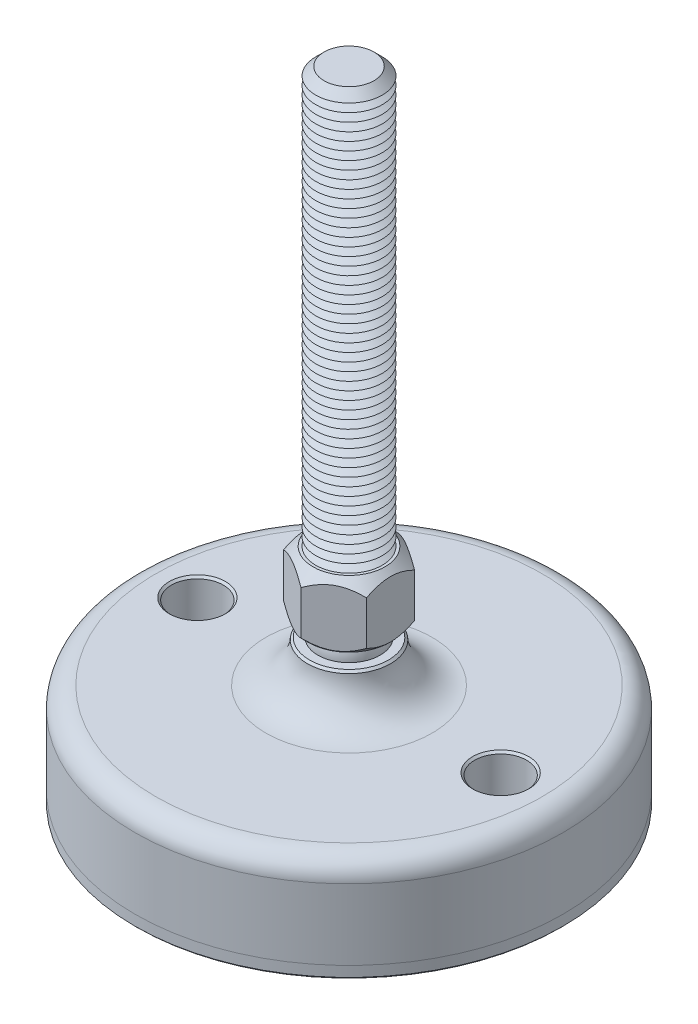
ISO-10303-21;
HEADER;
FILE_DESCRIPTION(('STEP AP214'),'2;1');
FILE_NAME('part.step','',(''),(''),'','','');
FILE_SCHEMA(('AUTOMOTIVE_DESIGN { 1 0 10303 214 1 1 1 1 }'));
ENDSEC;
DATA;
#1=APPLICATION_CONTEXT('core data for automotive mechanical design processes');
#2=APPLICATION_PROTOCOL_DEFINITION('international standard','automotive_design',2000,#1);
#3=PRODUCT_CONTEXT('',#1,'mechanical');
#4=PRODUCT('Part','Part','',(#3));
#5=PRODUCT_RELATED_PRODUCT_CATEGORY('part','',(#4));
#6=PRODUCT_DEFINITION_FORMATION('','',#4);
#7=PRODUCT_DEFINITION_CONTEXT('part definition',#1,'design');
#8=PRODUCT_DEFINITION('design','',#6,#7);
#9=PRODUCT_DEFINITION_SHAPE('','',#8);
#10=(LENGTH_UNIT() NAMED_UNIT(*) SI_UNIT(.MILLI.,.METRE.));
#11=(NAMED_UNIT(*) PLANE_ANGLE_UNIT() SI_UNIT($,.RADIAN.));
#12=(NAMED_UNIT(*) SI_UNIT($,.STERADIAN.) SOLID_ANGLE_UNIT());
#13=UNCERTAINTY_MEASURE_WITH_UNIT(LENGTH_MEASURE(1.E-05),#10,'distance_accuracy_value','');
#14=(GEOMETRIC_REPRESENTATION_CONTEXT(3) GLOBAL_UNCERTAINTY_ASSIGNED_CONTEXT((#13)) GLOBAL_UNIT_ASSIGNED_CONTEXT((#10,
#11,#12)) REPRESENTATION_CONTEXT('',''));
#15=CARTESIAN_POINT('',(0.,0.,0.));
#16=DIRECTION('',(0.,0.,1.));
#17=DIRECTION('',(1.,0.,0.));
#18=AXIS2_PLACEMENT_3D('',#15,#16,#17);
#19=CARTESIAN_POINT('',(0.,-32.,0.));
#20=DIRECTION('',(0.,1.,0.));
#21=DIRECTION('',(0.,0.,1.));
#22=AXIS2_PLACEMENT_3D('',#19,#20,#21);
#23=PLANE('',#22);
#24=CARTESIAN_POINT('',(-36.5,-32.,0.));
#25=DIRECTION('',(0.,1.,0.));
#26=DIRECTION('',(0.,0.,1.));
#27=AXIS2_PLACEMENT_3D('',#24,#25,#26);
#28=CIRCLE('',#27,6.25);
#29=CARTESIAN_POINT('',(-36.5,-32.,6.25));
#30=VERTEX_POINT('',#29);
#31=EDGE_CURVE('P0_E43',#30,#30,#28,.T.);
#32=ORIENTED_EDGE('',*,*,#31,.F.);
#33=EDGE_LOOP('',(#32));
#34=FACE_BOUND('',#33,.T.);
#35=CARTESIAN_POINT('',(36.5,-32.,0.));
#36=DIRECTION('',(0.,1.,0.));
#37=DIRECTION('',(0.,0.,1.));
#38=AXIS2_PLACEMENT_3D('',#35,#36,#37);
#39=CIRCLE('',#38,6.25);
#40=CARTESIAN_POINT('',(36.5,-32.,6.25));
#41=VERTEX_POINT('',#40);
#42=EDGE_CURVE('P0_E44',#41,#41,#39,.T.);
#43=ORIENTED_EDGE('',*,*,#42,.F.);
#44=EDGE_LOOP('',(#43));
#45=FACE_BOUND('',#44,.T.);
#46=CARTESIAN_POINT('',(0.,-32.,0.));
#47=DIRECTION('',(0.,1.,0.));
#48=DIRECTION('',(0.,0.,1.));
#49=AXIS2_PLACEMENT_3D('',#46,#47,#48);
#50=CIRCLE('',#49,51.5);
#51=CARTESIAN_POINT('',(0.,-32.,51.5));
#52=VERTEX_POINT('',#51);
#53=EDGE_CURVE('P0_E40',#52,#52,#50,.T.);
#54=ORIENTED_EDGE('',*,*,#53,.T.);
#55=EDGE_LOOP('',(#54));
#56=FACE_BOUND('',#55,.T.);
#57=ADVANCED_FACE('P0_F14',(#34,#45,#56),#23,.T.);
#58=CARTESIAN_POINT('',(0.,43.1654938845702,0.));
#59=DIRECTION('',(0.,1.,0.));
#60=DIRECTION('',(0.,0.,1.));
#61=AXIS2_PLACEMENT_3D('',#58,#59,#60);
#62=CYLINDRICAL_SURFACE('',#61,51.5);
#63=CARTESIAN_POINT('',(0.,-34.5,0.));
#64=DIRECTION('',(0.,-1.,0.));
#65=DIRECTION('',(0.,0.,-1.));
#66=AXIS2_PLACEMENT_3D('',#63,#64,#65);
#67=CIRCLE('',#66,51.5);
#68=CARTESIAN_POINT('',(0.,-34.5,-51.5));
#69=VERTEX_POINT('',#68);
#70=EDGE_CURVE('P0_E37',#69,#69,#67,.F.);
#71=ORIENTED_EDGE('',*,*,#70,.T.);
#72=EDGE_LOOP('',(#71));
#73=FACE_BOUND('',#72,.T.);
#74=ORIENTED_EDGE('',*,*,#53,.F.);
#75=EDGE_LOOP('',(#74));
#76=FACE_BOUND('',#75,.T.);
#77=ADVANCED_FACE('P0_F54',(#73,#76),#62,.T.);
#78=CARTESIAN_POINT('',(0.,-35.,51.5));
#79=DIRECTION('',(0.,-1.,0.));
#80=DIRECTION('',(0.,0.,-1.));
#81=AXIS2_PLACEMENT_3D('',#78,#79,#80);
#82=PLANE('',#81);
#83=CARTESIAN_POINT('',(36.5,-35.,0.));
#84=DIRECTION('',(0.,-1.,0.));
#85=DIRECTION('',(0.,0.,-1.));
#86=AXIS2_PLACEMENT_3D('',#83,#84,#85);
#87=CIRCLE('',#86,6.75000000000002);
#88=CARTESIAN_POINT('',(36.5,-35.,-6.75000000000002));
#89=VERTEX_POINT('',#88);
#90=EDGE_CURVE('P0_E25',#89,#89,#87,.F.);
#91=ORIENTED_EDGE('',*,*,#90,.T.);
#92=EDGE_LOOP('',(#91));
#93=FACE_BOUND('',#92,.T.);
#94=CARTESIAN_POINT('',(-36.5,-35.,0.));
#95=DIRECTION('',(0.,-1.,0.));
#96=DIRECTION('',(0.,0.,-1.));
#97=AXIS2_PLACEMENT_3D('',#94,#95,#96);
#98=CIRCLE('',#97,6.74999999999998);
#99=CARTESIAN_POINT('',(-36.5,-35.,-6.74999999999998));
#100=VERTEX_POINT('',#99);
#101=EDGE_CURVE('P0_E29',#100,#100,#98,.F.);
#102=ORIENTED_EDGE('',*,*,#101,.T.);
#103=EDGE_LOOP('',(#102));
#104=FACE_BOUND('',#103,.T.);
#105=CARTESIAN_POINT('',(0.,-35.,0.));
#106=DIRECTION('',(0.,-1.,0.));
#107=DIRECTION('',(0.,0.,-1.));
#108=AXIS2_PLACEMENT_3D('',#105,#106,#107);
#109=CIRCLE('',#108,51.);
#110=CARTESIAN_POINT('',(0.,-35.,-51.));
#111=VERTEX_POINT('',#110);
#112=EDGE_CURVE('P0_E34',#111,#111,#109,.T.);
#113=ORIENTED_EDGE('',*,*,#112,.T.);
#114=EDGE_LOOP('',(#113));
#115=FACE_BOUND('',#114,.T.);
#116=ADVANCED_FACE('P0_F61',(#93,#104,#115),#82,.T.);
#117=CARTESIAN_POINT('',(0.,-34.5,0.));
#118=DIRECTION('',(0.,1.,0.));
#119=DIRECTION('',(0.,0.,1.));
#120=AXIS2_PLACEMENT_3D('',#117,#118,#119);
#121=CONICAL_SURFACE('',#120,51.5,0.785398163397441);
#122=ORIENTED_EDGE('',*,*,#112,.F.);
#123=EDGE_LOOP('',(#122));
#124=FACE_BOUND('',#123,.T.);
#125=ORIENTED_EDGE('',*,*,#70,.F.);
#126=EDGE_LOOP('',(#125));
#127=FACE_BOUND('',#126,.T.);
#128=ADVANCED_FACE('P0_F68',(#124,#127),#121,.T.);
#129=CARTESIAN_POINT('',(36.5,-35.,0.));
#130=DIRECTION('',(0.,1.,0.));
#131=DIRECTION('',(0.,0.,1.));
#132=AXIS2_PLACEMENT_3D('',#129,#130,#131);
#133=CYLINDRICAL_SURFACE('',#132,6.25);
#134=CARTESIAN_POINT('',(36.5,-34.5,0.));
#135=DIRECTION('',(0.,-1.,0.));
#136=DIRECTION('',(0.,0.,-1.));
#137=AXIS2_PLACEMENT_3D('',#134,#135,#136);
#138=CIRCLE('',#137,6.25);
#139=CARTESIAN_POINT('',(36.5,-34.5,-6.25));
#140=VERTEX_POINT('',#139);
#141=EDGE_CURVE('P0_E21',#140,#140,#138,.T.);
#142=ORIENTED_EDGE('',*,*,#141,.T.);
#143=EDGE_LOOP('',(#142));
#144=FACE_BOUND('',#143,.T.);
#145=ORIENTED_EDGE('',*,*,#42,.T.);
#146=EDGE_LOOP('',(#145));
#147=FACE_BOUND('',#146,.T.);
#148=ADVANCED_FACE('P0_F74',(#144,#147),#133,.F.);
#149=CARTESIAN_POINT('',(-36.5,-35.,0.));
#150=DIRECTION('',(0.,1.,0.));
#151=DIRECTION('',(0.,0.,1.));
#152=AXIS2_PLACEMENT_3D('',#149,#150,#151);
#153=CYLINDRICAL_SURFACE('',#152,6.25);
#154=CARTESIAN_POINT('',(-36.5,-34.5,0.));
#155=DIRECTION('',(0.,-1.,0.));
#156=DIRECTION('',(0.,0.,-1.));
#157=AXIS2_PLACEMENT_3D('',#154,#155,#156);
#158=CIRCLE('',#157,6.25);
#159=CARTESIAN_POINT('',(-36.5,-34.5,-6.25));
#160=VERTEX_POINT('',#159);
#161=EDGE_CURVE('P0_E10',#160,#160,#158,.T.);
#162=ORIENTED_EDGE('',*,*,#161,.T.);
#163=EDGE_LOOP('',(#162));
#164=FACE_BOUND('',#163,.T.);
#165=ORIENTED_EDGE('',*,*,#31,.T.);
#166=EDGE_LOOP('',(#165));
#167=FACE_BOUND('',#166,.T.);
#168=ADVANCED_FACE('P0_F50',(#164,#167),#153,.F.);
#169=CARTESIAN_POINT('',(36.5,-35.,0.));
#170=DIRECTION('',(0.,-1.,0.));
#171=DIRECTION('',(0.,0.,-1.));
#172=AXIS2_PLACEMENT_3D('',#169,#170,#171);
#173=CONICAL_SURFACE('',#172,6.75000000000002,0.785398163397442);
#174=ORIENTED_EDGE('',*,*,#141,.F.);
#175=EDGE_LOOP('',(#174));
#176=FACE_BOUND('',#175,.T.);
#177=ORIENTED_EDGE('',*,*,#90,.F.);
#178=EDGE_LOOP('',(#177));
#179=FACE_BOUND('',#178,.T.);
#180=ADVANCED_FACE('P0_F76',(#176,#179),#173,.F.);
#181=CARTESIAN_POINT('',(-36.5,-35.,0.));
#182=DIRECTION('',(0.,-1.,0.));
#183=DIRECTION('',(0.,0.,-1.));
#184=AXIS2_PLACEMENT_3D('',#181,#182,#183);
#185=CONICAL_SURFACE('',#184,6.74999999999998,0.785398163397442);
#186=ORIENTED_EDGE('',*,*,#161,.F.);
#187=EDGE_LOOP('',(#186));
#188=FACE_BOUND('',#187,.T.);
#189=ORIENTED_EDGE('',*,*,#101,.F.);
#190=EDGE_LOOP('',(#189));
#191=FACE_BOUND('',#190,.T.);
#192=ADVANCED_FACE('P0_F16',(#188,#191),#185,.F.);
#193=CLOSED_SHELL('',(#57,#77,#116,#128,#148,#168,#180,#192));
#194=MANIFOLD_SOLID_BREP('P0_B1',#193);
#195=CARTESIAN_POINT('',(0.,3.75,0.));
#196=DIRECTION('',(0.,1.,0.));
#197=DIRECTION('',(0.,0.,1.));
#198=AXIS2_PLACEMENT_3D('',#195,#196,#197);
#199=PLANE('',#198);
#200=CARTESIAN_POINT('',(0.,3.75,0.));
#201=DIRECTION('',(0.,1.,0.));
#202=DIRECTION('',(0.,0.,1.));
#203=AXIS2_PLACEMENT_3D('',#200,#201,#202);
#204=CIRCLE('',#203,9.72829454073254);
#205=CARTESIAN_POINT('',(0.,3.75,9.72829454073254));
#206=VERTEX_POINT('',#205);
#207=EDGE_CURVE('P1_E221',#206,#206,#204,.T.);
#208=ORIENTED_EDGE('',*,*,#207,.F.);
#209=EDGE_LOOP('',(#208));
#210=FACE_BOUND('',#209,.T.);
#211=CARTESIAN_POINT('',(0.,3.75,0.));
#212=DIRECTION('',(0.,1.,0.));
#213=DIRECTION('',(0.,0.,1.));
#214=AXIS2_PLACEMENT_3D('',#211,#212,#213);
#215=CIRCLE('',#214,6.49519052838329);
#216=CARTESIAN_POINT('',(0.,3.75,6.49519052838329));
#217=VERTEX_POINT('',#216);
#218=EDGE_CURVE('P1_E24',#217,#217,#215,.F.);
#219=ORIENTED_EDGE('',*,*,#218,.F.);
#220=EDGE_LOOP('',(#219));
#221=FACE_BOUND('',#220,.T.);
#222=ADVANCED_FACE('P1_F16',(#210,#221),#199,.F.);
#223=CARTESIAN_POINT('',(0.,0.,0.));
#224=DIRECTION('',(0.,1.,0.));
#225=DIRECTION('',(0.,0.,-1.));
#226=AXIS2_PLACEMENT_3D('',#223,#224,#225);
#227=SPHERICAL_SURFACE('',#226,7.5);
#228=ORIENTED_EDGE('',*,*,#218,.T.);
#229=EDGE_LOOP('',(#228));
#230=FACE_BOUND('',#229,.T.);
#231=ADVANCED_FACE('P1_F203',(#230),#227,.T.);
#232=CARTESIAN_POINT('',(0.,3.75,0.));
#233=DIRECTION('',(0.,1.,0.));
#234=DIRECTION('',(0.,0.,1.));
#235=AXIS2_PLACEMENT_3D('',#232,#233,#234);
#236=CONICAL_SURFACE('',#235,9.72829454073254,0.785398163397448);
#237=ORIENTED_EDGE('',*,*,#207,.T.);
#238=EDGE_LOOP('',(#237));
#239=FACE_BOUND('',#238,.T.);
#240=CARTESIAN_POINT('',(-10.,9.59571642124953,-11.9394228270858));
#241=CARTESIAN_POINT('',(-10.,9.37430561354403,-11.6505452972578));
#242=CARTESIAN_POINT('',(-10.,9.15490936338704,-11.3600988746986));
#243=CARTESIAN_POINT('',(-10.,8.72106267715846,-10.7754314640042));
#244=CARTESIAN_POINT('',(-10.,8.50661343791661,-10.4812095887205));
#245=CARTESIAN_POINT('',(-10.,8.08205114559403,-9.88620330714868));
#246=CARTESIAN_POINT('',(-10.,7.87198437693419,-9.58538576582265));
#247=CARTESIAN_POINT('',(-10.,7.45926520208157,-8.97872312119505));
#248=CARTESIAN_POINT('',(-10.,7.25661228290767,-8.67287836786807));
#249=CARTESIAN_POINT('',(-10.,6.84809543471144,-8.03614350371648));
#250=CARTESIAN_POINT('',(-10.,6.64281401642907,-7.70487777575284));
#251=CARTESIAN_POINT('',(-10.,6.245142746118,-7.03457466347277));
#252=CARTESIAN_POINT('',(-10.,6.0527550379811,-6.69553599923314));
#253=CARTESIAN_POINT('',(-10.,5.68497951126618,-6.00961937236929));
#254=CARTESIAN_POINT('',(-10.,5.50954176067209,-5.66276839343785));
#255=CARTESIAN_POINT('',(-10.,5.17959635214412,-4.95932933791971));
#256=CARTESIAN_POINT('',(-10.,5.02507889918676,-4.60274591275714));
#257=CARTESIAN_POINT('',(-10.,4.75599518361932,-3.91353381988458));
#258=CARTESIAN_POINT('',(-10.,4.63902686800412,-3.58185263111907));
#259=CARTESIAN_POINT('',(-10.,4.43164927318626,-2.91013341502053));
#260=CARTESIAN_POINT('',(-10.,4.34124171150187,-2.57009484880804));
#261=CARTESIAN_POINT('',(-10.,4.19334931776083,-1.88955843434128));
#262=CARTESIAN_POINT('',(-10.,4.13527351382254,-1.54919119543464));
#263=CARTESIAN_POINT('',(-10.,4.05324021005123,-0.864347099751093));
#264=CARTESIAN_POINT('',(-10.,4.029275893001,-0.519871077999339));
#265=CARTESIAN_POINT('',(-10.,4.01745435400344,0.155191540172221));
#266=CARTESIAN_POINT('',(-10.,4.02812008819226,0.485752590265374));
#267=CARTESIAN_POINT('',(-10.,4.08160326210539,1.1442457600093));
#268=CARTESIAN_POINT('',(-10.,4.12442366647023,1.47217763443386));
#269=CARTESIAN_POINT('',(-10.,4.24054019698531,2.12859326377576));
#270=CARTESIAN_POINT('',(-10.,4.31437036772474,2.45698095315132));
#271=CARTESIAN_POINT('',(-10.,4.48844287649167,3.10654175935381));
#272=CARTESIAN_POINT('',(-10.,4.58868356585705,3.42771532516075));
#273=CARTESIAN_POINT('',(-10.,4.81839210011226,4.08271396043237));
#274=CARTESIAN_POINT('',(-10.,4.94932842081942,4.41601827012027));
#275=CARTESIAN_POINT('',(-10.,5.23140828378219,5.07403931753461));
#276=CARTESIAN_POINT('',(-10.,5.38256099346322,5.3987520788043));
#277=CARTESIAN_POINT('',(-10.,5.70148727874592,6.04113299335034));
#278=CARTESIAN_POINT('',(-10.,5.86931223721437,6.35877542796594));
#279=CARTESIAN_POINT('',(-10.,6.21788686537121,6.98677627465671));
#280=CARTESIAN_POINT('',(-10.,6.39863453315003,7.29713580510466));
#281=CARTESIAN_POINT('',(-10.,6.76133545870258,7.89633938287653));
#282=CARTESIAN_POINT('',(-10.,6.94278731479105,8.18548854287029));
#283=CARTESIAN_POINT('',(-10.,7.31339871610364,8.75881961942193));
#284=CARTESIAN_POINT('',(-10.,7.50255884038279,9.04300116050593));
#285=CARTESIAN_POINT('',(-10.,7.8856676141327,9.6047584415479));
#286=CARTESIAN_POINT('',(-10.,8.07956548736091,9.88236893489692));
#287=CARTESIAN_POINT('',(-10.,8.47254700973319,10.4337838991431));
#288=CARTESIAN_POINT('',(-10.,8.67162921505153,10.7075893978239));
#289=CARTESIAN_POINT('',(-10.,8.87283307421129,10.9797992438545));
#290=B_SPLINE_CURVE_WITH_KNOTS('',3,(#240,#241,#242,#243,#244,#245,#246,#247,#248,#249,#250,
#251,#252,#253,#254,#255,#256,#257,#258,#259,#260,#261,#262,#263,#264,#265,#266,#267,#268,#269,
#270,#271,#272,#273,#274,#275,#276,#277,#278,#279,#280,#281,#282,#283,#284,#285,#286,#287,#288,
#289),.UNSPECIFIED.,.F.,.F.,(4,2,2,2,2,2,2,2,2,2,2,2,2,2,2,2,2,2,2,2,2,2,2,2,4),(0.,
1.09192545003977,2.18411235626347,3.28473497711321,4.3852812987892,5.5541916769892,
6.72329593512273,7.88884387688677,9.05384420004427,10.1080362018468,11.1622963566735,
12.1965943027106,13.2306855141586,14.2212593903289,15.2119246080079,16.2203997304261,
17.2288119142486,18.3022883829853,19.3762532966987,20.4536373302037,21.5308548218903,
22.5548150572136,23.5788523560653,24.5946500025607,25.6101677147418),.UNSPECIFIED.);
#291=CARTESIAN_POINT('',(-10.,5.56871084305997,-5.77350269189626));
#292=VERTEX_POINT('',#291);
#293=CARTESIAN_POINT('',(-10.,5.56871084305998,5.77350269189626));
#294=VERTEX_POINT('',#293);
#295=EDGE_CURVE('P1_E186',#292,#294,#290,.T.);
#296=ORIENTED_EDGE('',*,*,#295,.F.);
#297=CARTESIAN_POINT('',(0.000199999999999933,5.56882631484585,-11.5471208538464));
#298=CARTESIAN_POINT('',(-0.171722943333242,5.4695807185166,-11.447861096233));
#299=CARTESIAN_POINT('',(-0.344992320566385,5.37336355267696,-11.3478239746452));
#300=CARTESIAN_POINT('',(-0.694433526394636,5.18794806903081,-11.1460740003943));
#301=CARTESIAN_POINT('',(-0.870606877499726,5.09875358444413,-11.0443602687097));
#302=CARTESIAN_POINT('',(-1.22689656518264,4.92796770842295,-10.8386563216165));
#303=CARTESIAN_POINT('',(-1.40702970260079,4.84642277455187,-10.7346564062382));
#304=CARTESIAN_POINT('',(-1.77025459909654,4.69270708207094,-10.52494841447));
#305=CARTESIAN_POINT('',(-1.95334590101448,4.62053489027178,-10.4192406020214));
#306=CARTESIAN_POINT('',(-2.31954331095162,4.4878482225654,-10.2078164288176));
#307=CARTESIAN_POINT('',(-2.50260441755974,4.42716910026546,-10.1021260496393));
#308=CARTESIAN_POINT('',(-2.87129282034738,4.31731511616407,-9.88926370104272));
#309=CARTESIAN_POINT('',(-3.05691983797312,4.26813901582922,-9.78209189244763));
#310=CARTESIAN_POINT('',(-3.42994608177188,4.1825291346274,-9.56672509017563));
#311=CARTESIAN_POINT('',(-3.61734032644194,4.14606667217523,-9.45853297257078));
#312=CARTESIAN_POINT('',(-3.99370204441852,4.08668528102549,-9.24124043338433));
#313=CARTESIAN_POINT('',(-4.1826692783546,4.06376432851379,-9.13214015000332));
#314=CARTESIAN_POINT('',(-4.64316633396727,4.0253323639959,-8.86627205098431));
#315=CARTESIAN_POINT('',(-4.91519388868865,4.01726744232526,-8.70921686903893));
#316=CARTESIAN_POINT('',(-5.45875701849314,4.03080424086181,-8.39539054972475));
#317=CARTESIAN_POINT('',(-5.7302923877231,4.05241636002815,-8.23861953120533));
#318=CARTESIAN_POINT('',(-6.27080349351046,4.12403157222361,-7.92655529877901));
#319=CARTESIAN_POINT('',(-6.53977602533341,4.17406641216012,-7.77126393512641));
#320=CARTESIAN_POINT('',(-7.07309796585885,4.29980733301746,-7.46335036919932));
#321=CARTESIAN_POINT('',(-7.33744772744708,4.3755114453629,-7.31072796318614));
#322=CARTESIAN_POINT('',(-7.80670351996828,4.53125365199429,-7.03980300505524));
#323=CARTESIAN_POINT('',(-8.01264886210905,4.60719488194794,-6.92090040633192));
#324=CARTESIAN_POINT('',(-8.42084280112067,4.77131434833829,-6.68522952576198));
#325=CARTESIAN_POINT('',(-8.62309128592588,4.85949295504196,-6.5684613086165));
#326=CARTESIAN_POINT('',(-9.02325448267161,5.04611070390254,-6.33742697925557));
#327=CARTESIAN_POINT('',(-9.22118057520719,5.1445175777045,-6.2231542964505));
#328=CARTESIAN_POINT('',(-9.61336795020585,5.35030005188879,-5.99672480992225));
#329=CARTESIAN_POINT('',(-9.80763139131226,5.45767015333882,-5.88456675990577));
#330=CARTESIAN_POINT('',(-10.0002,5.56882631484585,-5.77338722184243));
#331=B_SPLINE_CURVE_WITH_KNOTS('',3,(#297,#298,#299,#300,#301,#302,#303,#304,#305,#306,#307,
#308,#309,#310,#311,#312,#313,#314,#315,#316,#317,#318,#319,#320,#321,#322,#323,#324,#325,#326,
#327,#328,#329,#330),.UNSPECIFIED.,.F.,.F.,(4,2,2,2,2,2,2,2,2,2,2,2,2,2,2,2,4),(0.,
0.665863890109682,1.33208874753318,2.00212824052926,2.67206515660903,3.33152613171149,
3.99091606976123,4.64880867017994,5.30660292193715,6.24777541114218,7.18927777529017,
8.13183382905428,9.07431761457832,9.82287578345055,10.5714566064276,11.3177436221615,
12.0635761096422),.UNSPECIFIED.);
#332=CARTESIAN_POINT('',(0.,5.56871084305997,-11.5470053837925));
#333=VERTEX_POINT('',#332);
#334=EDGE_CURVE('P1_E180',#333,#292,#331,.T.);
#335=ORIENTED_EDGE('',*,*,#334,.F.);
#336=CARTESIAN_POINT('',(10.0002,5.56882631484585,-5.77338722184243));
#337=CARTESIAN_POINT('',(9.82827705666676,5.4695807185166,-5.87264697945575));
#338=CARTESIAN_POINT('',(9.65500767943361,5.37336355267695,-5.97268410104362));
#339=CARTESIAN_POINT('',(9.30556647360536,5.18794806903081,-6.17443407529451));
#340=CARTESIAN_POINT('',(9.12939312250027,5.09875358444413,-6.27614780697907));
#341=CARTESIAN_POINT('',(8.77310343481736,4.92796770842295,-6.48185175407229));
#342=CARTESIAN_POINT('',(8.59297029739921,4.84642277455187,-6.58585166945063));
#343=CARTESIAN_POINT('',(8.22974540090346,4.69270708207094,-6.79555966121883));
#344=CARTESIAN_POINT('',(8.04665409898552,4.62053489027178,-6.90126747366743));
#345=CARTESIAN_POINT('',(7.68045668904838,4.4878482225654,-7.11269164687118));
#346=CARTESIAN_POINT('',(7.49739558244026,4.42716910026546,-7.21838202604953));
#347=CARTESIAN_POINT('',(7.12870717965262,4.31731511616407,-7.43124437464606));
#348=CARTESIAN_POINT('',(6.94308016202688,4.26813901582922,-7.53841618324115));
#349=CARTESIAN_POINT('',(6.57005391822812,4.1825291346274,-7.75378298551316));
#350=CARTESIAN_POINT('',(6.38265967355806,4.14606667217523,-7.861975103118));
#351=CARTESIAN_POINT('',(6.00629795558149,4.08668528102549,-8.07926764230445));
#352=CARTESIAN_POINT('',(5.81733072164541,4.06376432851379,-8.18836792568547));
#353=CARTESIAN_POINT('',(5.35683366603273,4.0253323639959,-8.45423602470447));
#354=CARTESIAN_POINT('',(5.08480611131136,4.01726744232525,-8.61129120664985));
#355=CARTESIAN_POINT('',(4.54124298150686,4.03080424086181,-8.92511752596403));
#356=CARTESIAN_POINT('',(4.2697076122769,4.05241636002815,-9.08188854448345));
#357=CARTESIAN_POINT('',(3.72919650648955,4.12403157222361,-9.39395277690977));
#358=CARTESIAN_POINT('',(3.46022397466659,4.17406641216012,-9.54924414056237));
#359=CARTESIAN_POINT('',(2.92690203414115,4.29980733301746,-9.85715770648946));
#360=CARTESIAN_POINT('',(2.66255227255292,4.37551144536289,-10.0097801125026));
#361=CARTESIAN_POINT('',(2.19329648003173,4.53125365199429,-10.2807050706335));
#362=CARTESIAN_POINT('',(1.98735113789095,4.60719488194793,-10.3996076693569));
#363=CARTESIAN_POINT('',(1.57915719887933,4.77131434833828,-10.6352785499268));
#364=CARTESIAN_POINT('',(1.37690871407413,4.85949295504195,-10.7520467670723));
#365=CARTESIAN_POINT('',(0.976745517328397,5.04611070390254,-10.9830810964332));
#366=CARTESIAN_POINT('',(0.77881942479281,5.1445175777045,-11.0973537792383));
#367=CARTESIAN_POINT('',(0.386632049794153,5.35030005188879,-11.3237832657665));
#368=CARTESIAN_POINT('',(0.192368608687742,5.45767015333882,-11.435941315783));
#369=CARTESIAN_POINT('',(-0.000199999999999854,5.56882631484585,-11.5471208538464));
#370=B_SPLINE_CURVE_WITH_KNOTS('',3,(#336,#337,#338,#339,#340,#341,#342,#343,#344,#345,#346,
#347,#348,#349,#350,#351,#352,#353,#354,#355,#356,#357,#358,#359,#360,#361,#362,#363,#364,#365,
#366,#367,#368,#369),.UNSPECIFIED.,.F.,.F.,(4,2,2,2,2,2,2,2,2,2,2,2,2,2,2,2,4),(0.,
0.665863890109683,1.33208874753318,2.00212824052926,2.67206515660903,3.33152613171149,
3.99091606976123,4.64880867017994,5.30660292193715,6.24777541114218,7.18927777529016,
8.13183382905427,9.07431761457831,9.82287578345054,10.5714566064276,11.3177436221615,
12.0635761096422),.UNSPECIFIED.);
#371=CARTESIAN_POINT('',(9.99999999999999,5.56871084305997,-5.77350269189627));
#372=VERTEX_POINT('',#371);
#373=EDGE_CURVE('P1_E168',#372,#333,#370,.T.);
#374=ORIENTED_EDGE('',*,*,#373,.F.);
#375=CARTESIAN_POINT('',(10.,9.59571642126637,-11.9394228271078));
#376=CARTESIAN_POINT('',(10.,9.37430561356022,-11.6505452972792));
#377=CARTESIAN_POINT('',(10.,9.15490936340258,-11.3600988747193));
#378=CARTESIAN_POINT('',(10.,8.7210626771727,-10.7754314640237));
#379=CARTESIAN_POINT('',(10.,8.5066134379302,-10.4812095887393));
#380=CARTESIAN_POINT('',(10.,8.08205114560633,-9.88620330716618));
#381=CARTESIAN_POINT('',(10.,7.87198437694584,-9.58538576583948));
#382=CARTESIAN_POINT('',(10.,7.45926520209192,-8.97872312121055));
#383=CARTESIAN_POINT('',(10.,7.25661228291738,-8.67287836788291));
#384=CARTESIAN_POINT('',(10.,6.84809543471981,-8.03614350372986));
#385=CARTESIAN_POINT('',(10.,6.64281401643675,-7.70487777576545));
#386=CARTESIAN_POINT('',(10.,6.24514274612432,-7.03457466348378));
#387=CARTESIAN_POINT('',(10.,6.05275503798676,-6.69553599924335));
#388=CARTESIAN_POINT('',(10.,5.68497951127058,-6.00961937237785));
#389=CARTESIAN_POINT('',(10.,5.50954176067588,-5.66276839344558));
#390=CARTESIAN_POINT('',(10.,5.17959635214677,-4.95932933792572));
#391=CARTESIAN_POINT('',(10.,5.02507889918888,-4.60274591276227));
#392=CARTESIAN_POINT('',(10.,4.75599518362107,-3.91353381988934));
#393=CARTESIAN_POINT('',(10.,4.63902686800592,-3.58185263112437));
#394=CARTESIAN_POINT('',(10.,4.43164927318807,-2.91013341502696));
#395=CARTESIAN_POINT('',(10.,4.34124171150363,-2.57009484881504));
#396=CARTESIAN_POINT('',(10.,4.19334931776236,-1.8895584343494));
#397=CARTESIAN_POINT('',(10.,4.13527351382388,-1.54919119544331));
#398=CARTESIAN_POINT('',(10.,4.05324021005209,-0.86434709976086));
#399=CARTESIAN_POINT('',(10.,4.02927589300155,-0.519871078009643));
#400=CARTESIAN_POINT('',(10.,4.01745435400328,0.155191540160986));
#401=CARTESIAN_POINT('',(10.,4.0281200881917,0.485752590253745));
#402=CARTESIAN_POINT('',(10.,4.08160326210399,1.14424575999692));
#403=CARTESIAN_POINT('',(10.,4.12442366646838,1.47217763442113));
#404=CARTESIAN_POINT('',(10.,4.24054019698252,2.12859326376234));
#405=CARTESIAN_POINT('',(10.,4.31437036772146,2.45698095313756));
#406=CARTESIAN_POINT('',(10.,4.48844287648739,3.1065417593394));
#407=CARTESIAN_POINT('',(10.,4.58868356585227,3.42771532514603));
#408=CARTESIAN_POINT('',(10.,4.81839210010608,4.08271396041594));
#409=CARTESIAN_POINT('',(10.,4.94932842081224,4.41601827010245));
#410=CARTESIAN_POINT('',(10.,5.23140828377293,5.0740393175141));
#411=CARTESIAN_POINT('',(10.,5.38256099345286,5.39875207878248));
#412=CARTESIAN_POINT('',(10.,5.70148727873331,6.04113299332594));
#413=CARTESIAN_POINT('',(10.,5.86931223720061,6.35877542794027));
#414=CARTESIAN_POINT('',(10.,6.21788686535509,6.98677627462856));
#415=CARTESIAN_POINT('',(10.,6.39863453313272,7.29713580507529));
#416=CARTESIAN_POINT('',(10.,6.761335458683,7.89633938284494));
#417=CARTESIAN_POINT('',(10.,6.9427873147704,8.18548854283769));
#418=CARTESIAN_POINT('',(10.,7.31339871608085,8.75881961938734));
#419=CARTESIAN_POINT('',(10.,7.50255884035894,9.04300116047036));
#420=CARTESIAN_POINT('',(10.,7.88566761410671,9.60475844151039));
#421=CARTESIAN_POINT('',(10.,8.07956548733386,9.88236893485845));
#422=CARTESIAN_POINT('',(10.,8.47254700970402,10.4337838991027));
#423=CARTESIAN_POINT('',(10.,8.6716292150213,10.7075893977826));
#424=CARTESIAN_POINT('',(10.,8.87283307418,10.9797992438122));
#425=B_SPLINE_CURVE_WITH_KNOTS('',3,(#375,#376,#377,#378,#379,#380,#381,#382,#383,#384,#385,
#386,#387,#388,#389,#390,#391,#392,#393,#394,#395,#396,#397,#398,#399,#400,#401,#402,#403,#404,
#405,#406,#407,#408,#409,#410,#411,#412,#413,#414,#415,#416,#417,#418,#419,#420,#421,#422,#423,
#424),.UNSPECIFIED.,.F.,.F.,(4,2,2,2,2,2,2,2,2,2,2,2,2,2,2,2,2,2,2,2,2,2,2,2,4),(0.,
1.09192545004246,2.18411235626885,3.28473497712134,4.38528129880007,5.55419167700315,
6.72329593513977,7.88884387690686,9.05384420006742,10.1080362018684,11.1622963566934,
12.196594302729,13.2306855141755,14.2212593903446,15.2119246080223,16.2203997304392,
17.2288119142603,18.3022883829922,19.3762532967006,20.4536373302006,21.5308548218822,
22.5548150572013,23.5788523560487,24.5946500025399,25.6101677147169),.UNSPECIFIED.);
#426=CARTESIAN_POINT('',(10.,5.56871084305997,5.77350269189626));
#427=VERTEX_POINT('',#426);
#428=EDGE_CURVE('P1_E70',#427,#372,#425,.F.);
#429=ORIENTED_EDGE('',*,*,#428,.F.);
#430=CARTESIAN_POINT('',(-0.000200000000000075,5.56882631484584,11.5471208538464));
#431=CARTESIAN_POINT('',(0.171722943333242,5.4695807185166,11.447861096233));
#432=CARTESIAN_POINT('',(0.344992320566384,5.37336355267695,11.3478239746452));
#433=CARTESIAN_POINT('',(0.694433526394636,5.18794806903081,11.1460740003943));
#434=CARTESIAN_POINT('',(0.870606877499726,5.09875358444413,11.0443602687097));
#435=CARTESIAN_POINT('',(1.22689656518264,4.92796770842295,10.8386563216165));
#436=CARTESIAN_POINT('',(1.40702970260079,4.84642277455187,10.7346564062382));
#437=CARTESIAN_POINT('',(1.77025459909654,4.69270708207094,10.52494841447));
#438=CARTESIAN_POINT('',(1.95334590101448,4.62053489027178,10.4192406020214));
#439=CARTESIAN_POINT('',(2.31954331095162,4.4878482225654,10.2078164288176));
#440=CARTESIAN_POINT('',(2.50260441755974,4.42716910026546,10.1021260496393));
#441=CARTESIAN_POINT('',(2.87129282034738,4.31731511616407,9.88926370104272));
#442=CARTESIAN_POINT('',(3.05691983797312,4.26813901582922,9.78209189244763));
#443=CARTESIAN_POINT('',(3.42994608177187,4.18252913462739,9.56672509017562));
#444=CARTESIAN_POINT('',(3.61734032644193,4.14606667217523,9.45853297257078));
#445=CARTESIAN_POINT('',(3.99370204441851,4.08668528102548,9.24124043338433));
#446=CARTESIAN_POINT('',(4.18266927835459,4.06376432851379,9.13214015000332));
#447=CARTESIAN_POINT('',(4.64316633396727,4.0253323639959,8.86627205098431));
#448=CARTESIAN_POINT('',(4.91519388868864,4.01726744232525,8.70921686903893));
#449=CARTESIAN_POINT('',(5.45875701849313,4.03080424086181,8.39539054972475));
#450=CARTESIAN_POINT('',(5.7302923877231,4.05241636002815,8.23861953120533));
#451=CARTESIAN_POINT('',(6.27080349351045,4.1240315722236,7.92655529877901));
#452=CARTESIAN_POINT('',(6.53977602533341,4.17406641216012,7.77126393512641));
#453=CARTESIAN_POINT('',(7.07309796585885,4.29980733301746,7.46335036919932));
#454=CARTESIAN_POINT('',(7.33744772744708,4.37551144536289,7.31072796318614));
#455=CARTESIAN_POINT('',(7.80670351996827,4.53125365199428,7.03980300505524));
#456=CARTESIAN_POINT('',(8.01264886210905,4.60719488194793,6.92090040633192));
#457=CARTESIAN_POINT('',(8.42084280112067,4.77131434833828,6.68522952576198));
#458=CARTESIAN_POINT('',(8.62309128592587,4.85949295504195,6.5684613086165));
#459=CARTESIAN_POINT('',(9.0232544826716,5.04611070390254,6.33742697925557));
#460=CARTESIAN_POINT('',(9.22118057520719,5.1445175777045,6.2231542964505));
#461=CARTESIAN_POINT('',(9.61336795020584,5.35030005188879,5.99672480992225));
#462=CARTESIAN_POINT('',(9.80763139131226,5.45767015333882,5.88456675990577));
#463=CARTESIAN_POINT('',(10.0002,5.56882631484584,5.77338722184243));
#464=B_SPLINE_CURVE_WITH_KNOTS('',3,(#430,#431,#432,#433,#434,#435,#436,#437,#438,#439,#440,
#441,#442,#443,#444,#445,#446,#447,#448,#449,#450,#451,#452,#453,#454,#455,#456,#457,#458,#459,
#460,#461,#462,#463),.UNSPECIFIED.,.F.,.F.,(4,2,2,2,2,2,2,2,2,2,2,2,2,2,2,2,4),(0.,
0.665863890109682,1.33208874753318,2.00212824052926,2.67206515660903,3.33152613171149,
3.99091606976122,4.64880867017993,5.30660292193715,6.24777541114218,7.18927777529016,
8.13183382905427,9.07431761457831,9.82287578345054,10.5714566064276,11.3177436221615,
12.0635761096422),.UNSPECIFIED.);
#465=CARTESIAN_POINT('',(0.,5.56871084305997,11.5470053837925));
#466=VERTEX_POINT('',#465);
#467=EDGE_CURVE('P1_E67',#466,#427,#464,.T.);
#468=ORIENTED_EDGE('',*,*,#467,.F.);
#469=CARTESIAN_POINT('',(-10.0002,5.56882631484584,5.77338722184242));
#470=CARTESIAN_POINT('',(-9.82827705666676,5.4695807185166,5.87264697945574));
#471=CARTESIAN_POINT('',(-9.65500767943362,5.37336355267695,5.97268410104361));
#472=CARTESIAN_POINT('',(-9.30556647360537,5.18794806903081,6.1744340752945));
#473=CARTESIAN_POINT('',(-9.12939312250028,5.09875358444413,6.27614780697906));
#474=CARTESIAN_POINT('',(-8.77310343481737,4.92796770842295,6.48185175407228));
#475=CARTESIAN_POINT('',(-8.59297029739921,4.84642277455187,6.58585166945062));
#476=CARTESIAN_POINT('',(-8.22974540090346,4.69270708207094,6.79555966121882));
#477=CARTESIAN_POINT('',(-8.04665409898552,4.62053489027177,6.90126747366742));
#478=CARTESIAN_POINT('',(-7.68045668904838,4.48784822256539,7.11269164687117));
#479=CARTESIAN_POINT('',(-7.49739558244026,4.42716910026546,7.21838202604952));
#480=CARTESIAN_POINT('',(-7.12870717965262,4.31731511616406,7.43124437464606));
#481=CARTESIAN_POINT('',(-6.94308016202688,4.26813901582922,7.53841618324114));
#482=CARTESIAN_POINT('',(-6.57005391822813,4.18252913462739,7.75378298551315));
#483=CARTESIAN_POINT('',(-6.38265967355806,4.14606667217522,7.861975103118));
#484=CARTESIAN_POINT('',(-6.00629795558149,4.08668528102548,8.07926764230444));
#485=CARTESIAN_POINT('',(-5.81733072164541,4.06376432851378,8.18836792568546));
#486=CARTESIAN_POINT('',(-5.35683366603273,4.0253323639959,8.45423602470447));
#487=CARTESIAN_POINT('',(-5.08480611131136,4.01726744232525,8.61129120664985));
#488=CARTESIAN_POINT('',(-4.54124298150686,4.0308042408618,8.92511752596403));
#489=CARTESIAN_POINT('',(-4.2697076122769,4.05241636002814,9.08188854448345));
#490=CARTESIAN_POINT('',(-3.72919650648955,4.1240315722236,9.39395277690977));
#491=CARTESIAN_POINT('',(-3.46022397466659,4.17406641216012,9.54924414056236));
#492=CARTESIAN_POINT('',(-2.92690203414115,4.29980733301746,9.85715770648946));
#493=CARTESIAN_POINT('',(-2.66255227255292,4.37551144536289,10.0097801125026));
#494=CARTESIAN_POINT('',(-2.19329648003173,4.53125365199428,10.2807050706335));
#495=CARTESIAN_POINT('',(-1.98735113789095,4.60719488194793,10.3996076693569));
#496=CARTESIAN_POINT('',(-1.57915719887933,4.77131434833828,10.6352785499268));
#497=CARTESIAN_POINT('',(-1.37690871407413,4.85949295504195,10.7520467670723));
#498=CARTESIAN_POINT('',(-0.976745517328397,5.04611070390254,10.9830810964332));
#499=CARTESIAN_POINT('',(-0.778819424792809,5.1445175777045,11.0973537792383));
#500=CARTESIAN_POINT('',(-0.386632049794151,5.35030005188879,11.3237832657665));
#501=CARTESIAN_POINT('',(-0.192368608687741,5.45767015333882,11.435941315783));
#502=CARTESIAN_POINT('',(0.000199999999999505,5.56882631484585,11.5471208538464));
#503=B_SPLINE_CURVE_WITH_KNOTS('',3,(#469,#470,#471,#472,#473,#474,#475,#476,#477,#478,#479,
#480,#481,#482,#483,#484,#485,#486,#487,#488,#489,#490,#491,#492,#493,#494,#495,#496,#497,#498,
#499,#500,#501,#502),.UNSPECIFIED.,.F.,.F.,(4,2,2,2,2,2,2,2,2,2,2,2,2,2,2,2,4),(0.,
0.665863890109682,1.33208874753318,2.00212824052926,2.67206515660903,3.33152613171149,
3.99091606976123,4.64880867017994,5.30660292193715,6.24777541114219,7.18927777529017,
8.13183382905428,9.07431761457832,9.82287578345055,10.5714566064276,11.3177436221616,
12.0635761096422),.UNSPECIFIED.);
#504=EDGE_CURVE('P1_E39',#294,#466,#503,.T.);
#505=ORIENTED_EDGE('',*,*,#504,.F.);
#506=EDGE_LOOP('',(#296,#335,#374,#429,#468,#505));
#507=FACE_BOUND('',#506,.T.);
#508=ADVANCED_FACE('P1_F68',(#239,#507),#236,.T.);
#509=CARTESIAN_POINT('',(-10.,19.,-5.77350269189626));
#510=DIRECTION('',(1.,0.,0.));
#511=DIRECTION('',(0.,0.,-1.));
#512=AXIS2_PLACEMENT_3D('',#509,#510,#511);
#513=PLANE('',#512);
#514=DIRECTION('',(0.,-1.,0.));
#515=VECTOR('',#514,1.);
#516=CARTESIAN_POINT('',(-10.,19.,5.77350269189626));
#517=LINE('',#516,#515);
#518=CARTESIAN_POINT('',(-10.,16.1132486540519,5.77350269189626));
#519=VERTEX_POINT('',#518);
#520=EDGE_CURVE('P1_E83',#519,#294,#517,.T.);
#521=ORIENTED_EDGE('',*,*,#520,.F.);
#522=CARTESIAN_POINT('',(-10.,12.4093918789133,-11.5147208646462));
#523=CARTESIAN_POINT('',(-10.,12.6210295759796,-11.2343500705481));
#524=CARTESIAN_POINT('',(-10.,12.8306215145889,-10.9524094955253));
#525=CARTESIAN_POINT('',(-10.,13.2447979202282,-10.3847695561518));
#526=CARTESIAN_POINT('',(-10.,13.4493811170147,-10.0990692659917));
#527=CARTESIAN_POINT('',(-10.,13.8540786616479,-9.52120077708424));
#528=CARTESIAN_POINT('',(-10.,14.0541461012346,-9.22899961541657));
#529=CARTESIAN_POINT('',(-10.,14.4468132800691,-8.63963749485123));
#530=CARTESIAN_POINT('',(-10.,14.6394135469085,-8.34247688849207));
#531=CARTESIAN_POINT('',(-10.,15.0262335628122,-7.72525702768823));
#532=CARTESIAN_POINT('',(-10.,15.2199166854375,-7.40485974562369));
#533=CARTESIAN_POINT('',(-10.,15.5945399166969,-6.75658646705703));
#534=CARTESIAN_POINT('',(-10.,15.7754780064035,-6.4287092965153));
#535=CARTESIAN_POINT('',(-10.,16.1207071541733,-5.76550673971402));
#536=CARTESIAN_POINT('',(-10.,16.285047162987,-5.43020703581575));
#537=CARTESIAN_POINT('',(-10.,16.5934011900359,-4.75046311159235));
#538=CARTESIAN_POINT('',(-10.,16.7374244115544,-4.40602311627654));
#539=CARTESIAN_POINT('',(-10.,16.9894496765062,-3.73558113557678));
#540=CARTESIAN_POINT('',(-10.,17.0994177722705,-3.41032595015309));
#541=CARTESIAN_POINT('',(-10.,17.2932601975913,-2.75198473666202));
#542=CARTESIAN_POINT('',(-10.,17.377132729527,-2.4188981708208));
#543=CARTESIAN_POINT('',(-10.,17.5130086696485,-1.7524231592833));
#544=CARTESIAN_POINT('',(-10.,17.565558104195,-1.41914787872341));
#545=CARTESIAN_POINT('',(-10.,17.6377678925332,-0.749034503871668));
#546=CARTESIAN_POINT('',(-10.,17.6574338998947,-0.412197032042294));
#547=CARTESIAN_POINT('',(-10.,17.6624162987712,0.249527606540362));
#548=CARTESIAN_POINT('',(-10.,17.6489502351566,0.574406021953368));
#549=CARTESIAN_POINT('',(-10.,17.5910984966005,1.22138001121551));
#550=CARTESIAN_POINT('',(-10.,17.5467098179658,1.54347531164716));
#551=CARTESIAN_POINT('',(-10.,17.4286795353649,2.18799750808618));
#552=CARTESIAN_POINT('',(-10.,17.3545401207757,2.51033177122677));
#553=CARTESIAN_POINT('',(-10.,17.180962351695,3.14797698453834));
#554=CARTESIAN_POINT('',(-10.,17.0815261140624,3.46328851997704));
#555=CARTESIAN_POINT('',(-10.,16.8512186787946,4.11544298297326));
#556=CARTESIAN_POINT('',(-10.,16.7182795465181,4.45154819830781));
#557=CARTESIAN_POINT('',(-10.,16.431992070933,5.115028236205));
#558=CARTESIAN_POINT('',(-10.,16.2786342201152,5.4423989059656));
#559=CARTESIAN_POINT('',(-10.,15.9551580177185,6.09000973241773));
#560=CARTESIAN_POINT('',(-10.,15.7849870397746,6.41022338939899));
#561=CARTESIAN_POINT('',(-10.,15.4316458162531,7.04328175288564));
#562=CARTESIAN_POINT('',(-10.,15.2484776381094,7.35612762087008));
#563=CARTESIAN_POINT('',(-10.,14.8810750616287,7.96002022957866));
#564=CARTESIAN_POINT('',(-10.,14.6973474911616,8.25137695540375));
#565=CARTESIAN_POINT('',(-10.,14.3221662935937,8.82908851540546));
#566=CARTESIAN_POINT('',(-10.,14.1307120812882,9.1154429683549));
#567=CARTESIAN_POINT('',(-10.,13.7430400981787,9.68148259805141));
#568=CARTESIAN_POINT('',(-10.,13.5468736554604,9.96120305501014));
#569=CARTESIAN_POINT('',(-10.,13.149353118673,10.5168212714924));
#570=CARTESIAN_POINT('',(-10.,12.9480004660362,10.7927200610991));
#571=CARTESIAN_POINT('',(-10.,12.7445274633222,11.0670185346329));
#572=B_SPLINE_CURVE_WITH_KNOTS('',3,(#522,#523,#524,#525,#526,#527,#528,#529,#530,#531,#532,
#533,#534,#535,#536,#537,#538,#539,#540,#541,#542,#543,#544,#545,#546,#547,#548,#549,#550,#551,
#552,#553,#554,#555,#556,#557,#558,#559,#560,#561,#562,#563,#564,#565,#566,#567,#568,#569,#570,
#571),.UNSPECIFIED.,.F.,.F.,(4,2,2,2,2,2,2,2,2,2,2,2,2,2,2,2,2,2,2,2,2,2,2,2,4),(0.,
1.05386365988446,2.10799187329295,3.17028777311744,4.23250847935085,5.35544154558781,
6.47855209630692,7.5982472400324,8.71743353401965,9.74655549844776,10.7757483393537,
11.7864315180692,12.7969409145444,13.7708741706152,14.7449020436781,15.7359570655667,
16.7269291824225,17.8104078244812,18.8943927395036,19.981885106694,21.0692048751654,
22.1024062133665,23.1356859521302,24.1605722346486,25.1851766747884),.UNSPECIFIED.);
#573=CARTESIAN_POINT('',(-10.,16.1132486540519,-5.77350269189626));
#574=VERTEX_POINT('',#573);
#575=EDGE_CURVE('P1_E84',#519,#574,#572,.F.);
#576=ORIENTED_EDGE('',*,*,#575,.T.);
#577=DIRECTION('',(0.,-1.,0.));
#578=VECTOR('',#577,1.);
#579=CARTESIAN_POINT('',(-10.,19.,-5.77350269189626));
#580=LINE('',#579,#578);
#581=EDGE_CURVE('P1_E100',#574,#292,#580,.T.);
#582=ORIENTED_EDGE('',*,*,#581,.T.);
#583=ORIENTED_EDGE('',*,*,#295,.T.);
#584=EDGE_LOOP('',(#521,#576,#582,#583));
#585=FACE_BOUND('',#584,.T.);
#586=ADVANCED_FACE('P1_F194',(#585),#513,.F.);
#587=CARTESIAN_POINT('',(0.,19.,-11.5470053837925));
#588=DIRECTION('',(0.5,0.,0.866025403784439));
#589=DIRECTION('',(0.866025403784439,0.,-0.5));
#590=AXIS2_PLACEMENT_3D('',#587,#588,#589);
#591=PLANE('',#590);
#592=ORIENTED_EDGE('',*,*,#581,.F.);
#593=CARTESIAN_POINT('',(-10.0002,16.113133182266,-5.77338722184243));
#594=CARTESIAN_POINT('',(-9.82827705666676,16.2123787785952,-5.87264697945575));
#595=CARTESIAN_POINT('',(-9.65500767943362,16.3085959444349,-5.97268410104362));
#596=CARTESIAN_POINT('',(-9.30556647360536,16.494011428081,-6.17443407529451));
#597=CARTESIAN_POINT('',(-9.12939312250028,16.5832059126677,-6.27614780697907));
#598=CARTESIAN_POINT('',(-8.77310343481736,16.7539917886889,-6.48185175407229));
#599=CARTESIAN_POINT('',(-8.59297029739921,16.83553672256,-6.58585166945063));
#600=CARTESIAN_POINT('',(-8.22974540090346,16.9892524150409,-6.79555966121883));
#601=CARTESIAN_POINT('',(-8.04665409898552,17.0614246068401,-6.90126747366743));
#602=CARTESIAN_POINT('',(-7.68045668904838,17.1941112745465,-7.11269164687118));
#603=CARTESIAN_POINT('',(-7.49739558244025,17.2547903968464,-7.21838202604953));
#604=CARTESIAN_POINT('',(-7.12870717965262,17.3646443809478,-7.43124437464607));
#605=CARTESIAN_POINT('',(-6.94308016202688,17.4138204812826,-7.53841618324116));
#606=CARTESIAN_POINT('',(-6.57005391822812,17.4994303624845,-7.75378298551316));
#607=CARTESIAN_POINT('',(-6.38265967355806,17.5358928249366,-7.86197510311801));
#608=CARTESIAN_POINT('',(-6.00629795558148,17.5952742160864,-8.07926764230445));
#609=CARTESIAN_POINT('',(-5.8173307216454,17.6181951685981,-8.18836792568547));
#610=CARTESIAN_POINT('',(-5.35683366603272,17.6566271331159,-8.45423602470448));
#611=CARTESIAN_POINT('',(-5.08480611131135,17.6646920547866,-8.61129120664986));
#612=CARTESIAN_POINT('',(-4.54124298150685,17.65115525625,-8.92511752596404));
#613=CARTESIAN_POINT('',(-4.26970761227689,17.6295431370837,-9.08188854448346));
#614=CARTESIAN_POINT('',(-3.72919650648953,17.5579279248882,-9.39395277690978));
#615=CARTESIAN_POINT('',(-3.46022397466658,17.5078930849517,-9.54924414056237));
#616=CARTESIAN_POINT('',(-2.92690203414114,17.3821521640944,-9.85715770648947));
#617=CARTESIAN_POINT('',(-2.66255227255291,17.3064480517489,-10.0097801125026));
#618=CARTESIAN_POINT('',(-2.19329648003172,17.1507058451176,-10.2807050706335));
#619=CARTESIAN_POINT('',(-1.98735113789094,17.0747646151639,-10.3996076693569));
#620=CARTESIAN_POINT('',(-1.57915719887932,16.9106451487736,-10.6352785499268));
#621=CARTESIAN_POINT('',(-1.37690871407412,16.8224665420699,-10.7520467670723));
#622=CARTESIAN_POINT('',(-0.976745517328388,16.6358487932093,-10.9830810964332));
#623=CARTESIAN_POINT('',(-0.778819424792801,16.5374419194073,-11.0973537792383));
#624=CARTESIAN_POINT('',(-0.386632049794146,16.3316594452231,-11.3237832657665));
#625=CARTESIAN_POINT('',(-0.192368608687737,16.224289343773,-11.435941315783));
#626=CARTESIAN_POINT('',(0.000200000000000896,16.113133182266,-11.5471208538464));
#627=B_SPLINE_CURVE_WITH_KNOTS('',3,(#593,#594,#595,#596,#597,#598,#599,#600,#601,#602,#603,
#604,#605,#606,#607,#608,#609,#610,#611,#612,#613,#614,#615,#616,#617,#618,#619,#620,#621,#622,
#623,#624,#625,#626),.UNSPECIFIED.,.F.,.F.,(4,2,2,2,2,2,2,2,2,2,2,2,2,2,2,2,4),(0.,
0.665863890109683,1.33208874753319,2.00212824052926,2.67206515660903,3.3315261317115,
3.99091606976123,4.64880867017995,5.30660292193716,6.24777541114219,7.18927777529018,
8.13183382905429,9.07431761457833,9.82287578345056,10.5714566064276,11.3177436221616,
12.0635761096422),.UNSPECIFIED.);
#628=CARTESIAN_POINT('',(0.,16.1132486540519,-11.5470053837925));
#629=VERTEX_POINT('',#628);
#630=EDGE_CURVE('P1_E31',#574,#629,#627,.T.);
#631=ORIENTED_EDGE('',*,*,#630,.T.);
#632=DIRECTION('',(0.,-1.,0.));
#633=VECTOR('',#632,1.);
#634=CARTESIAN_POINT('',(0.,19.,-11.5470053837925));
#635=LINE('',#634,#633);
#636=EDGE_CURVE('P1_E97',#629,#333,#635,.T.);
#637=ORIENTED_EDGE('',*,*,#636,.T.);
#638=ORIENTED_EDGE('',*,*,#334,.T.);
#639=EDGE_LOOP('',(#592,#631,#637,#638));
#640=FACE_BOUND('',#639,.T.);
#641=ADVANCED_FACE('P1_F191',(#640),#591,.F.);
#642=CARTESIAN_POINT('',(10.,19.,-5.77350269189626));
#643=DIRECTION('',(-0.5,0.,0.866025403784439));
#644=DIRECTION('',(0.866025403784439,0.,0.5));
#645=AXIS2_PLACEMENT_3D('',#642,#643,#644);
#646=PLANE('',#645);
#647=ORIENTED_EDGE('',*,*,#636,.F.);
#648=CARTESIAN_POINT('',(-0.000199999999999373,16.113133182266,-11.5471208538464));
#649=CARTESIAN_POINT('',(0.171722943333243,16.2123787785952,-11.447861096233));
#650=CARTESIAN_POINT('',(0.344992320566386,16.3085959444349,-11.3478239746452));
#651=CARTESIAN_POINT('',(0.694433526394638,16.494011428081,-11.1460740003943));
#652=CARTESIAN_POINT('',(0.870606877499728,16.5832059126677,-11.0443602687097));
#653=CARTESIAN_POINT('',(1.22689656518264,16.7539917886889,-10.8386563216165));
#654=CARTESIAN_POINT('',(1.4070297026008,16.83553672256,-10.7346564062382));
#655=CARTESIAN_POINT('',(1.77025459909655,16.9892524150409,-10.52494841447));
#656=CARTESIAN_POINT('',(1.95334590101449,17.0614246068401,-10.4192406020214));
#657=CARTESIAN_POINT('',(2.31954331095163,17.1941112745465,-10.2078164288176));
#658=CARTESIAN_POINT('',(2.50260441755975,17.2547903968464,-10.1021260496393));
#659=CARTESIAN_POINT('',(2.87129282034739,17.3646443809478,-9.88926370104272));
#660=CARTESIAN_POINT('',(3.05691983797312,17.4138204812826,-9.78209189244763));
#661=CARTESIAN_POINT('',(3.42994608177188,17.4994303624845,-9.56672509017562));
#662=CARTESIAN_POINT('',(3.61734032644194,17.5358928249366,-9.45853297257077));
#663=CARTESIAN_POINT('',(3.99370204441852,17.5952742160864,-9.24124043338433));
#664=CARTESIAN_POINT('',(4.1826692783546,17.6181951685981,-9.13214015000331));
#665=CARTESIAN_POINT('',(4.64316633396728,17.6566271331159,-8.86627205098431));
#666=CARTESIAN_POINT('',(4.91519388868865,17.6646920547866,-8.70921686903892));
#667=CARTESIAN_POINT('',(5.45875701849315,17.65115525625,-8.39539054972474));
#668=CARTESIAN_POINT('',(5.73029238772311,17.6295431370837,-8.23861953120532));
#669=CARTESIAN_POINT('',(6.27080349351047,17.5579279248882,-7.92655529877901));
#670=CARTESIAN_POINT('',(6.53977602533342,17.5078930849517,-7.77126393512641));
#671=CARTESIAN_POINT('',(7.07309796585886,17.3821521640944,-7.46335036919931));
#672=CARTESIAN_POINT('',(7.33744772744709,17.3064480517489,-7.31072796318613));
#673=CARTESIAN_POINT('',(7.80670351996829,17.1507058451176,-7.03980300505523));
#674=CARTESIAN_POINT('',(8.01264886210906,17.0747646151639,-6.92090040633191));
#675=CARTESIAN_POINT('',(8.42084280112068,16.9106451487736,-6.68522952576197));
#676=CARTESIAN_POINT('',(8.62309128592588,16.8224665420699,-6.5684613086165));
#677=CARTESIAN_POINT('',(9.02325448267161,16.6358487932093,-6.33742697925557));
#678=CARTESIAN_POINT('',(9.2211805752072,16.5374419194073,-6.2231542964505));
#679=CARTESIAN_POINT('',(9.61336795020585,16.3316594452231,-5.99672480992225));
#680=CARTESIAN_POINT('',(9.80763139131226,16.224289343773,-5.88456675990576));
#681=CARTESIAN_POINT('',(10.0002,16.113133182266,-5.77338722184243));
#682=B_SPLINE_CURVE_WITH_KNOTS('',3,(#648,#649,#650,#651,#652,#653,#654,#655,#656,#657,#658,
#659,#660,#661,#662,#663,#664,#665,#666,#667,#668,#669,#670,#671,#672,#673,#674,#675,#676,#677,
#678,#679,#680,#681),.UNSPECIFIED.,.F.,.F.,(4,2,2,2,2,2,2,2,2,2,2,2,2,2,2,2,4),(0.,
0.665863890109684,1.33208874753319,2.00212824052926,2.67206515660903,3.3315261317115,
3.99091606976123,4.64880867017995,5.30660292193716,6.24777541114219,7.18927777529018,
8.13183382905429,9.07431761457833,9.82287578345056,10.5714566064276,11.3177436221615,
12.0635761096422),.UNSPECIFIED.);
#683=CARTESIAN_POINT('',(10.,16.1132486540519,-5.77350269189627));
#684=VERTEX_POINT('',#683);
#685=EDGE_CURVE('P1_E144',#629,#684,#682,.T.);
#686=ORIENTED_EDGE('',*,*,#685,.T.);
#687=DIRECTION('',(0.,-1.,0.));
#688=VECTOR('',#687,1.);
#689=CARTESIAN_POINT('',(10.,19.,-5.77350269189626));
#690=LINE('',#689,#688);
#691=EDGE_CURVE('P1_E92',#684,#372,#690,.T.);
#692=ORIENTED_EDGE('',*,*,#691,.T.);
#693=ORIENTED_EDGE('',*,*,#373,.T.);
#694=EDGE_LOOP('',(#647,#686,#692,#693));
#695=FACE_BOUND('',#694,.T.);
#696=ADVANCED_FACE('P1_F158',(#695),#646,.F.);
#697=CARTESIAN_POINT('',(10.,19.,5.77350269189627));
#698=DIRECTION('',(-1.,0.,0.));
#699=DIRECTION('',(0.,0.,1.));
#700=AXIS2_PLACEMENT_3D('',#697,#698,#699);
#701=PLANE('',#700);
#702=ORIENTED_EDGE('',*,*,#691,.F.);
#703=CARTESIAN_POINT('',(10.,12.4093918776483,-11.5147208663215));
#704=CARTESIAN_POINT('',(10.,12.6210295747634,-11.2343500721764));
#705=CARTESIAN_POINT('',(10.,12.8306215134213,-10.9524094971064));
#706=CARTESIAN_POINT('',(10.,13.2447979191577,-10.3847695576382));
#707=CARTESIAN_POINT('',(10.,13.4493811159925,-10.0990692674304));
#708=CARTESIAN_POINT('',(10.,13.8540786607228,-9.52120077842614));
#709=CARTESIAN_POINT('',(10.,14.0541461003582,-9.22899961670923));
#710=CARTESIAN_POINT('',(10.,14.4468132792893,-8.6396374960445));
#711=CARTESIAN_POINT('',(10.,14.6394135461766,-8.34247688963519));
#712=CARTESIAN_POINT('',(10.,15.02623356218,-7.72525702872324));
#713=CARTESIAN_POINT('',(10.,15.2199166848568,-7.40485974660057));
#714=CARTESIAN_POINT('',(10.,15.5945399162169,-6.75658646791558));
#715=CARTESIAN_POINT('',(10.,15.7754780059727,-6.42870929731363));
#716=CARTESIAN_POINT('',(10.,16.1207071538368,-5.76550674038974));
#717=CARTESIAN_POINT('',(10.,16.2850471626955,-5.4302070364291));
#718=CARTESIAN_POINT('',(10.,16.593401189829,-4.75046311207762));
#719=CARTESIAN_POINT('',(10.,16.7374244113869,-4.40602311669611));
#720=CARTESIAN_POINT('',(10.,16.9894496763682,-3.73558113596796));
#721=CARTESIAN_POINT('',(10.,17.09941777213,-3.41032595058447));
#722=CARTESIAN_POINT('',(10.,17.2932601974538,-2.75198473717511));
#723=CARTESIAN_POINT('',(10.,17.3771327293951,-2.4188981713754));
#724=CARTESIAN_POINT('',(10.,17.5130086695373,-1.75242315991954));
#725=CARTESIAN_POINT('',(10.,17.5655581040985,-1.41914787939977));
#726=CARTESIAN_POINT('',(10.,17.6377678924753,-0.749034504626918));
#727=CARTESIAN_POINT('',(10.,17.6574338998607,-0.41219703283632));
#728=CARTESIAN_POINT('',(10.,17.6624162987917,0.249527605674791));
#729=CARTESIAN_POINT('',(10.,17.6489502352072,0.574406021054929));
#730=CARTESIAN_POINT('',(10.,17.5910984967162,1.22138001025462));
#731=CARTESIAN_POINT('',(10.,17.5467098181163,1.5434753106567));
#732=CARTESIAN_POINT('',(10.,17.4286795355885,2.18799750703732));
#733=CARTESIAN_POINT('',(10.,17.3545401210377,2.51033177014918));
#734=CARTESIAN_POINT('',(10.,17.1809623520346,3.14797698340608));
#735=CARTESIAN_POINT('',(10.,17.0815261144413,3.46328851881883));
#736=CARTESIAN_POINT('',(10.,16.8512186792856,4.11544298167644));
#737=CARTESIAN_POINT('',(10.,16.7182795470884,4.45154819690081));
#738=CARTESIAN_POINT('',(10.,16.4319920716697,5.11502823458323));
#739=CARTESIAN_POINT('',(10.,16.2786342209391,5.44239890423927));
#740=CARTESIAN_POINT('',(10.,15.9551580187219,6.09000973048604));
#741=CARTESIAN_POINT('',(10.,15.7849870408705,6.41022338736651));
#742=CARTESIAN_POINT('',(10.,15.4316458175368,7.04328175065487));
#743=CARTESIAN_POINT('',(10.,15.2484776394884,7.35612761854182));
#744=CARTESIAN_POINT('',(10.,14.8810750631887,7.96002022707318));
#745=CARTESIAN_POINT('',(10.,14.6973474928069,8.25137695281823));
#746=CARTESIAN_POINT('',(10.,14.3221662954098,8.82908851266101));
#747=CARTESIAN_POINT('',(10.,14.13071208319,9.11544296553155));
#748=CARTESIAN_POINT('',(10.,13.7430401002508,9.68148259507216));
#749=CARTESIAN_POINT('',(10.,13.5468736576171,9.96120305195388));
#750=CARTESIAN_POINT('',(10.,13.149353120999,10.5168212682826));
#751=CARTESIAN_POINT('',(10.,12.9480004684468,10.7927200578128));
#752=CARTESIAN_POINT('',(10.,12.7445274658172,11.0670185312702));
#753=B_SPLINE_CURVE_WITH_KNOTS('',3,(#703,#704,#705,#706,#707,#708,#709,#710,#711,#712,#713,
#714,#715,#716,#717,#718,#719,#720,#721,#722,#723,#724,#725,#726,#727,#728,#729,#730,#731,#732,
#733,#734,#735,#736,#737,#738,#739,#740,#741,#742,#743,#744,#745,#746,#747,#748,#749,#750,#751,
#752),.UNSPECIFIED.,.F.,.F.,(4,2,2,2,2,2,2,2,2,2,2,2,2,2,2,2,2,2,2,2,2,2,2,2,4),(0.,
1.05386366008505,2.10799187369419,3.17028777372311,4.23250848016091,5.35544154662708,
6.47855209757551,7.59824724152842,8.71743353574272,9.74655550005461,10.7757483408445,
11.7864315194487,12.7969409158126,13.7708741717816,14.7449020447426,15.7359570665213,
16.7269291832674,17.8104078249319,18.8943927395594,19.9818851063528,21.0692048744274,
22.1024062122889,23.135685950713,24.1605722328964,25.1851766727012),.UNSPECIFIED.);
#754=CARTESIAN_POINT('',(10.,16.1132486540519,5.77350269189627));
#755=VERTEX_POINT('',#754);
#756=EDGE_CURVE('P1_E149',#684,#755,#753,.T.);
#757=ORIENTED_EDGE('',*,*,#756,.T.);
#758=DIRECTION('',(0.,-1.,0.));
#759=VECTOR('',#758,1.);
#760=CARTESIAN_POINT('',(10.,19.,5.77350269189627));
#761=LINE('',#760,#759);
#762=EDGE_CURVE('P1_E89',#755,#427,#761,.T.);
#763=ORIENTED_EDGE('',*,*,#762,.T.);
#764=ORIENTED_EDGE('',*,*,#428,.T.);
#765=EDGE_LOOP('',(#702,#757,#763,#764));
#766=FACE_BOUND('',#765,.T.);
#767=ADVANCED_FACE('P1_F155',(#766),#701,.F.);
#768=CARTESIAN_POINT('',(0.,19.,11.5470053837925));
#769=DIRECTION('',(-0.5,0.,-0.866025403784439));
#770=DIRECTION('',(-0.866025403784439,0.,0.5));
#771=AXIS2_PLACEMENT_3D('',#768,#769,#770);
#772=PLANE('',#771);
#773=ORIENTED_EDGE('',*,*,#762,.F.);
#774=CARTESIAN_POINT('',(10.0002,16.113133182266,5.77338722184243));
#775=CARTESIAN_POINT('',(9.82827705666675,16.2123787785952,5.87264697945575));
#776=CARTESIAN_POINT('',(9.65500767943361,16.3085959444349,5.97268410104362));
#777=CARTESIAN_POINT('',(9.30556647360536,16.494011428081,6.17443407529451));
#778=CARTESIAN_POINT('',(9.12939312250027,16.5832059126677,6.27614780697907));
#779=CARTESIAN_POINT('',(8.77310343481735,16.7539917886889,6.48185175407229));
#780=CARTESIAN_POINT('',(8.5929702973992,16.83553672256,6.58585166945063));
#781=CARTESIAN_POINT('',(8.22974540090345,16.9892524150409,6.79555966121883));
#782=CARTESIAN_POINT('',(8.04665409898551,17.0614246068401,6.90126747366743));
#783=CARTESIAN_POINT('',(7.68045668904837,17.1941112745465,7.11269164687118));
#784=CARTESIAN_POINT('',(7.49739558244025,17.2547903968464,7.21838202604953));
#785=CARTESIAN_POINT('',(7.12870717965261,17.3646443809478,7.43124437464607));
#786=CARTESIAN_POINT('',(6.94308016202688,17.4138204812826,7.53841618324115));
#787=CARTESIAN_POINT('',(6.57005391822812,17.4994303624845,7.75378298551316));
#788=CARTESIAN_POINT('',(6.38265967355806,17.5358928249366,7.86197510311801));
#789=CARTESIAN_POINT('',(6.00629795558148,17.5952742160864,8.07926764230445));
#790=CARTESIAN_POINT('',(5.8173307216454,17.6181951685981,8.18836792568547));
#791=CARTESIAN_POINT('',(5.35683366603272,17.6566271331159,8.45423602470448));
#792=CARTESIAN_POINT('',(5.08480611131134,17.6646920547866,8.61129120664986));
#793=CARTESIAN_POINT('',(4.54124298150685,17.65115525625,8.92511752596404));
#794=CARTESIAN_POINT('',(4.26970761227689,17.6295431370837,9.08188854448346));
#795=CARTESIAN_POINT('',(3.72919650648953,17.5579279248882,9.39395277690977));
#796=CARTESIAN_POINT('',(3.46022397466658,17.5078930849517,9.54924414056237));
#797=CARTESIAN_POINT('',(2.92690203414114,17.3821521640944,9.85715770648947));
#798=CARTESIAN_POINT('',(2.66255227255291,17.3064480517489,10.0097801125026));
#799=CARTESIAN_POINT('',(2.19329648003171,17.1507058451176,10.2807050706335));
#800=CARTESIAN_POINT('',(1.98735113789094,17.0747646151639,10.3996076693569));
#801=CARTESIAN_POINT('',(1.57915719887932,16.9106451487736,10.6352785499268));
#802=CARTESIAN_POINT('',(1.37690871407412,16.8224665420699,10.7520467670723));
#803=CARTESIAN_POINT('',(0.976745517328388,16.6358487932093,10.9830810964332));
#804=CARTESIAN_POINT('',(0.778819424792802,16.5374419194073,11.0973537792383));
#805=CARTESIAN_POINT('',(0.386632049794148,16.3316594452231,11.3237832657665));
#806=CARTESIAN_POINT('',(0.192368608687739,16.224289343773,11.435941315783));
#807=CARTESIAN_POINT('',(-0.000200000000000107,16.113133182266,11.5471208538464));
#808=B_SPLINE_CURVE_WITH_KNOTS('',3,(#774,#775,#776,#777,#778,#779,#780,#781,#782,#783,#784,
#785,#786,#787,#788,#789,#790,#791,#792,#793,#794,#795,#796,#797,#798,#799,#800,#801,#802,#803,
#804,#805,#806,#807),.UNSPECIFIED.,.F.,.F.,(4,2,2,2,2,2,2,2,2,2,2,2,2,2,2,2,4),(0.,
0.665863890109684,1.33208874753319,2.00212824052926,2.67206515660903,3.33152613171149,
3.99091606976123,4.64880867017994,5.30660292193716,6.24777541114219,7.18927777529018,
8.13183382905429,9.07431761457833,9.82287578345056,10.5714566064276,11.3177436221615,
12.0635761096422),.UNSPECIFIED.);
#809=CARTESIAN_POINT('',(0.,16.1132486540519,11.5470053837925));
#810=VERTEX_POINT('',#809);
#811=EDGE_CURVE('P1_E88',#755,#810,#808,.T.);
#812=ORIENTED_EDGE('',*,*,#811,.T.);
#813=DIRECTION('',(0.,-1.,0.));
#814=VECTOR('',#813,1.);
#815=CARTESIAN_POINT('',(0.,19.,11.5470053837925));
#816=LINE('',#815,#814);
#817=EDGE_CURVE('P1_E81',#810,#466,#816,.T.);
#818=ORIENTED_EDGE('',*,*,#817,.T.);
#819=ORIENTED_EDGE('',*,*,#467,.T.);
#820=EDGE_LOOP('',(#773,#812,#818,#819));
#821=FACE_BOUND('',#820,.T.);
#822=ADVANCED_FACE('P1_F87',(#821),#772,.F.);
#823=CARTESIAN_POINT('',(-10.,19.,5.77350269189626));
#824=DIRECTION('',(0.5,0.,-0.866025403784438));
#825=DIRECTION('',(-0.866025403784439,0.,-0.5));
#826=AXIS2_PLACEMENT_3D('',#823,#824,#825);
#827=PLANE('',#826);
#828=ORIENTED_EDGE('',*,*,#817,.F.);
#829=CARTESIAN_POINT('',(0.000200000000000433,16.113133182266,11.5471208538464));
#830=CARTESIAN_POINT('',(-0.171722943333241,16.2123787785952,11.447861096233));
#831=CARTESIAN_POINT('',(-0.344992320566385,16.3085959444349,11.3478239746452));
#832=CARTESIAN_POINT('',(-0.694433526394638,16.494011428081,11.1460740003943));
#833=CARTESIAN_POINT('',(-0.870606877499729,16.5832059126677,11.0443602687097));
#834=CARTESIAN_POINT('',(-1.22689656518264,16.7539917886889,10.8386563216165));
#835=CARTESIAN_POINT('',(-1.4070297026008,16.83553672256,10.7346564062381));
#836=CARTESIAN_POINT('',(-1.77025459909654,16.9892524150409,10.52494841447));
#837=CARTESIAN_POINT('',(-1.95334590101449,17.0614246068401,10.4192406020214));
#838=CARTESIAN_POINT('',(-2.31954331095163,17.1941112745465,10.2078164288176));
#839=CARTESIAN_POINT('',(-2.50260441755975,17.2547903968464,10.1021260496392));
#840=CARTESIAN_POINT('',(-2.87129282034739,17.3646443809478,9.88926370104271));
#841=CARTESIAN_POINT('',(-3.05691983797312,17.4138204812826,9.78209189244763));
#842=CARTESIAN_POINT('',(-3.42994608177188,17.4994303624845,9.56672509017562));
#843=CARTESIAN_POINT('',(-3.61734032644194,17.5358928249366,9.45853297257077));
#844=CARTESIAN_POINT('',(-3.99370204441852,17.5952742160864,9.24124043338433));
#845=CARTESIAN_POINT('',(-4.1826692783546,17.6181951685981,9.13214015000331));
#846=CARTESIAN_POINT('',(-4.64316633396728,17.6566271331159,8.8662720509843));
#847=CARTESIAN_POINT('',(-4.91519388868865,17.6646920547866,8.70921686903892));
#848=CARTESIAN_POINT('',(-5.45875701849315,17.65115525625,8.39539054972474));
#849=CARTESIAN_POINT('',(-5.73029238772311,17.6295431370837,8.23861953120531));
#850=CARTESIAN_POINT('',(-6.27080349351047,17.5579279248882,7.926555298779));
#851=CARTESIAN_POINT('',(-6.53977602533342,17.5078930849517,7.7712639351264));
#852=CARTESIAN_POINT('',(-7.07309796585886,17.3821521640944,7.46335036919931));
#853=CARTESIAN_POINT('',(-7.33744772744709,17.306448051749,7.31072796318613));
#854=CARTESIAN_POINT('',(-7.80670351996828,17.1507058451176,7.03980300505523));
#855=CARTESIAN_POINT('',(-8.01264886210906,17.0747646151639,6.9209004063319));
#856=CARTESIAN_POINT('',(-8.42084280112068,16.9106451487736,6.68522952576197));
#857=CARTESIAN_POINT('',(-8.62309128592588,16.8224665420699,6.56846130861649));
#858=CARTESIAN_POINT('',(-9.02325448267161,16.6358487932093,6.33742697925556));
#859=CARTESIAN_POINT('',(-9.2211805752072,16.5374419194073,6.22315429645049));
#860=CARTESIAN_POINT('',(-9.61336795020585,16.3316594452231,5.99672480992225));
#861=CARTESIAN_POINT('',(-9.80763139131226,16.224289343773,5.88456675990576));
#862=CARTESIAN_POINT('',(-10.0002,16.113133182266,5.77338722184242));
#863=B_SPLINE_CURVE_WITH_KNOTS('',3,(#829,#830,#831,#832,#833,#834,#835,#836,#837,#838,#839,
#840,#841,#842,#843,#844,#845,#846,#847,#848,#849,#850,#851,#852,#853,#854,#855,#856,#857,#858,
#859,#860,#861,#862),.UNSPECIFIED.,.F.,.F.,(4,2,2,2,2,2,2,2,2,2,2,2,2,2,2,2,4),(0.,
0.665863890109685,1.33208874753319,2.00212824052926,2.67206515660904,3.3315261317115,
3.99091606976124,4.64880867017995,5.30660292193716,6.24777541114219,7.18927777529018,
8.13183382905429,9.07431761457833,9.82287578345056,10.5714566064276,11.3177436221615,
12.0635761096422),.UNSPECIFIED.);
#864=EDGE_CURVE('P1_E104',#810,#519,#863,.T.);
#865=ORIENTED_EDGE('',*,*,#864,.T.);
#866=ORIENTED_EDGE('',*,*,#520,.T.);
#867=ORIENTED_EDGE('',*,*,#504,.T.);
#868=EDGE_LOOP('',(#828,#865,#866,#867));
#869=FACE_BOUND('',#868,.T.);
#870=ADVANCED_FACE('P1_F79',(#869),#827,.F.);
#871=CARTESIAN_POINT('',(0.,16.1132486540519,0.));
#872=DIRECTION('',(0.,-1.,0.));
#873=DIRECTION('',(0.,0.,-1.));
#874=AXIS2_PLACEMENT_3D('',#871,#872,#873);
#875=CONICAL_SURFACE('',#874,11.5470053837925,0.785398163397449);
#876=CARTESIAN_POINT('',(0.,19.,0.));
#877=DIRECTION('',(0.,1.,0.));
#878=DIRECTION('',(0.,0.,1.));
#879=AXIS2_PLACEMENT_3D('',#876,#877,#878);
#880=CIRCLE('',#879,8.66025403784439);
#881=CARTESIAN_POINT('',(0.,19.,8.66025403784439));
#882=VERTEX_POINT('',#881);
#883=EDGE_CURVE('P1_E220',#882,#882,#880,.T.);
#884=ORIENTED_EDGE('',*,*,#883,.F.);
#885=EDGE_LOOP('',(#884));
#886=FACE_BOUND('',#885,.T.);
#887=ORIENTED_EDGE('',*,*,#811,.F.);
#888=ORIENTED_EDGE('',*,*,#756,.F.);
#889=ORIENTED_EDGE('',*,*,#685,.F.);
#890=ORIENTED_EDGE('',*,*,#630,.F.);
#891=ORIENTED_EDGE('',*,*,#575,.F.);
#892=ORIENTED_EDGE('',*,*,#864,.F.);
#893=EDGE_LOOP('',(#887,#888,#889,#890,#891,#892));
#894=FACE_BOUND('',#893,.T.);
#895=ADVANCED_FACE('P1_F117',(#886,#894),#875,.T.);
#896=CARTESIAN_POINT('',(0.,19.,0.));
#897=DIRECTION('',(0.,1.,0.));
#898=DIRECTION('',(0.,0.,1.));
#899=AXIS2_PLACEMENT_3D('',#896,#897,#898);
#900=PLANE('',#899);
#901=CARTESIAN_POINT('',(0.,19.,0.));
#902=DIRECTION('',(0.,1.,0.));
#903=DIRECTION('',(0.,0.,1.));
#904=AXIS2_PLACEMENT_3D('',#901,#902,#903);
#905=CIRCLE('',#904,8.);
#906=CARTESIAN_POINT('',(0.,19.,8.));
#907=VERTEX_POINT('',#906);
#908=EDGE_CURVE('P1_E217',#907,#907,#905,.T.);
#909=ORIENTED_EDGE('',*,*,#908,.F.);
#910=EDGE_LOOP('',(#909));
#911=FACE_BOUND('',#910,.T.);
#912=ORIENTED_EDGE('',*,*,#883,.T.);
#913=EDGE_LOOP('',(#912));
#914=FACE_BOUND('',#913,.T.);
#915=ADVANCED_FACE('P1_F122',(#911,#914),#900,.T.);
#916=CARTESIAN_POINT('',(0.,19.,0.));
#917=DIRECTION('',(0.,-1.,0.));
#918=DIRECTION('',(0.,0.,-1.));
#919=AXIS2_PLACEMENT_3D('',#916,#917,#918);
#920=CONICAL_SURFACE('',#919,8.,1.0471975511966);
#921=CARTESIAN_POINT('',(0.,20.,0.));
#922=DIRECTION('',(0.,1.,0.));
#923=DIRECTION('',(0.,0.,1.));
#924=AXIS2_PLACEMENT_3D('',#921,#922,#923);
#925=CIRCLE('',#924,6.26794919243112);
#926=CARTESIAN_POINT('',(0.,20.,6.26794919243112));
#927=VERTEX_POINT('',#926);
#928=EDGE_CURVE('P1_E226',#927,#927,#925,.T.);
#929=ORIENTED_EDGE('',*,*,#928,.F.);
#930=EDGE_LOOP('',(#929));
#931=FACE_BOUND('',#930,.T.);
#932=ORIENTED_EDGE('',*,*,#908,.T.);
#933=EDGE_LOOP('',(#932));
#934=FACE_BOUND('',#933,.T.);
#935=ADVANCED_FACE('P1_F206',(#931,#934),#920,.T.);
#936=CARTESIAN_POINT('',(0.,20.,0.));
#937=DIRECTION('',(0.,1.,0.));
#938=DIRECTION('',(0.,0.,1.));
#939=AXIS2_PLACEMENT_3D('',#936,#937,#938);
#940=CONICAL_SURFACE('',#939,6.26794919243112,1.0471975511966);
#941=CARTESIAN_POINT('',(0.,21.,0.));
#942=DIRECTION('',(0.,1.,0.));
#943=DIRECTION('',(0.,0.,1.));
#944=AXIS2_PLACEMENT_3D('',#941,#942,#943);
#945=CIRCLE('',#944,8.);
#946=CARTESIAN_POINT('',(0.,21.,8.));
#947=VERTEX_POINT('',#946);
#948=EDGE_CURVE('P1_E229',#947,#947,#945,.T.);
#949=ORIENTED_EDGE('',*,*,#948,.F.);
#950=EDGE_LOOP('',(#949));
#951=FACE_BOUND('',#950,.T.);
#952=ORIENTED_EDGE('',*,*,#928,.T.);
#953=EDGE_LOOP('',(#952));
#954=FACE_BOUND('',#953,.T.);
#955=ADVANCED_FACE('P1_F212',(#951,#954),#940,.T.);
#956=CARTESIAN_POINT('',(0.,21.,0.));
#957=DIRECTION('',(0.,-1.,0.));
#958=DIRECTION('',(0.,0.,-1.));
#959=AXIS2_PLACEMENT_3D('',#956,#957,#958);
#960=CONICAL_SURFACE('',#959,8.,1.0471975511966);
#961=CARTESIAN_POINT('',(0.,22.,0.));
#962=DIRECTION('',(0.,1.,0.));
#963=DIRECTION('',(0.,0.,1.));
#964=AXIS2_PLACEMENT_3D('',#961,#962,#963);
#965=CIRCLE('',#964,6.26794919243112);
#966=CARTESIAN_POINT('',(0.,22.,6.26794919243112));
#967=VERTEX_POINT('',#966);
#968=EDGE_CURVE('P1_E232',#967,#967,#965,.T.);
#969=ORIENTED_EDGE('',*,*,#968,.F.);
#970=EDGE_LOOP('',(#969));
#971=FACE_BOUND('',#970,.T.);
#972=ORIENTED_EDGE('',*,*,#948,.T.);
#973=EDGE_LOOP('',(#972));
#974=FACE_BOUND('',#973,.T.);
#975=ADVANCED_FACE('P1_F1090',(#971,#974),#960,.T.);
#976=CARTESIAN_POINT('',(0.,22.,0.));
#977=DIRECTION('',(0.,1.,0.));
#978=DIRECTION('',(0.,0.,1.));
#979=AXIS2_PLACEMENT_3D('',#976,#977,#978);
#980=CONICAL_SURFACE('',#979,6.26794919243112,1.0471975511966);
#981=CARTESIAN_POINT('',(0.,23.,0.));
#982=DIRECTION('',(0.,1.,0.));
#983=DIRECTION('',(0.,0.,1.));
#984=AXIS2_PLACEMENT_3D('',#981,#982,#983);
#985=CIRCLE('',#984,8.);
#986=CARTESIAN_POINT('',(0.,23.,8.));
#987=VERTEX_POINT('',#986);
#988=EDGE_CURVE('P1_E235',#987,#987,#985,.T.);
#989=ORIENTED_EDGE('',*,*,#988,.F.);
#990=EDGE_LOOP('',(#989));
#991=FACE_BOUND('',#990,.T.);
#992=ORIENTED_EDGE('',*,*,#968,.T.);
#993=EDGE_LOOP('',(#992));
#994=FACE_BOUND('',#993,.T.);
#995=ADVANCED_FACE('P1_F1084',(#991,#994),#980,.T.);
#996=CARTESIAN_POINT('',(0.,23.,0.));
#997=DIRECTION('',(0.,-1.,0.));
#998=DIRECTION('',(0.,0.,-1.));
#999=AXIS2_PLACEMENT_3D('',#996,#997,#998);
#1000=CONICAL_SURFACE('',#999,8.,1.0471975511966);
#1001=CARTESIAN_POINT('',(0.,24.,0.));
#1002=DIRECTION('',(0.,1.,0.));
#1003=DIRECTION('',(0.,0.,1.));
#1004=AXIS2_PLACEMENT_3D('',#1001,#1002,#1003);
#1005=CIRCLE('',#1004,6.26794919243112);
#1006=CARTESIAN_POINT('',(0.,24.,6.26794919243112));
#1007=VERTEX_POINT('',#1006);
#1008=EDGE_CURVE('P1_E238',#1007,#1007,#1005,.T.);
#1009=ORIENTED_EDGE('',*,*,#1008,.F.);
#1010=EDGE_LOOP('',(#1009));
#1011=FACE_BOUND('',#1010,.T.);
#1012=ORIENTED_EDGE('',*,*,#988,.T.);
#1013=EDGE_LOOP('',(#1012));
#1014=FACE_BOUND('',#1013,.T.);
#1015=ADVANCED_FACE('P1_F1078',(#1011,#1014),#1000,.T.);
#1016=CARTESIAN_POINT('',(0.,24.,0.));
#1017=DIRECTION('',(0.,1.,0.));
#1018=DIRECTION('',(0.,0.,1.));
#1019=AXIS2_PLACEMENT_3D('',#1016,#1017,#1018);
#1020=CONICAL_SURFACE('',#1019,6.26794919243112,1.0471975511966);
#1021=CARTESIAN_POINT('',(0.,25.,0.));
#1022=DIRECTION('',(0.,1.,0.));
#1023=DIRECTION('',(0.,0.,1.));
#1024=AXIS2_PLACEMENT_3D('',#1021,#1022,#1023);
#1025=CIRCLE('',#1024,8.);
#1026=CARTESIAN_POINT('',(0.,25.,8.));
#1027=VERTEX_POINT('',#1026);
#1028=EDGE_CURVE('P1_E241',#1027,#1027,#1025,.T.);
#1029=ORIENTED_EDGE('',*,*,#1028,.F.);
#1030=EDGE_LOOP('',(#1029));
#1031=FACE_BOUND('',#1030,.T.);
#1032=ORIENTED_EDGE('',*,*,#1008,.T.);
#1033=EDGE_LOOP('',(#1032));
#1034=FACE_BOUND('',#1033,.T.);
#1035=ADVANCED_FACE('P1_F1072',(#1031,#1034),#1020,.T.);
#1036=CARTESIAN_POINT('',(0.,25.,0.));
#1037=DIRECTION('',(0.,-1.,0.));
#1038=DIRECTION('',(0.,0.,-1.));
#1039=AXIS2_PLACEMENT_3D('',#1036,#1037,#1038);
#1040=CONICAL_SURFACE('',#1039,8.,1.0471975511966);
#1041=CARTESIAN_POINT('',(0.,26.,0.));
#1042=DIRECTION('',(0.,1.,0.));
#1043=DIRECTION('',(0.,0.,1.));
#1044=AXIS2_PLACEMENT_3D('',#1041,#1042,#1043);
#1045=CIRCLE('',#1044,6.26794919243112);
#1046=CARTESIAN_POINT('',(0.,26.,6.26794919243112));
#1047=VERTEX_POINT('',#1046);
#1048=EDGE_CURVE('P1_E244',#1047,#1047,#1045,.T.);
#1049=ORIENTED_EDGE('',*,*,#1048,.F.);
#1050=EDGE_LOOP('',(#1049));
#1051=FACE_BOUND('',#1050,.T.);
#1052=ORIENTED_EDGE('',*,*,#1028,.T.);
#1053=EDGE_LOOP('',(#1052));
#1054=FACE_BOUND('',#1053,.T.);
#1055=ADVANCED_FACE('P1_F1066',(#1051,#1054),#1040,.T.);
#1056=CARTESIAN_POINT('',(0.,26.,0.));
#1057=DIRECTION('',(0.,1.,0.));
#1058=DIRECTION('',(0.,0.,1.));
#1059=AXIS2_PLACEMENT_3D('',#1056,#1057,#1058);
#1060=CONICAL_SURFACE('',#1059,6.26794919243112,1.0471975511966);
#1061=CARTESIAN_POINT('',(0.,27.,0.));
#1062=DIRECTION('',(0.,1.,0.));
#1063=DIRECTION('',(0.,0.,1.));
#1064=AXIS2_PLACEMENT_3D('',#1061,#1062,#1063);
#1065=CIRCLE('',#1064,8.);
#1066=CARTESIAN_POINT('',(0.,27.,8.));
#1067=VERTEX_POINT('',#1066);
#1068=EDGE_CURVE('P1_E247',#1067,#1067,#1065,.T.);
#1069=ORIENTED_EDGE('',*,*,#1068,.F.);
#1070=EDGE_LOOP('',(#1069));
#1071=FACE_BOUND('',#1070,.T.);
#1072=ORIENTED_EDGE('',*,*,#1048,.T.);
#1073=EDGE_LOOP('',(#1072));
#1074=FACE_BOUND('',#1073,.T.);
#1075=ADVANCED_FACE('P1_F1060',(#1071,#1074),#1060,.T.);
#1076=CARTESIAN_POINT('',(0.,27.,0.));
#1077=DIRECTION('',(0.,-1.,0.));
#1078=DIRECTION('',(0.,0.,-1.));
#1079=AXIS2_PLACEMENT_3D('',#1076,#1077,#1078);
#1080=CONICAL_SURFACE('',#1079,8.,1.0471975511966);
#1081=CARTESIAN_POINT('',(0.,28.,0.));
#1082=DIRECTION('',(0.,1.,0.));
#1083=DIRECTION('',(0.,0.,1.));
#1084=AXIS2_PLACEMENT_3D('',#1081,#1082,#1083);
#1085=CIRCLE('',#1084,6.26794919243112);
#1086=CARTESIAN_POINT('',(0.,28.,6.26794919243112));
#1087=VERTEX_POINT('',#1086);
#1088=EDGE_CURVE('P1_E250',#1087,#1087,#1085,.T.);
#1089=ORIENTED_EDGE('',*,*,#1088,.F.);
#1090=EDGE_LOOP('',(#1089));
#1091=FACE_BOUND('',#1090,.T.);
#1092=ORIENTED_EDGE('',*,*,#1068,.T.);
#1093=EDGE_LOOP('',(#1092));
#1094=FACE_BOUND('',#1093,.T.);
#1095=ADVANCED_FACE('P1_F1054',(#1091,#1094),#1080,.T.);
#1096=CARTESIAN_POINT('',(0.,28.,0.));
#1097=DIRECTION('',(0.,1.,0.));
#1098=DIRECTION('',(0.,0.,1.));
#1099=AXIS2_PLACEMENT_3D('',#1096,#1097,#1098);
#1100=CONICAL_SURFACE('',#1099,6.26794919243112,1.0471975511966);
#1101=CARTESIAN_POINT('',(0.,29.,0.));
#1102=DIRECTION('',(0.,1.,0.));
#1103=DIRECTION('',(0.,0.,1.));
#1104=AXIS2_PLACEMENT_3D('',#1101,#1102,#1103);
#1105=CIRCLE('',#1104,8.);
#1106=CARTESIAN_POINT('',(0.,29.,8.));
#1107=VERTEX_POINT('',#1106);
#1108=EDGE_CURVE('P1_E253',#1107,#1107,#1105,.T.);
#1109=ORIENTED_EDGE('',*,*,#1108,.F.);
#1110=EDGE_LOOP('',(#1109));
#1111=FACE_BOUND('',#1110,.T.);
#1112=ORIENTED_EDGE('',*,*,#1088,.T.);
#1113=EDGE_LOOP('',(#1112));
#1114=FACE_BOUND('',#1113,.T.);
#1115=ADVANCED_FACE('P1_F1048',(#1111,#1114),#1100,.T.);
#1116=CARTESIAN_POINT('',(0.,29.,0.));
#1117=DIRECTION('',(0.,-1.,0.));
#1118=DIRECTION('',(0.,0.,-1.));
#1119=AXIS2_PLACEMENT_3D('',#1116,#1117,#1118);
#1120=CONICAL_SURFACE('',#1119,8.,1.0471975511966);
#1121=CARTESIAN_POINT('',(0.,30.,0.));
#1122=DIRECTION('',(0.,1.,0.));
#1123=DIRECTION('',(0.,0.,1.));
#1124=AXIS2_PLACEMENT_3D('',#1121,#1122,#1123);
#1125=CIRCLE('',#1124,6.26794919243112);
#1126=CARTESIAN_POINT('',(0.,30.,6.26794919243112));
#1127=VERTEX_POINT('',#1126);
#1128=EDGE_CURVE('P1_E256',#1127,#1127,#1125,.T.);
#1129=ORIENTED_EDGE('',*,*,#1128,.F.);
#1130=EDGE_LOOP('',(#1129));
#1131=FACE_BOUND('',#1130,.T.);
#1132=ORIENTED_EDGE('',*,*,#1108,.T.);
#1133=EDGE_LOOP('',(#1132));
#1134=FACE_BOUND('',#1133,.T.);
#1135=ADVANCED_FACE('P1_F1042',(#1131,#1134),#1120,.T.);
#1136=CARTESIAN_POINT('',(0.,30.,0.));
#1137=DIRECTION('',(0.,1.,0.));
#1138=DIRECTION('',(0.,0.,1.));
#1139=AXIS2_PLACEMENT_3D('',#1136,#1137,#1138);
#1140=CONICAL_SURFACE('',#1139,6.26794919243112,1.0471975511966);
#1141=CARTESIAN_POINT('',(0.,31.,0.));
#1142=DIRECTION('',(0.,1.,0.));
#1143=DIRECTION('',(0.,0.,1.));
#1144=AXIS2_PLACEMENT_3D('',#1141,#1142,#1143);
#1145=CIRCLE('',#1144,8.);
#1146=CARTESIAN_POINT('',(0.,31.,8.));
#1147=VERTEX_POINT('',#1146);
#1148=EDGE_CURVE('P1_E259',#1147,#1147,#1145,.T.);
#1149=ORIENTED_EDGE('',*,*,#1148,.F.);
#1150=EDGE_LOOP('',(#1149));
#1151=FACE_BOUND('',#1150,.T.);
#1152=ORIENTED_EDGE('',*,*,#1128,.T.);
#1153=EDGE_LOOP('',(#1152));
#1154=FACE_BOUND('',#1153,.T.);
#1155=ADVANCED_FACE('P1_F1036',(#1151,#1154),#1140,.T.);
#1156=CARTESIAN_POINT('',(0.,31.,0.));
#1157=DIRECTION('',(0.,-1.,0.));
#1158=DIRECTION('',(0.,0.,-1.));
#1159=AXIS2_PLACEMENT_3D('',#1156,#1157,#1158);
#1160=CONICAL_SURFACE('',#1159,8.,1.0471975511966);
#1161=CARTESIAN_POINT('',(0.,32.,0.));
#1162=DIRECTION('',(0.,1.,0.));
#1163=DIRECTION('',(0.,0.,1.));
#1164=AXIS2_PLACEMENT_3D('',#1161,#1162,#1163);
#1165=CIRCLE('',#1164,6.26794919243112);
#1166=CARTESIAN_POINT('',(0.,32.,6.26794919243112));
#1167=VERTEX_POINT('',#1166);
#1168=EDGE_CURVE('P1_E262',#1167,#1167,#1165,.T.);
#1169=ORIENTED_EDGE('',*,*,#1168,.F.);
#1170=EDGE_LOOP('',(#1169));
#1171=FACE_BOUND('',#1170,.T.);
#1172=ORIENTED_EDGE('',*,*,#1148,.T.);
#1173=EDGE_LOOP('',(#1172));
#1174=FACE_BOUND('',#1173,.T.);
#1175=ADVANCED_FACE('P1_F1030',(#1171,#1174),#1160,.T.);
#1176=CARTESIAN_POINT('',(0.,32.,0.));
#1177=DIRECTION('',(0.,1.,0.));
#1178=DIRECTION('',(0.,0.,1.));
#1179=AXIS2_PLACEMENT_3D('',#1176,#1177,#1178);
#1180=CONICAL_SURFACE('',#1179,6.26794919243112,1.0471975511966);
#1181=CARTESIAN_POINT('',(0.,33.,0.));
#1182=DIRECTION('',(0.,1.,0.));
#1183=DIRECTION('',(0.,0.,1.));
#1184=AXIS2_PLACEMENT_3D('',#1181,#1182,#1183);
#1185=CIRCLE('',#1184,8.);
#1186=CARTESIAN_POINT('',(0.,33.,8.));
#1187=VERTEX_POINT('',#1186);
#1188=EDGE_CURVE('P1_E265',#1187,#1187,#1185,.T.);
#1189=ORIENTED_EDGE('',*,*,#1188,.F.);
#1190=EDGE_LOOP('',(#1189));
#1191=FACE_BOUND('',#1190,.T.);
#1192=ORIENTED_EDGE('',*,*,#1168,.T.);
#1193=EDGE_LOOP('',(#1192));
#1194=FACE_BOUND('',#1193,.T.);
#1195=ADVANCED_FACE('P1_F1024',(#1191,#1194),#1180,.T.);
#1196=CARTESIAN_POINT('',(0.,33.,0.));
#1197=DIRECTION('',(0.,-1.,0.));
#1198=DIRECTION('',(0.,0.,-1.));
#1199=AXIS2_PLACEMENT_3D('',#1196,#1197,#1198);
#1200=CONICAL_SURFACE('',#1199,8.,1.0471975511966);
#1201=CARTESIAN_POINT('',(0.,34.,0.));
#1202=DIRECTION('',(0.,1.,0.));
#1203=DIRECTION('',(0.,0.,1.));
#1204=AXIS2_PLACEMENT_3D('',#1201,#1202,#1203);
#1205=CIRCLE('',#1204,6.26794919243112);
#1206=CARTESIAN_POINT('',(0.,34.,6.26794919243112));
#1207=VERTEX_POINT('',#1206);
#1208=EDGE_CURVE('P1_E268',#1207,#1207,#1205,.T.);
#1209=ORIENTED_EDGE('',*,*,#1208,.F.);
#1210=EDGE_LOOP('',(#1209));
#1211=FACE_BOUND('',#1210,.T.);
#1212=ORIENTED_EDGE('',*,*,#1188,.T.);
#1213=EDGE_LOOP('',(#1212));
#1214=FACE_BOUND('',#1213,.T.);
#1215=ADVANCED_FACE('P1_F1018',(#1211,#1214),#1200,.T.);
#1216=CARTESIAN_POINT('',(0.,34.,0.));
#1217=DIRECTION('',(0.,1.,0.));
#1218=DIRECTION('',(0.,0.,1.));
#1219=AXIS2_PLACEMENT_3D('',#1216,#1217,#1218);
#1220=CONICAL_SURFACE('',#1219,6.26794919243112,1.0471975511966);
#1221=CARTESIAN_POINT('',(0.,35.,0.));
#1222=DIRECTION('',(0.,1.,0.));
#1223=DIRECTION('',(0.,0.,1.));
#1224=AXIS2_PLACEMENT_3D('',#1221,#1222,#1223);
#1225=CIRCLE('',#1224,8.);
#1226=CARTESIAN_POINT('',(0.,35.,8.));
#1227=VERTEX_POINT('',#1226);
#1228=EDGE_CURVE('P1_E271',#1227,#1227,#1225,.T.);
#1229=ORIENTED_EDGE('',*,*,#1228,.F.);
#1230=EDGE_LOOP('',(#1229));
#1231=FACE_BOUND('',#1230,.T.);
#1232=ORIENTED_EDGE('',*,*,#1208,.T.);
#1233=EDGE_LOOP('',(#1232));
#1234=FACE_BOUND('',#1233,.T.);
#1235=ADVANCED_FACE('P1_F1012',(#1231,#1234),#1220,.T.);
#1236=CARTESIAN_POINT('',(0.,35.,0.));
#1237=DIRECTION('',(0.,-1.,0.));
#1238=DIRECTION('',(0.,0.,-1.));
#1239=AXIS2_PLACEMENT_3D('',#1236,#1237,#1238);
#1240=CONICAL_SURFACE('',#1239,8.,1.0471975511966);
#1241=CARTESIAN_POINT('',(0.,36.,0.));
#1242=DIRECTION('',(0.,1.,0.));
#1243=DIRECTION('',(0.,0.,1.));
#1244=AXIS2_PLACEMENT_3D('',#1241,#1242,#1243);
#1245=CIRCLE('',#1244,6.26794919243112);
#1246=CARTESIAN_POINT('',(0.,36.,6.26794919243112));
#1247=VERTEX_POINT('',#1246);
#1248=EDGE_CURVE('P1_E274',#1247,#1247,#1245,.T.);
#1249=ORIENTED_EDGE('',*,*,#1248,.F.);
#1250=EDGE_LOOP('',(#1249));
#1251=FACE_BOUND('',#1250,.T.);
#1252=ORIENTED_EDGE('',*,*,#1228,.T.);
#1253=EDGE_LOOP('',(#1252));
#1254=FACE_BOUND('',#1253,.T.);
#1255=ADVANCED_FACE('P1_F1006',(#1251,#1254),#1240,.T.);
#1256=CARTESIAN_POINT('',(0.,36.,0.));
#1257=DIRECTION('',(0.,1.,0.));
#1258=DIRECTION('',(0.,0.,1.));
#1259=AXIS2_PLACEMENT_3D('',#1256,#1257,#1258);
#1260=CONICAL_SURFACE('',#1259,6.26794919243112,1.0471975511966);
#1261=CARTESIAN_POINT('',(0.,37.,0.));
#1262=DIRECTION('',(0.,1.,0.));
#1263=DIRECTION('',(0.,0.,1.));
#1264=AXIS2_PLACEMENT_3D('',#1261,#1262,#1263);
#1265=CIRCLE('',#1264,8.);
#1266=CARTESIAN_POINT('',(0.,37.,8.));
#1267=VERTEX_POINT('',#1266);
#1268=EDGE_CURVE('P1_E277',#1267,#1267,#1265,.T.);
#1269=ORIENTED_EDGE('',*,*,#1268,.F.);
#1270=EDGE_LOOP('',(#1269));
#1271=FACE_BOUND('',#1270,.T.);
#1272=ORIENTED_EDGE('',*,*,#1248,.T.);
#1273=EDGE_LOOP('',(#1272));
#1274=FACE_BOUND('',#1273,.T.);
#1275=ADVANCED_FACE('P1_F1000',(#1271,#1274),#1260,.T.);
#1276=CARTESIAN_POINT('',(0.,37.,0.));
#1277=DIRECTION('',(0.,-1.,0.));
#1278=DIRECTION('',(0.,0.,-1.));
#1279=AXIS2_PLACEMENT_3D('',#1276,#1277,#1278);
#1280=CONICAL_SURFACE('',#1279,8.,1.0471975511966);
#1281=CARTESIAN_POINT('',(0.,38.,0.));
#1282=DIRECTION('',(0.,1.,0.));
#1283=DIRECTION('',(0.,0.,1.));
#1284=AXIS2_PLACEMENT_3D('',#1281,#1282,#1283);
#1285=CIRCLE('',#1284,6.26794919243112);
#1286=CARTESIAN_POINT('',(0.,38.,6.26794919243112));
#1287=VERTEX_POINT('',#1286);
#1288=EDGE_CURVE('P1_E280',#1287,#1287,#1285,.T.);
#1289=ORIENTED_EDGE('',*,*,#1288,.F.);
#1290=EDGE_LOOP('',(#1289));
#1291=FACE_BOUND('',#1290,.T.);
#1292=ORIENTED_EDGE('',*,*,#1268,.T.);
#1293=EDGE_LOOP('',(#1292));
#1294=FACE_BOUND('',#1293,.T.);
#1295=ADVANCED_FACE('P1_F994',(#1291,#1294),#1280,.T.);
#1296=CARTESIAN_POINT('',(0.,38.,0.));
#1297=DIRECTION('',(0.,1.,0.));
#1298=DIRECTION('',(0.,0.,1.));
#1299=AXIS2_PLACEMENT_3D('',#1296,#1297,#1298);
#1300=CONICAL_SURFACE('',#1299,6.26794919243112,1.0471975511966);
#1301=CARTESIAN_POINT('',(0.,39.,0.));
#1302=DIRECTION('',(0.,1.,0.));
#1303=DIRECTION('',(0.,0.,1.));
#1304=AXIS2_PLACEMENT_3D('',#1301,#1302,#1303);
#1305=CIRCLE('',#1304,8.);
#1306=CARTESIAN_POINT('',(0.,39.,8.));
#1307=VERTEX_POINT('',#1306);
#1308=EDGE_CURVE('P1_E283',#1307,#1307,#1305,.T.);
#1309=ORIENTED_EDGE('',*,*,#1308,.F.);
#1310=EDGE_LOOP('',(#1309));
#1311=FACE_BOUND('',#1310,.T.);
#1312=ORIENTED_EDGE('',*,*,#1288,.T.);
#1313=EDGE_LOOP('',(#1312));
#1314=FACE_BOUND('',#1313,.T.);
#1315=ADVANCED_FACE('P1_F988',(#1311,#1314),#1300,.T.);
#1316=CARTESIAN_POINT('',(0.,39.,0.));
#1317=DIRECTION('',(0.,-1.,0.));
#1318=DIRECTION('',(0.,0.,-1.));
#1319=AXIS2_PLACEMENT_3D('',#1316,#1317,#1318);
#1320=CONICAL_SURFACE('',#1319,8.,1.0471975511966);
#1321=CARTESIAN_POINT('',(0.,40.,0.));
#1322=DIRECTION('',(0.,1.,0.));
#1323=DIRECTION('',(0.,0.,1.));
#1324=AXIS2_PLACEMENT_3D('',#1321,#1322,#1323);
#1325=CIRCLE('',#1324,6.26794919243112);
#1326=CARTESIAN_POINT('',(0.,40.,6.26794919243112));
#1327=VERTEX_POINT('',#1326);
#1328=EDGE_CURVE('P1_E286',#1327,#1327,#1325,.T.);
#1329=ORIENTED_EDGE('',*,*,#1328,.F.);
#1330=EDGE_LOOP('',(#1329));
#1331=FACE_BOUND('',#1330,.T.);
#1332=ORIENTED_EDGE('',*,*,#1308,.T.);
#1333=EDGE_LOOP('',(#1332));
#1334=FACE_BOUND('',#1333,.T.);
#1335=ADVANCED_FACE('P1_F982',(#1331,#1334),#1320,.T.);
#1336=CARTESIAN_POINT('',(0.,40.,0.));
#1337=DIRECTION('',(0.,1.,0.));
#1338=DIRECTION('',(0.,0.,1.));
#1339=AXIS2_PLACEMENT_3D('',#1336,#1337,#1338);
#1340=CONICAL_SURFACE('',#1339,6.26794919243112,1.0471975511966);
#1341=CARTESIAN_POINT('',(0.,41.,0.));
#1342=DIRECTION('',(0.,1.,0.));
#1343=DIRECTION('',(0.,0.,1.));
#1344=AXIS2_PLACEMENT_3D('',#1341,#1342,#1343);
#1345=CIRCLE('',#1344,8.);
#1346=CARTESIAN_POINT('',(0.,41.,8.));
#1347=VERTEX_POINT('',#1346);
#1348=EDGE_CURVE('P1_E289',#1347,#1347,#1345,.T.);
#1349=ORIENTED_EDGE('',*,*,#1348,.F.);
#1350=EDGE_LOOP('',(#1349));
#1351=FACE_BOUND('',#1350,.T.);
#1352=ORIENTED_EDGE('',*,*,#1328,.T.);
#1353=EDGE_LOOP('',(#1352));
#1354=FACE_BOUND('',#1353,.T.);
#1355=ADVANCED_FACE('P1_F976',(#1351,#1354),#1340,.T.);
#1356=CARTESIAN_POINT('',(0.,41.,0.));
#1357=DIRECTION('',(0.,-1.,0.));
#1358=DIRECTION('',(0.,0.,-1.));
#1359=AXIS2_PLACEMENT_3D('',#1356,#1357,#1358);
#1360=CONICAL_SURFACE('',#1359,8.,1.0471975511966);
#1361=CARTESIAN_POINT('',(0.,42.,0.));
#1362=DIRECTION('',(0.,1.,0.));
#1363=DIRECTION('',(0.,0.,1.));
#1364=AXIS2_PLACEMENT_3D('',#1361,#1362,#1363);
#1365=CIRCLE('',#1364,6.26794919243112);
#1366=CARTESIAN_POINT('',(0.,42.,6.26794919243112));
#1367=VERTEX_POINT('',#1366);
#1368=EDGE_CURVE('P1_E292',#1367,#1367,#1365,.T.);
#1369=ORIENTED_EDGE('',*,*,#1368,.F.);
#1370=EDGE_LOOP('',(#1369));
#1371=FACE_BOUND('',#1370,.T.);
#1372=ORIENTED_EDGE('',*,*,#1348,.T.);
#1373=EDGE_LOOP('',(#1372));
#1374=FACE_BOUND('',#1373,.T.);
#1375=ADVANCED_FACE('P1_F970',(#1371,#1374),#1360,.T.);
#1376=CARTESIAN_POINT('',(0.,42.,0.));
#1377=DIRECTION('',(0.,1.,0.));
#1378=DIRECTION('',(0.,0.,1.));
#1379=AXIS2_PLACEMENT_3D('',#1376,#1377,#1378);
#1380=CONICAL_SURFACE('',#1379,6.26794919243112,1.0471975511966);
#1381=CARTESIAN_POINT('',(0.,43.,0.));
#1382=DIRECTION('',(0.,1.,0.));
#1383=DIRECTION('',(0.,0.,1.));
#1384=AXIS2_PLACEMENT_3D('',#1381,#1382,#1383);
#1385=CIRCLE('',#1384,8.);
#1386=CARTESIAN_POINT('',(0.,43.,8.));
#1387=VERTEX_POINT('',#1386);
#1388=EDGE_CURVE('P1_E295',#1387,#1387,#1385,.T.);
#1389=ORIENTED_EDGE('',*,*,#1388,.F.);
#1390=EDGE_LOOP('',(#1389));
#1391=FACE_BOUND('',#1390,.T.);
#1392=ORIENTED_EDGE('',*,*,#1368,.T.);
#1393=EDGE_LOOP('',(#1392));
#1394=FACE_BOUND('',#1393,.T.);
#1395=ADVANCED_FACE('P1_F964',(#1391,#1394),#1380,.T.);
#1396=CARTESIAN_POINT('',(0.,43.,0.));
#1397=DIRECTION('',(0.,-1.,0.));
#1398=DIRECTION('',(0.,0.,-1.));
#1399=AXIS2_PLACEMENT_3D('',#1396,#1397,#1398);
#1400=CONICAL_SURFACE('',#1399,8.,1.0471975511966);
#1401=CARTESIAN_POINT('',(0.,44.,0.));
#1402=DIRECTION('',(0.,1.,0.));
#1403=DIRECTION('',(0.,0.,1.));
#1404=AXIS2_PLACEMENT_3D('',#1401,#1402,#1403);
#1405=CIRCLE('',#1404,6.26794919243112);
#1406=CARTESIAN_POINT('',(0.,44.,6.26794919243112));
#1407=VERTEX_POINT('',#1406);
#1408=EDGE_CURVE('P1_E298',#1407,#1407,#1405,.T.);
#1409=ORIENTED_EDGE('',*,*,#1408,.F.);
#1410=EDGE_LOOP('',(#1409));
#1411=FACE_BOUND('',#1410,.T.);
#1412=ORIENTED_EDGE('',*,*,#1388,.T.);
#1413=EDGE_LOOP('',(#1412));
#1414=FACE_BOUND('',#1413,.T.);
#1415=ADVANCED_FACE('P1_F958',(#1411,#1414),#1400,.T.);
#1416=CARTESIAN_POINT('',(0.,44.,0.));
#1417=DIRECTION('',(0.,1.,0.));
#1418=DIRECTION('',(0.,0.,1.));
#1419=AXIS2_PLACEMENT_3D('',#1416,#1417,#1418);
#1420=CONICAL_SURFACE('',#1419,6.26794919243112,1.0471975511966);
#1421=CARTESIAN_POINT('',(0.,45.,0.));
#1422=DIRECTION('',(0.,1.,0.));
#1423=DIRECTION('',(0.,0.,1.));
#1424=AXIS2_PLACEMENT_3D('',#1421,#1422,#1423);
#1425=CIRCLE('',#1424,8.);
#1426=CARTESIAN_POINT('',(0.,45.,8.));
#1427=VERTEX_POINT('',#1426);
#1428=EDGE_CURVE('P1_E301',#1427,#1427,#1425,.T.);
#1429=ORIENTED_EDGE('',*,*,#1428,.F.);
#1430=EDGE_LOOP('',(#1429));
#1431=FACE_BOUND('',#1430,.T.);
#1432=ORIENTED_EDGE('',*,*,#1408,.T.);
#1433=EDGE_LOOP('',(#1432));
#1434=FACE_BOUND('',#1433,.T.);
#1435=ADVANCED_FACE('P1_F952',(#1431,#1434),#1420,.T.);
#1436=CARTESIAN_POINT('',(0.,45.,0.));
#1437=DIRECTION('',(0.,-1.,0.));
#1438=DIRECTION('',(0.,0.,-1.));
#1439=AXIS2_PLACEMENT_3D('',#1436,#1437,#1438);
#1440=CONICAL_SURFACE('',#1439,8.,1.0471975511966);
#1441=CARTESIAN_POINT('',(0.,46.,0.));
#1442=DIRECTION('',(0.,1.,0.));
#1443=DIRECTION('',(0.,0.,1.));
#1444=AXIS2_PLACEMENT_3D('',#1441,#1442,#1443);
#1445=CIRCLE('',#1444,6.26794919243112);
#1446=CARTESIAN_POINT('',(0.,46.,6.26794919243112));
#1447=VERTEX_POINT('',#1446);
#1448=EDGE_CURVE('P1_E304',#1447,#1447,#1445,.T.);
#1449=ORIENTED_EDGE('',*,*,#1448,.F.);
#1450=EDGE_LOOP('',(#1449));
#1451=FACE_BOUND('',#1450,.T.);
#1452=ORIENTED_EDGE('',*,*,#1428,.T.);
#1453=EDGE_LOOP('',(#1452));
#1454=FACE_BOUND('',#1453,.T.);
#1455=ADVANCED_FACE('P1_F946',(#1451,#1454),#1440,.T.);
#1456=CARTESIAN_POINT('',(0.,46.,0.));
#1457=DIRECTION('',(0.,1.,0.));
#1458=DIRECTION('',(0.,0.,1.));
#1459=AXIS2_PLACEMENT_3D('',#1456,#1457,#1458);
#1460=CONICAL_SURFACE('',#1459,6.26794919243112,1.0471975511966);
#1461=CARTESIAN_POINT('',(0.,47.,0.));
#1462=DIRECTION('',(0.,1.,0.));
#1463=DIRECTION('',(0.,0.,1.));
#1464=AXIS2_PLACEMENT_3D('',#1461,#1462,#1463);
#1465=CIRCLE('',#1464,8.);
#1466=CARTESIAN_POINT('',(0.,47.,8.));
#1467=VERTEX_POINT('',#1466);
#1468=EDGE_CURVE('P1_E307',#1467,#1467,#1465,.T.);
#1469=ORIENTED_EDGE('',*,*,#1468,.F.);
#1470=EDGE_LOOP('',(#1469));
#1471=FACE_BOUND('',#1470,.T.);
#1472=ORIENTED_EDGE('',*,*,#1448,.T.);
#1473=EDGE_LOOP('',(#1472));
#1474=FACE_BOUND('',#1473,.T.);
#1475=ADVANCED_FACE('P1_F940',(#1471,#1474),#1460,.T.);
#1476=CARTESIAN_POINT('',(0.,47.,0.));
#1477=DIRECTION('',(0.,-1.,0.));
#1478=DIRECTION('',(0.,0.,-1.));
#1479=AXIS2_PLACEMENT_3D('',#1476,#1477,#1478);
#1480=CONICAL_SURFACE('',#1479,8.,1.0471975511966);
#1481=CARTESIAN_POINT('',(0.,48.,0.));
#1482=DIRECTION('',(0.,1.,0.));
#1483=DIRECTION('',(0.,0.,1.));
#1484=AXIS2_PLACEMENT_3D('',#1481,#1482,#1483);
#1485=CIRCLE('',#1484,6.26794919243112);
#1486=CARTESIAN_POINT('',(0.,48.,6.26794919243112));
#1487=VERTEX_POINT('',#1486);
#1488=EDGE_CURVE('P1_E310',#1487,#1487,#1485,.T.);
#1489=ORIENTED_EDGE('',*,*,#1488,.F.);
#1490=EDGE_LOOP('',(#1489));
#1491=FACE_BOUND('',#1490,.T.);
#1492=ORIENTED_EDGE('',*,*,#1468,.T.);
#1493=EDGE_LOOP('',(#1492));
#1494=FACE_BOUND('',#1493,.T.);
#1495=ADVANCED_FACE('P1_F934',(#1491,#1494),#1480,.T.);
#1496=CARTESIAN_POINT('',(0.,48.,0.));
#1497=DIRECTION('',(0.,1.,0.));
#1498=DIRECTION('',(0.,0.,1.));
#1499=AXIS2_PLACEMENT_3D('',#1496,#1497,#1498);
#1500=CONICAL_SURFACE('',#1499,6.26794919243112,1.0471975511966);
#1501=CARTESIAN_POINT('',(0.,49.,0.));
#1502=DIRECTION('',(0.,1.,0.));
#1503=DIRECTION('',(0.,0.,1.));
#1504=AXIS2_PLACEMENT_3D('',#1501,#1502,#1503);
#1505=CIRCLE('',#1504,8.);
#1506=CARTESIAN_POINT('',(0.,49.,8.));
#1507=VERTEX_POINT('',#1506);
#1508=EDGE_CURVE('P1_E313',#1507,#1507,#1505,.T.);
#1509=ORIENTED_EDGE('',*,*,#1508,.F.);
#1510=EDGE_LOOP('',(#1509));
#1511=FACE_BOUND('',#1510,.T.);
#1512=ORIENTED_EDGE('',*,*,#1488,.T.);
#1513=EDGE_LOOP('',(#1512));
#1514=FACE_BOUND('',#1513,.T.);
#1515=ADVANCED_FACE('P1_F928',(#1511,#1514),#1500,.T.);
#1516=CARTESIAN_POINT('',(0.,49.,0.));
#1517=DIRECTION('',(0.,-1.,0.));
#1518=DIRECTION('',(0.,0.,-1.));
#1519=AXIS2_PLACEMENT_3D('',#1516,#1517,#1518);
#1520=CONICAL_SURFACE('',#1519,8.,1.0471975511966);
#1521=CARTESIAN_POINT('',(0.,50.,0.));
#1522=DIRECTION('',(0.,1.,0.));
#1523=DIRECTION('',(0.,0.,1.));
#1524=AXIS2_PLACEMENT_3D('',#1521,#1522,#1523);
#1525=CIRCLE('',#1524,6.26794919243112);
#1526=CARTESIAN_POINT('',(0.,50.,6.26794919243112));
#1527=VERTEX_POINT('',#1526);
#1528=EDGE_CURVE('P1_E316',#1527,#1527,#1525,.T.);
#1529=ORIENTED_EDGE('',*,*,#1528,.F.);
#1530=EDGE_LOOP('',(#1529));
#1531=FACE_BOUND('',#1530,.T.);
#1532=ORIENTED_EDGE('',*,*,#1508,.T.);
#1533=EDGE_LOOP('',(#1532));
#1534=FACE_BOUND('',#1533,.T.);
#1535=ADVANCED_FACE('P1_F922',(#1531,#1534),#1520,.T.);
#1536=CARTESIAN_POINT('',(0.,50.,0.));
#1537=DIRECTION('',(0.,1.,0.));
#1538=DIRECTION('',(0.,0.,1.));
#1539=AXIS2_PLACEMENT_3D('',#1536,#1537,#1538);
#1540=CONICAL_SURFACE('',#1539,6.26794919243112,1.0471975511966);
#1541=CARTESIAN_POINT('',(0.,51.,0.));
#1542=DIRECTION('',(0.,1.,0.));
#1543=DIRECTION('',(0.,0.,1.));
#1544=AXIS2_PLACEMENT_3D('',#1541,#1542,#1543);
#1545=CIRCLE('',#1544,8.);
#1546=CARTESIAN_POINT('',(0.,51.,8.));
#1547=VERTEX_POINT('',#1546);
#1548=EDGE_CURVE('P1_E319',#1547,#1547,#1545,.T.);
#1549=ORIENTED_EDGE('',*,*,#1548,.F.);
#1550=EDGE_LOOP('',(#1549));
#1551=FACE_BOUND('',#1550,.T.);
#1552=ORIENTED_EDGE('',*,*,#1528,.T.);
#1553=EDGE_LOOP('',(#1552));
#1554=FACE_BOUND('',#1553,.T.);
#1555=ADVANCED_FACE('P1_F916',(#1551,#1554),#1540,.T.);
#1556=CARTESIAN_POINT('',(0.,51.,0.));
#1557=DIRECTION('',(0.,-1.,0.));
#1558=DIRECTION('',(0.,0.,-1.));
#1559=AXIS2_PLACEMENT_3D('',#1556,#1557,#1558);
#1560=CONICAL_SURFACE('',#1559,8.,1.0471975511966);
#1561=CARTESIAN_POINT('',(0.,52.,0.));
#1562=DIRECTION('',(0.,1.,0.));
#1563=DIRECTION('',(0.,0.,1.));
#1564=AXIS2_PLACEMENT_3D('',#1561,#1562,#1563);
#1565=CIRCLE('',#1564,6.26794919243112);
#1566=CARTESIAN_POINT('',(0.,52.,6.26794919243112));
#1567=VERTEX_POINT('',#1566);
#1568=EDGE_CURVE('P1_E322',#1567,#1567,#1565,.T.);
#1569=ORIENTED_EDGE('',*,*,#1568,.F.);
#1570=EDGE_LOOP('',(#1569));
#1571=FACE_BOUND('',#1570,.T.);
#1572=ORIENTED_EDGE('',*,*,#1548,.T.);
#1573=EDGE_LOOP('',(#1572));
#1574=FACE_BOUND('',#1573,.T.);
#1575=ADVANCED_FACE('P1_F910',(#1571,#1574),#1560,.T.);
#1576=CARTESIAN_POINT('',(0.,52.,0.));
#1577=DIRECTION('',(0.,1.,0.));
#1578=DIRECTION('',(0.,0.,1.));
#1579=AXIS2_PLACEMENT_3D('',#1576,#1577,#1578);
#1580=CONICAL_SURFACE('',#1579,6.26794919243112,1.0471975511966);
#1581=CARTESIAN_POINT('',(0.,53.,0.));
#1582=DIRECTION('',(0.,1.,0.));
#1583=DIRECTION('',(0.,0.,1.));
#1584=AXIS2_PLACEMENT_3D('',#1581,#1582,#1583);
#1585=CIRCLE('',#1584,8.);
#1586=CARTESIAN_POINT('',(0.,53.,8.));
#1587=VERTEX_POINT('',#1586);
#1588=EDGE_CURVE('P1_E325',#1587,#1587,#1585,.T.);
#1589=ORIENTED_EDGE('',*,*,#1588,.F.);
#1590=EDGE_LOOP('',(#1589));
#1591=FACE_BOUND('',#1590,.T.);
#1592=ORIENTED_EDGE('',*,*,#1568,.T.);
#1593=EDGE_LOOP('',(#1592));
#1594=FACE_BOUND('',#1593,.T.);
#1595=ADVANCED_FACE('P1_F904',(#1591,#1594),#1580,.T.);
#1596=CARTESIAN_POINT('',(0.,53.,0.));
#1597=DIRECTION('',(0.,-1.,0.));
#1598=DIRECTION('',(0.,0.,-1.));
#1599=AXIS2_PLACEMENT_3D('',#1596,#1597,#1598);
#1600=CONICAL_SURFACE('',#1599,8.,1.0471975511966);
#1601=CARTESIAN_POINT('',(0.,54.,0.));
#1602=DIRECTION('',(0.,1.,0.));
#1603=DIRECTION('',(0.,0.,1.));
#1604=AXIS2_PLACEMENT_3D('',#1601,#1602,#1603);
#1605=CIRCLE('',#1604,6.26794919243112);
#1606=CARTESIAN_POINT('',(0.,54.,6.26794919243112));
#1607=VERTEX_POINT('',#1606);
#1608=EDGE_CURVE('P1_E328',#1607,#1607,#1605,.T.);
#1609=ORIENTED_EDGE('',*,*,#1608,.F.);
#1610=EDGE_LOOP('',(#1609));
#1611=FACE_BOUND('',#1610,.T.);
#1612=ORIENTED_EDGE('',*,*,#1588,.T.);
#1613=EDGE_LOOP('',(#1612));
#1614=FACE_BOUND('',#1613,.T.);
#1615=ADVANCED_FACE('P1_F898',(#1611,#1614),#1600,.T.);
#1616=CARTESIAN_POINT('',(0.,54.,0.));
#1617=DIRECTION('',(0.,1.,0.));
#1618=DIRECTION('',(0.,0.,1.));
#1619=AXIS2_PLACEMENT_3D('',#1616,#1617,#1618);
#1620=CONICAL_SURFACE('',#1619,6.26794919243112,1.0471975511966);
#1621=CARTESIAN_POINT('',(0.,55.,0.));
#1622=DIRECTION('',(0.,1.,0.));
#1623=DIRECTION('',(0.,0.,1.));
#1624=AXIS2_PLACEMENT_3D('',#1621,#1622,#1623);
#1625=CIRCLE('',#1624,8.);
#1626=CARTESIAN_POINT('',(0.,55.,8.));
#1627=VERTEX_POINT('',#1626);
#1628=EDGE_CURVE('P1_E331',#1627,#1627,#1625,.T.);
#1629=ORIENTED_EDGE('',*,*,#1628,.F.);
#1630=EDGE_LOOP('',(#1629));
#1631=FACE_BOUND('',#1630,.T.);
#1632=ORIENTED_EDGE('',*,*,#1608,.T.);
#1633=EDGE_LOOP('',(#1632));
#1634=FACE_BOUND('',#1633,.T.);
#1635=ADVANCED_FACE('P1_F892',(#1631,#1634),#1620,.T.);
#1636=CARTESIAN_POINT('',(0.,55.,0.));
#1637=DIRECTION('',(0.,-1.,0.));
#1638=DIRECTION('',(0.,0.,-1.));
#1639=AXIS2_PLACEMENT_3D('',#1636,#1637,#1638);
#1640=CONICAL_SURFACE('',#1639,8.,1.0471975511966);
#1641=CARTESIAN_POINT('',(0.,56.,0.));
#1642=DIRECTION('',(0.,1.,0.));
#1643=DIRECTION('',(0.,0.,1.));
#1644=AXIS2_PLACEMENT_3D('',#1641,#1642,#1643);
#1645=CIRCLE('',#1644,6.26794919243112);
#1646=CARTESIAN_POINT('',(0.,56.,6.26794919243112));
#1647=VERTEX_POINT('',#1646);
#1648=EDGE_CURVE('P1_E334',#1647,#1647,#1645,.T.);
#1649=ORIENTED_EDGE('',*,*,#1648,.F.);
#1650=EDGE_LOOP('',(#1649));
#1651=FACE_BOUND('',#1650,.T.);
#1652=ORIENTED_EDGE('',*,*,#1628,.T.);
#1653=EDGE_LOOP('',(#1652));
#1654=FACE_BOUND('',#1653,.T.);
#1655=ADVANCED_FACE('P1_F886',(#1651,#1654),#1640,.T.);
#1656=CARTESIAN_POINT('',(0.,56.,0.));
#1657=DIRECTION('',(0.,1.,0.));
#1658=DIRECTION('',(0.,0.,1.));
#1659=AXIS2_PLACEMENT_3D('',#1656,#1657,#1658);
#1660=CONICAL_SURFACE('',#1659,6.26794919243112,1.0471975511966);
#1661=CARTESIAN_POINT('',(0.,57.,0.));
#1662=DIRECTION('',(0.,1.,0.));
#1663=DIRECTION('',(0.,0.,1.));
#1664=AXIS2_PLACEMENT_3D('',#1661,#1662,#1663);
#1665=CIRCLE('',#1664,8.);
#1666=CARTESIAN_POINT('',(0.,57.,8.));
#1667=VERTEX_POINT('',#1666);
#1668=EDGE_CURVE('P1_E337',#1667,#1667,#1665,.T.);
#1669=ORIENTED_EDGE('',*,*,#1668,.F.);
#1670=EDGE_LOOP('',(#1669));
#1671=FACE_BOUND('',#1670,.T.);
#1672=ORIENTED_EDGE('',*,*,#1648,.T.);
#1673=EDGE_LOOP('',(#1672));
#1674=FACE_BOUND('',#1673,.T.);
#1675=ADVANCED_FACE('P1_F880',(#1671,#1674),#1660,.T.);
#1676=CARTESIAN_POINT('',(0.,57.,0.));
#1677=DIRECTION('',(0.,-1.,0.));
#1678=DIRECTION('',(0.,0.,-1.));
#1679=AXIS2_PLACEMENT_3D('',#1676,#1677,#1678);
#1680=CONICAL_SURFACE('',#1679,8.,1.0471975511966);
#1681=CARTESIAN_POINT('',(0.,58.,0.));
#1682=DIRECTION('',(0.,1.,0.));
#1683=DIRECTION('',(0.,0.,1.));
#1684=AXIS2_PLACEMENT_3D('',#1681,#1682,#1683);
#1685=CIRCLE('',#1684,6.26794919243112);
#1686=CARTESIAN_POINT('',(0.,58.,6.26794919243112));
#1687=VERTEX_POINT('',#1686);
#1688=EDGE_CURVE('P1_E340',#1687,#1687,#1685,.T.);
#1689=ORIENTED_EDGE('',*,*,#1688,.F.);
#1690=EDGE_LOOP('',(#1689));
#1691=FACE_BOUND('',#1690,.T.);
#1692=ORIENTED_EDGE('',*,*,#1668,.T.);
#1693=EDGE_LOOP('',(#1692));
#1694=FACE_BOUND('',#1693,.T.);
#1695=ADVANCED_FACE('P1_F874',(#1691,#1694),#1680,.T.);
#1696=CARTESIAN_POINT('',(0.,58.,0.));
#1697=DIRECTION('',(0.,1.,0.));
#1698=DIRECTION('',(0.,0.,1.));
#1699=AXIS2_PLACEMENT_3D('',#1696,#1697,#1698);
#1700=CONICAL_SURFACE('',#1699,6.26794919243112,1.0471975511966);
#1701=CARTESIAN_POINT('',(0.,59.,0.));
#1702=DIRECTION('',(0.,1.,0.));
#1703=DIRECTION('',(0.,0.,1.));
#1704=AXIS2_PLACEMENT_3D('',#1701,#1702,#1703);
#1705=CIRCLE('',#1704,8.);
#1706=CARTESIAN_POINT('',(0.,59.,8.));
#1707=VERTEX_POINT('',#1706);
#1708=EDGE_CURVE('P1_E343',#1707,#1707,#1705,.T.);
#1709=ORIENTED_EDGE('',*,*,#1708,.F.);
#1710=EDGE_LOOP('',(#1709));
#1711=FACE_BOUND('',#1710,.T.);
#1712=ORIENTED_EDGE('',*,*,#1688,.T.);
#1713=EDGE_LOOP('',(#1712));
#1714=FACE_BOUND('',#1713,.T.);
#1715=ADVANCED_FACE('P1_F868',(#1711,#1714),#1700,.T.);
#1716=CARTESIAN_POINT('',(0.,59.,0.));
#1717=DIRECTION('',(0.,-1.,0.));
#1718=DIRECTION('',(0.,0.,-1.));
#1719=AXIS2_PLACEMENT_3D('',#1716,#1717,#1718);
#1720=CONICAL_SURFACE('',#1719,8.,1.0471975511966);
#1721=CARTESIAN_POINT('',(0.,60.,0.));
#1722=DIRECTION('',(0.,1.,0.));
#1723=DIRECTION('',(0.,0.,1.));
#1724=AXIS2_PLACEMENT_3D('',#1721,#1722,#1723);
#1725=CIRCLE('',#1724,6.26794919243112);
#1726=CARTESIAN_POINT('',(0.,60.,6.26794919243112));
#1727=VERTEX_POINT('',#1726);
#1728=EDGE_CURVE('P1_E346',#1727,#1727,#1725,.T.);
#1729=ORIENTED_EDGE('',*,*,#1728,.F.);
#1730=EDGE_LOOP('',(#1729));
#1731=FACE_BOUND('',#1730,.T.);
#1732=ORIENTED_EDGE('',*,*,#1708,.T.);
#1733=EDGE_LOOP('',(#1732));
#1734=FACE_BOUND('',#1733,.T.);
#1735=ADVANCED_FACE('P1_F862',(#1731,#1734),#1720,.T.);
#1736=CARTESIAN_POINT('',(0.,60.,0.));
#1737=DIRECTION('',(0.,1.,0.));
#1738=DIRECTION('',(0.,0.,1.));
#1739=AXIS2_PLACEMENT_3D('',#1736,#1737,#1738);
#1740=CONICAL_SURFACE('',#1739,6.26794919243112,1.0471975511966);
#1741=CARTESIAN_POINT('',(0.,61.,0.));
#1742=DIRECTION('',(0.,1.,0.));
#1743=DIRECTION('',(0.,0.,1.));
#1744=AXIS2_PLACEMENT_3D('',#1741,#1742,#1743);
#1745=CIRCLE('',#1744,8.);
#1746=CARTESIAN_POINT('',(0.,61.,8.));
#1747=VERTEX_POINT('',#1746);
#1748=EDGE_CURVE('P1_E349',#1747,#1747,#1745,.T.);
#1749=ORIENTED_EDGE('',*,*,#1748,.F.);
#1750=EDGE_LOOP('',(#1749));
#1751=FACE_BOUND('',#1750,.T.);
#1752=ORIENTED_EDGE('',*,*,#1728,.T.);
#1753=EDGE_LOOP('',(#1752));
#1754=FACE_BOUND('',#1753,.T.);
#1755=ADVANCED_FACE('P1_F856',(#1751,#1754),#1740,.T.);
#1756=CARTESIAN_POINT('',(0.,61.,0.));
#1757=DIRECTION('',(0.,-1.,0.));
#1758=DIRECTION('',(0.,0.,-1.));
#1759=AXIS2_PLACEMENT_3D('',#1756,#1757,#1758);
#1760=CONICAL_SURFACE('',#1759,8.,1.0471975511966);
#1761=CARTESIAN_POINT('',(0.,62.,0.));
#1762=DIRECTION('',(0.,1.,0.));
#1763=DIRECTION('',(0.,0.,1.));
#1764=AXIS2_PLACEMENT_3D('',#1761,#1762,#1763);
#1765=CIRCLE('',#1764,6.26794919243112);
#1766=CARTESIAN_POINT('',(0.,62.,6.26794919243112));
#1767=VERTEX_POINT('',#1766);
#1768=EDGE_CURVE('P1_E352',#1767,#1767,#1765,.T.);
#1769=ORIENTED_EDGE('',*,*,#1768,.F.);
#1770=EDGE_LOOP('',(#1769));
#1771=FACE_BOUND('',#1770,.T.);
#1772=ORIENTED_EDGE('',*,*,#1748,.T.);
#1773=EDGE_LOOP('',(#1772));
#1774=FACE_BOUND('',#1773,.T.);
#1775=ADVANCED_FACE('P1_F850',(#1771,#1774),#1760,.T.);
#1776=CARTESIAN_POINT('',(0.,62.,0.));
#1777=DIRECTION('',(0.,1.,0.));
#1778=DIRECTION('',(0.,0.,1.));
#1779=AXIS2_PLACEMENT_3D('',#1776,#1777,#1778);
#1780=CONICAL_SURFACE('',#1779,6.26794919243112,1.0471975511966);
#1781=CARTESIAN_POINT('',(0.,63.,0.));
#1782=DIRECTION('',(0.,1.,0.));
#1783=DIRECTION('',(0.,0.,1.));
#1784=AXIS2_PLACEMENT_3D('',#1781,#1782,#1783);
#1785=CIRCLE('',#1784,8.);
#1786=CARTESIAN_POINT('',(0.,63.,8.));
#1787=VERTEX_POINT('',#1786);
#1788=EDGE_CURVE('P1_E355',#1787,#1787,#1785,.T.);
#1789=ORIENTED_EDGE('',*,*,#1788,.F.);
#1790=EDGE_LOOP('',(#1789));
#1791=FACE_BOUND('',#1790,.T.);
#1792=ORIENTED_EDGE('',*,*,#1768,.T.);
#1793=EDGE_LOOP('',(#1792));
#1794=FACE_BOUND('',#1793,.T.);
#1795=ADVANCED_FACE('P1_F844',(#1791,#1794),#1780,.T.);
#1796=CARTESIAN_POINT('',(0.,63.,0.));
#1797=DIRECTION('',(0.,-1.,0.));
#1798=DIRECTION('',(0.,0.,-1.));
#1799=AXIS2_PLACEMENT_3D('',#1796,#1797,#1798);
#1800=CONICAL_SURFACE('',#1799,8.,1.0471975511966);
#1801=CARTESIAN_POINT('',(0.,64.,0.));
#1802=DIRECTION('',(0.,1.,0.));
#1803=DIRECTION('',(0.,0.,1.));
#1804=AXIS2_PLACEMENT_3D('',#1801,#1802,#1803);
#1805=CIRCLE('',#1804,6.26794919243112);
#1806=CARTESIAN_POINT('',(0.,64.,6.26794919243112));
#1807=VERTEX_POINT('',#1806);
#1808=EDGE_CURVE('P1_E358',#1807,#1807,#1805,.T.);
#1809=ORIENTED_EDGE('',*,*,#1808,.F.);
#1810=EDGE_LOOP('',(#1809));
#1811=FACE_BOUND('',#1810,.T.);
#1812=ORIENTED_EDGE('',*,*,#1788,.T.);
#1813=EDGE_LOOP('',(#1812));
#1814=FACE_BOUND('',#1813,.T.);
#1815=ADVANCED_FACE('P1_F838',(#1811,#1814),#1800,.T.);
#1816=CARTESIAN_POINT('',(0.,64.,0.));
#1817=DIRECTION('',(0.,1.,0.));
#1818=DIRECTION('',(0.,0.,1.));
#1819=AXIS2_PLACEMENT_3D('',#1816,#1817,#1818);
#1820=CONICAL_SURFACE('',#1819,6.26794919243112,1.0471975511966);
#1821=CARTESIAN_POINT('',(0.,65.,0.));
#1822=DIRECTION('',(0.,1.,0.));
#1823=DIRECTION('',(0.,0.,1.));
#1824=AXIS2_PLACEMENT_3D('',#1821,#1822,#1823);
#1825=CIRCLE('',#1824,8.);
#1826=CARTESIAN_POINT('',(0.,65.,8.));
#1827=VERTEX_POINT('',#1826);
#1828=EDGE_CURVE('P1_E361',#1827,#1827,#1825,.T.);
#1829=ORIENTED_EDGE('',*,*,#1828,.F.);
#1830=EDGE_LOOP('',(#1829));
#1831=FACE_BOUND('',#1830,.T.);
#1832=ORIENTED_EDGE('',*,*,#1808,.T.);
#1833=EDGE_LOOP('',(#1832));
#1834=FACE_BOUND('',#1833,.T.);
#1835=ADVANCED_FACE('P1_F832',(#1831,#1834),#1820,.T.);
#1836=CARTESIAN_POINT('',(0.,65.,0.));
#1837=DIRECTION('',(0.,-1.,0.));
#1838=DIRECTION('',(0.,0.,-1.));
#1839=AXIS2_PLACEMENT_3D('',#1836,#1837,#1838);
#1840=CONICAL_SURFACE('',#1839,8.,1.0471975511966);
#1841=CARTESIAN_POINT('',(0.,66.,0.));
#1842=DIRECTION('',(0.,1.,0.));
#1843=DIRECTION('',(0.,0.,1.));
#1844=AXIS2_PLACEMENT_3D('',#1841,#1842,#1843);
#1845=CIRCLE('',#1844,6.26794919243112);
#1846=CARTESIAN_POINT('',(0.,66.,6.26794919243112));
#1847=VERTEX_POINT('',#1846);
#1848=EDGE_CURVE('P1_E364',#1847,#1847,#1845,.T.);
#1849=ORIENTED_EDGE('',*,*,#1848,.F.);
#1850=EDGE_LOOP('',(#1849));
#1851=FACE_BOUND('',#1850,.T.);
#1852=ORIENTED_EDGE('',*,*,#1828,.T.);
#1853=EDGE_LOOP('',(#1852));
#1854=FACE_BOUND('',#1853,.T.);
#1855=ADVANCED_FACE('P1_F826',(#1851,#1854),#1840,.T.);
#1856=CARTESIAN_POINT('',(0.,66.,0.));
#1857=DIRECTION('',(0.,1.,0.));
#1858=DIRECTION('',(0.,0.,1.));
#1859=AXIS2_PLACEMENT_3D('',#1856,#1857,#1858);
#1860=CONICAL_SURFACE('',#1859,6.26794919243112,1.0471975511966);
#1861=CARTESIAN_POINT('',(0.,67.,0.));
#1862=DIRECTION('',(0.,1.,0.));
#1863=DIRECTION('',(0.,0.,1.));
#1864=AXIS2_PLACEMENT_3D('',#1861,#1862,#1863);
#1865=CIRCLE('',#1864,8.);
#1866=CARTESIAN_POINT('',(0.,67.,8.));
#1867=VERTEX_POINT('',#1866);
#1868=EDGE_CURVE('P1_E367',#1867,#1867,#1865,.T.);
#1869=ORIENTED_EDGE('',*,*,#1868,.F.);
#1870=EDGE_LOOP('',(#1869));
#1871=FACE_BOUND('',#1870,.T.);
#1872=ORIENTED_EDGE('',*,*,#1848,.T.);
#1873=EDGE_LOOP('',(#1872));
#1874=FACE_BOUND('',#1873,.T.);
#1875=ADVANCED_FACE('P1_F820',(#1871,#1874),#1860,.T.);
#1876=CARTESIAN_POINT('',(0.,67.,0.));
#1877=DIRECTION('',(0.,-1.,0.));
#1878=DIRECTION('',(0.,0.,-1.));
#1879=AXIS2_PLACEMENT_3D('',#1876,#1877,#1878);
#1880=CONICAL_SURFACE('',#1879,8.,1.0471975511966);
#1881=CARTESIAN_POINT('',(0.,68.,0.));
#1882=DIRECTION('',(0.,1.,0.));
#1883=DIRECTION('',(0.,0.,1.));
#1884=AXIS2_PLACEMENT_3D('',#1881,#1882,#1883);
#1885=CIRCLE('',#1884,6.26794919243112);
#1886=CARTESIAN_POINT('',(0.,68.,6.26794919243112));
#1887=VERTEX_POINT('',#1886);
#1888=EDGE_CURVE('P1_E370',#1887,#1887,#1885,.T.);
#1889=ORIENTED_EDGE('',*,*,#1888,.F.);
#1890=EDGE_LOOP('',(#1889));
#1891=FACE_BOUND('',#1890,.T.);
#1892=ORIENTED_EDGE('',*,*,#1868,.T.);
#1893=EDGE_LOOP('',(#1892));
#1894=FACE_BOUND('',#1893,.T.);
#1895=ADVANCED_FACE('P1_F814',(#1891,#1894),#1880,.T.);
#1896=CARTESIAN_POINT('',(0.,68.,0.));
#1897=DIRECTION('',(0.,1.,0.));
#1898=DIRECTION('',(0.,0.,1.));
#1899=AXIS2_PLACEMENT_3D('',#1896,#1897,#1898);
#1900=CONICAL_SURFACE('',#1899,6.26794919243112,1.0471975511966);
#1901=CARTESIAN_POINT('',(0.,69.,0.));
#1902=DIRECTION('',(0.,1.,0.));
#1903=DIRECTION('',(0.,0.,1.));
#1904=AXIS2_PLACEMENT_3D('',#1901,#1902,#1903);
#1905=CIRCLE('',#1904,8.);
#1906=CARTESIAN_POINT('',(0.,69.,8.));
#1907=VERTEX_POINT('',#1906);
#1908=EDGE_CURVE('P1_E373',#1907,#1907,#1905,.T.);
#1909=ORIENTED_EDGE('',*,*,#1908,.F.);
#1910=EDGE_LOOP('',(#1909));
#1911=FACE_BOUND('',#1910,.T.);
#1912=ORIENTED_EDGE('',*,*,#1888,.T.);
#1913=EDGE_LOOP('',(#1912));
#1914=FACE_BOUND('',#1913,.T.);
#1915=ADVANCED_FACE('P1_F808',(#1911,#1914),#1900,.T.);
#1916=CARTESIAN_POINT('',(0.,69.,0.));
#1917=DIRECTION('',(0.,-1.,0.));
#1918=DIRECTION('',(0.,0.,-1.));
#1919=AXIS2_PLACEMENT_3D('',#1916,#1917,#1918);
#1920=CONICAL_SURFACE('',#1919,8.,1.0471975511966);
#1921=CARTESIAN_POINT('',(0.,70.,0.));
#1922=DIRECTION('',(0.,1.,0.));
#1923=DIRECTION('',(0.,0.,1.));
#1924=AXIS2_PLACEMENT_3D('',#1921,#1922,#1923);
#1925=CIRCLE('',#1924,6.26794919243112);
#1926=CARTESIAN_POINT('',(0.,70.,6.26794919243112));
#1927=VERTEX_POINT('',#1926);
#1928=EDGE_CURVE('P1_E376',#1927,#1927,#1925,.T.);
#1929=ORIENTED_EDGE('',*,*,#1928,.F.);
#1930=EDGE_LOOP('',(#1929));
#1931=FACE_BOUND('',#1930,.T.);
#1932=ORIENTED_EDGE('',*,*,#1908,.T.);
#1933=EDGE_LOOP('',(#1932));
#1934=FACE_BOUND('',#1933,.T.);
#1935=ADVANCED_FACE('P1_F802',(#1931,#1934),#1920,.T.);
#1936=CARTESIAN_POINT('',(0.,70.,0.));
#1937=DIRECTION('',(0.,1.,0.));
#1938=DIRECTION('',(0.,0.,1.));
#1939=AXIS2_PLACEMENT_3D('',#1936,#1937,#1938);
#1940=CONICAL_SURFACE('',#1939,6.26794919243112,1.0471975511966);
#1941=CARTESIAN_POINT('',(0.,71.,0.));
#1942=DIRECTION('',(0.,1.,0.));
#1943=DIRECTION('',(0.,0.,1.));
#1944=AXIS2_PLACEMENT_3D('',#1941,#1942,#1943);
#1945=CIRCLE('',#1944,8.);
#1946=CARTESIAN_POINT('',(0.,71.,8.));
#1947=VERTEX_POINT('',#1946);
#1948=EDGE_CURVE('P1_E379',#1947,#1947,#1945,.T.);
#1949=ORIENTED_EDGE('',*,*,#1948,.F.);
#1950=EDGE_LOOP('',(#1949));
#1951=FACE_BOUND('',#1950,.T.);
#1952=ORIENTED_EDGE('',*,*,#1928,.T.);
#1953=EDGE_LOOP('',(#1952));
#1954=FACE_BOUND('',#1953,.T.);
#1955=ADVANCED_FACE('P1_F796',(#1951,#1954),#1940,.T.);
#1956=CARTESIAN_POINT('',(0.,71.,0.));
#1957=DIRECTION('',(0.,-1.,0.));
#1958=DIRECTION('',(0.,0.,-1.));
#1959=AXIS2_PLACEMENT_3D('',#1956,#1957,#1958);
#1960=CONICAL_SURFACE('',#1959,8.,1.0471975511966);
#1961=CARTESIAN_POINT('',(0.,72.,0.));
#1962=DIRECTION('',(0.,1.,0.));
#1963=DIRECTION('',(0.,0.,1.));
#1964=AXIS2_PLACEMENT_3D('',#1961,#1962,#1963);
#1965=CIRCLE('',#1964,6.26794919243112);
#1966=CARTESIAN_POINT('',(0.,72.,6.26794919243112));
#1967=VERTEX_POINT('',#1966);
#1968=EDGE_CURVE('P1_E382',#1967,#1967,#1965,.T.);
#1969=ORIENTED_EDGE('',*,*,#1968,.F.);
#1970=EDGE_LOOP('',(#1969));
#1971=FACE_BOUND('',#1970,.T.);
#1972=ORIENTED_EDGE('',*,*,#1948,.T.);
#1973=EDGE_LOOP('',(#1972));
#1974=FACE_BOUND('',#1973,.T.);
#1975=ADVANCED_FACE('P1_F790',(#1971,#1974),#1960,.T.);
#1976=CARTESIAN_POINT('',(0.,72.,0.));
#1977=DIRECTION('',(0.,1.,0.));
#1978=DIRECTION('',(0.,0.,1.));
#1979=AXIS2_PLACEMENT_3D('',#1976,#1977,#1978);
#1980=CONICAL_SURFACE('',#1979,6.26794919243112,1.0471975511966);
#1981=CARTESIAN_POINT('',(0.,73.,0.));
#1982=DIRECTION('',(0.,1.,0.));
#1983=DIRECTION('',(0.,0.,1.));
#1984=AXIS2_PLACEMENT_3D('',#1981,#1982,#1983);
#1985=CIRCLE('',#1984,8.);
#1986=CARTESIAN_POINT('',(0.,73.,8.));
#1987=VERTEX_POINT('',#1986);
#1988=EDGE_CURVE('P1_E385',#1987,#1987,#1985,.T.);
#1989=ORIENTED_EDGE('',*,*,#1988,.F.);
#1990=EDGE_LOOP('',(#1989));
#1991=FACE_BOUND('',#1990,.T.);
#1992=ORIENTED_EDGE('',*,*,#1968,.T.);
#1993=EDGE_LOOP('',(#1992));
#1994=FACE_BOUND('',#1993,.T.);
#1995=ADVANCED_FACE('P1_F784',(#1991,#1994),#1980,.T.);
#1996=CARTESIAN_POINT('',(0.,73.,0.));
#1997=DIRECTION('',(0.,-1.,0.));
#1998=DIRECTION('',(0.,0.,-1.));
#1999=AXIS2_PLACEMENT_3D('',#1996,#1997,#1998);
#2000=CONICAL_SURFACE('',#1999,8.,1.0471975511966);
#2001=CARTESIAN_POINT('',(0.,74.,0.));
#2002=DIRECTION('',(0.,1.,0.));
#2003=DIRECTION('',(0.,0.,1.));
#2004=AXIS2_PLACEMENT_3D('',#2001,#2002,#2003);
#2005=CIRCLE('',#2004,6.26794919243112);
#2006=CARTESIAN_POINT('',(0.,74.,6.26794919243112));
#2007=VERTEX_POINT('',#2006);
#2008=EDGE_CURVE('P1_E388',#2007,#2007,#2005,.T.);
#2009=ORIENTED_EDGE('',*,*,#2008,.F.);
#2010=EDGE_LOOP('',(#2009));
#2011=FACE_BOUND('',#2010,.T.);
#2012=ORIENTED_EDGE('',*,*,#1988,.T.);
#2013=EDGE_LOOP('',(#2012));
#2014=FACE_BOUND('',#2013,.T.);
#2015=ADVANCED_FACE('P1_F778',(#2011,#2014),#2000,.T.);
#2016=CARTESIAN_POINT('',(0.,74.,0.));
#2017=DIRECTION('',(0.,1.,0.));
#2018=DIRECTION('',(0.,0.,1.));
#2019=AXIS2_PLACEMENT_3D('',#2016,#2017,#2018);
#2020=CONICAL_SURFACE('',#2019,6.26794919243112,1.0471975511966);
#2021=CARTESIAN_POINT('',(0.,75.,0.));
#2022=DIRECTION('',(0.,1.,0.));
#2023=DIRECTION('',(0.,0.,1.));
#2024=AXIS2_PLACEMENT_3D('',#2021,#2022,#2023);
#2025=CIRCLE('',#2024,8.);
#2026=CARTESIAN_POINT('',(0.,75.,8.));
#2027=VERTEX_POINT('',#2026);
#2028=EDGE_CURVE('P1_E391',#2027,#2027,#2025,.T.);
#2029=ORIENTED_EDGE('',*,*,#2028,.F.);
#2030=EDGE_LOOP('',(#2029));
#2031=FACE_BOUND('',#2030,.T.);
#2032=ORIENTED_EDGE('',*,*,#2008,.T.);
#2033=EDGE_LOOP('',(#2032));
#2034=FACE_BOUND('',#2033,.T.);
#2035=ADVANCED_FACE('P1_F772',(#2031,#2034),#2020,.T.);
#2036=CARTESIAN_POINT('',(0.,75.,0.));
#2037=DIRECTION('',(0.,-1.,0.));
#2038=DIRECTION('',(0.,0.,-1.));
#2039=AXIS2_PLACEMENT_3D('',#2036,#2037,#2038);
#2040=CONICAL_SURFACE('',#2039,8.,1.0471975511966);
#2041=CARTESIAN_POINT('',(0.,76.,0.));
#2042=DIRECTION('',(0.,1.,0.));
#2043=DIRECTION('',(0.,0.,1.));
#2044=AXIS2_PLACEMENT_3D('',#2041,#2042,#2043);
#2045=CIRCLE('',#2044,6.26794919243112);
#2046=CARTESIAN_POINT('',(0.,76.,6.26794919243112));
#2047=VERTEX_POINT('',#2046);
#2048=EDGE_CURVE('P1_E394',#2047,#2047,#2045,.T.);
#2049=ORIENTED_EDGE('',*,*,#2048,.F.);
#2050=EDGE_LOOP('',(#2049));
#2051=FACE_BOUND('',#2050,.T.);
#2052=ORIENTED_EDGE('',*,*,#2028,.T.);
#2053=EDGE_LOOP('',(#2052));
#2054=FACE_BOUND('',#2053,.T.);
#2055=ADVANCED_FACE('P1_F766',(#2051,#2054),#2040,.T.);
#2056=CARTESIAN_POINT('',(0.,76.,0.));
#2057=DIRECTION('',(0.,1.,0.));
#2058=DIRECTION('',(0.,0.,1.));
#2059=AXIS2_PLACEMENT_3D('',#2056,#2057,#2058);
#2060=CONICAL_SURFACE('',#2059,6.26794919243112,1.0471975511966);
#2061=CARTESIAN_POINT('',(0.,77.,0.));
#2062=DIRECTION('',(0.,1.,0.));
#2063=DIRECTION('',(0.,0.,1.));
#2064=AXIS2_PLACEMENT_3D('',#2061,#2062,#2063);
#2065=CIRCLE('',#2064,8.);
#2066=CARTESIAN_POINT('',(0.,77.,8.));
#2067=VERTEX_POINT('',#2066);
#2068=EDGE_CURVE('P1_E397',#2067,#2067,#2065,.T.);
#2069=ORIENTED_EDGE('',*,*,#2068,.F.);
#2070=EDGE_LOOP('',(#2069));
#2071=FACE_BOUND('',#2070,.T.);
#2072=ORIENTED_EDGE('',*,*,#2048,.T.);
#2073=EDGE_LOOP('',(#2072));
#2074=FACE_BOUND('',#2073,.T.);
#2075=ADVANCED_FACE('P1_F760',(#2071,#2074),#2060,.T.);
#2076=CARTESIAN_POINT('',(0.,77.,0.));
#2077=DIRECTION('',(0.,-1.,0.));
#2078=DIRECTION('',(0.,0.,-1.));
#2079=AXIS2_PLACEMENT_3D('',#2076,#2077,#2078);
#2080=CONICAL_SURFACE('',#2079,8.,1.0471975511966);
#2081=CARTESIAN_POINT('',(0.,78.,0.));
#2082=DIRECTION('',(0.,1.,0.));
#2083=DIRECTION('',(0.,0.,1.));
#2084=AXIS2_PLACEMENT_3D('',#2081,#2082,#2083);
#2085=CIRCLE('',#2084,6.26794919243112);
#2086=CARTESIAN_POINT('',(0.,78.,6.26794919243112));
#2087=VERTEX_POINT('',#2086);
#2088=EDGE_CURVE('P1_E400',#2087,#2087,#2085,.T.);
#2089=ORIENTED_EDGE('',*,*,#2088,.F.);
#2090=EDGE_LOOP('',(#2089));
#2091=FACE_BOUND('',#2090,.T.);
#2092=ORIENTED_EDGE('',*,*,#2068,.T.);
#2093=EDGE_LOOP('',(#2092));
#2094=FACE_BOUND('',#2093,.T.);
#2095=ADVANCED_FACE('P1_F754',(#2091,#2094),#2080,.T.);
#2096=CARTESIAN_POINT('',(0.,78.,0.));
#2097=DIRECTION('',(0.,1.,0.));
#2098=DIRECTION('',(0.,0.,1.));
#2099=AXIS2_PLACEMENT_3D('',#2096,#2097,#2098);
#2100=CONICAL_SURFACE('',#2099,6.26794919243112,1.0471975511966);
#2101=CARTESIAN_POINT('',(0.,79.,0.));
#2102=DIRECTION('',(0.,1.,0.));
#2103=DIRECTION('',(0.,0.,1.));
#2104=AXIS2_PLACEMENT_3D('',#2101,#2102,#2103);
#2105=CIRCLE('',#2104,8.);
#2106=CARTESIAN_POINT('',(0.,79.,8.));
#2107=VERTEX_POINT('',#2106);
#2108=EDGE_CURVE('P1_E403',#2107,#2107,#2105,.T.);
#2109=ORIENTED_EDGE('',*,*,#2108,.F.);
#2110=EDGE_LOOP('',(#2109));
#2111=FACE_BOUND('',#2110,.T.);
#2112=ORIENTED_EDGE('',*,*,#2088,.T.);
#2113=EDGE_LOOP('',(#2112));
#2114=FACE_BOUND('',#2113,.T.);
#2115=ADVANCED_FACE('P1_F748',(#2111,#2114),#2100,.T.);
#2116=CARTESIAN_POINT('',(0.,79.,0.));
#2117=DIRECTION('',(0.,-1.,0.));
#2118=DIRECTION('',(0.,0.,-1.));
#2119=AXIS2_PLACEMENT_3D('',#2116,#2117,#2118);
#2120=CONICAL_SURFACE('',#2119,8.,1.0471975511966);
#2121=CARTESIAN_POINT('',(0.,80.,0.));
#2122=DIRECTION('',(0.,1.,0.));
#2123=DIRECTION('',(0.,0.,1.));
#2124=AXIS2_PLACEMENT_3D('',#2121,#2122,#2123);
#2125=CIRCLE('',#2124,6.26794919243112);
#2126=CARTESIAN_POINT('',(0.,80.,6.26794919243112));
#2127=VERTEX_POINT('',#2126);
#2128=EDGE_CURVE('P1_E406',#2127,#2127,#2125,.T.);
#2129=ORIENTED_EDGE('',*,*,#2128,.F.);
#2130=EDGE_LOOP('',(#2129));
#2131=FACE_BOUND('',#2130,.T.);
#2132=ORIENTED_EDGE('',*,*,#2108,.T.);
#2133=EDGE_LOOP('',(#2132));
#2134=FACE_BOUND('',#2133,.T.);
#2135=ADVANCED_FACE('P1_F742',(#2131,#2134),#2120,.T.);
#2136=CARTESIAN_POINT('',(0.,80.,0.));
#2137=DIRECTION('',(0.,1.,0.));
#2138=DIRECTION('',(0.,0.,1.));
#2139=AXIS2_PLACEMENT_3D('',#2136,#2137,#2138);
#2140=CONICAL_SURFACE('',#2139,6.26794919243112,1.0471975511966);
#2141=CARTESIAN_POINT('',(0.,81.,0.));
#2142=DIRECTION('',(0.,1.,0.));
#2143=DIRECTION('',(0.,0.,1.));
#2144=AXIS2_PLACEMENT_3D('',#2141,#2142,#2143);
#2145=CIRCLE('',#2144,8.);
#2146=CARTESIAN_POINT('',(0.,81.,8.));
#2147=VERTEX_POINT('',#2146);
#2148=EDGE_CURVE('P1_E409',#2147,#2147,#2145,.T.);
#2149=ORIENTED_EDGE('',*,*,#2148,.F.);
#2150=EDGE_LOOP('',(#2149));
#2151=FACE_BOUND('',#2150,.T.);
#2152=ORIENTED_EDGE('',*,*,#2128,.T.);
#2153=EDGE_LOOP('',(#2152));
#2154=FACE_BOUND('',#2153,.T.);
#2155=ADVANCED_FACE('P1_F736',(#2151,#2154),#2140,.T.);
#2156=CARTESIAN_POINT('',(0.,81.,0.));
#2157=DIRECTION('',(0.,-1.,0.));
#2158=DIRECTION('',(0.,0.,-1.));
#2159=AXIS2_PLACEMENT_3D('',#2156,#2157,#2158);
#2160=CONICAL_SURFACE('',#2159,8.,1.0471975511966);
#2161=CARTESIAN_POINT('',(0.,82.,0.));
#2162=DIRECTION('',(0.,1.,0.));
#2163=DIRECTION('',(0.,0.,1.));
#2164=AXIS2_PLACEMENT_3D('',#2161,#2162,#2163);
#2165=CIRCLE('',#2164,6.26794919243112);
#2166=CARTESIAN_POINT('',(0.,82.,6.26794919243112));
#2167=VERTEX_POINT('',#2166);
#2168=EDGE_CURVE('P1_E412',#2167,#2167,#2165,.T.);
#2169=ORIENTED_EDGE('',*,*,#2168,.F.);
#2170=EDGE_LOOP('',(#2169));
#2171=FACE_BOUND('',#2170,.T.);
#2172=ORIENTED_EDGE('',*,*,#2148,.T.);
#2173=EDGE_LOOP('',(#2172));
#2174=FACE_BOUND('',#2173,.T.);
#2175=ADVANCED_FACE('P1_F730',(#2171,#2174),#2160,.T.);
#2176=CARTESIAN_POINT('',(0.,82.,0.));
#2177=DIRECTION('',(0.,1.,0.));
#2178=DIRECTION('',(0.,0.,1.));
#2179=AXIS2_PLACEMENT_3D('',#2176,#2177,#2178);
#2180=CONICAL_SURFACE('',#2179,6.26794919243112,1.0471975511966);
#2181=CARTESIAN_POINT('',(0.,83.,0.));
#2182=DIRECTION('',(0.,1.,0.));
#2183=DIRECTION('',(0.,0.,1.));
#2184=AXIS2_PLACEMENT_3D('',#2181,#2182,#2183);
#2185=CIRCLE('',#2184,8.);
#2186=CARTESIAN_POINT('',(0.,83.,8.));
#2187=VERTEX_POINT('',#2186);
#2188=EDGE_CURVE('P1_E415',#2187,#2187,#2185,.T.);
#2189=ORIENTED_EDGE('',*,*,#2188,.F.);
#2190=EDGE_LOOP('',(#2189));
#2191=FACE_BOUND('',#2190,.T.);
#2192=ORIENTED_EDGE('',*,*,#2168,.T.);
#2193=EDGE_LOOP('',(#2192));
#2194=FACE_BOUND('',#2193,.T.);
#2195=ADVANCED_FACE('P1_F724',(#2191,#2194),#2180,.T.);
#2196=CARTESIAN_POINT('',(0.,83.,0.));
#2197=DIRECTION('',(0.,-1.,0.));
#2198=DIRECTION('',(0.,0.,-1.));
#2199=AXIS2_PLACEMENT_3D('',#2196,#2197,#2198);
#2200=CONICAL_SURFACE('',#2199,8.,1.0471975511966);
#2201=CARTESIAN_POINT('',(0.,84.,0.));
#2202=DIRECTION('',(0.,1.,0.));
#2203=DIRECTION('',(0.,0.,1.));
#2204=AXIS2_PLACEMENT_3D('',#2201,#2202,#2203);
#2205=CIRCLE('',#2204,6.26794919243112);
#2206=CARTESIAN_POINT('',(0.,84.,6.26794919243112));
#2207=VERTEX_POINT('',#2206);
#2208=EDGE_CURVE('P1_E418',#2207,#2207,#2205,.T.);
#2209=ORIENTED_EDGE('',*,*,#2208,.F.);
#2210=EDGE_LOOP('',(#2209));
#2211=FACE_BOUND('',#2210,.T.);
#2212=ORIENTED_EDGE('',*,*,#2188,.T.);
#2213=EDGE_LOOP('',(#2212));
#2214=FACE_BOUND('',#2213,.T.);
#2215=ADVANCED_FACE('P1_F718',(#2211,#2214),#2200,.T.);
#2216=CARTESIAN_POINT('',(0.,84.,0.));
#2217=DIRECTION('',(0.,1.,0.));
#2218=DIRECTION('',(0.,0.,1.));
#2219=AXIS2_PLACEMENT_3D('',#2216,#2217,#2218);
#2220=CONICAL_SURFACE('',#2219,6.26794919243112,1.0471975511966);
#2221=CARTESIAN_POINT('',(0.,85.,0.));
#2222=DIRECTION('',(0.,1.,0.));
#2223=DIRECTION('',(0.,0.,1.));
#2224=AXIS2_PLACEMENT_3D('',#2221,#2222,#2223);
#2225=CIRCLE('',#2224,8.);
#2226=CARTESIAN_POINT('',(0.,85.,8.));
#2227=VERTEX_POINT('',#2226);
#2228=EDGE_CURVE('P1_E421',#2227,#2227,#2225,.T.);
#2229=ORIENTED_EDGE('',*,*,#2228,.F.);
#2230=EDGE_LOOP('',(#2229));
#2231=FACE_BOUND('',#2230,.T.);
#2232=ORIENTED_EDGE('',*,*,#2208,.T.);
#2233=EDGE_LOOP('',(#2232));
#2234=FACE_BOUND('',#2233,.T.);
#2235=ADVANCED_FACE('P1_F712',(#2231,#2234),#2220,.T.);
#2236=CARTESIAN_POINT('',(0.,85.,0.));
#2237=DIRECTION('',(0.,-1.,0.));
#2238=DIRECTION('',(0.,0.,-1.));
#2239=AXIS2_PLACEMENT_3D('',#2236,#2237,#2238);
#2240=CONICAL_SURFACE('',#2239,8.,1.0471975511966);
#2241=CARTESIAN_POINT('',(0.,86.,0.));
#2242=DIRECTION('',(0.,1.,0.));
#2243=DIRECTION('',(0.,0.,1.));
#2244=AXIS2_PLACEMENT_3D('',#2241,#2242,#2243);
#2245=CIRCLE('',#2244,6.26794919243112);
#2246=CARTESIAN_POINT('',(0.,86.,6.26794919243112));
#2247=VERTEX_POINT('',#2246);
#2248=EDGE_CURVE('P1_E424',#2247,#2247,#2245,.T.);
#2249=ORIENTED_EDGE('',*,*,#2248,.F.);
#2250=EDGE_LOOP('',(#2249));
#2251=FACE_BOUND('',#2250,.T.);
#2252=ORIENTED_EDGE('',*,*,#2228,.T.);
#2253=EDGE_LOOP('',(#2252));
#2254=FACE_BOUND('',#2253,.T.);
#2255=ADVANCED_FACE('P1_F706',(#2251,#2254),#2240,.T.);
#2256=CARTESIAN_POINT('',(0.,86.,0.));
#2257=DIRECTION('',(0.,1.,0.));
#2258=DIRECTION('',(0.,0.,1.));
#2259=AXIS2_PLACEMENT_3D('',#2256,#2257,#2258);
#2260=CONICAL_SURFACE('',#2259,6.26794919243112,1.0471975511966);
#2261=CARTESIAN_POINT('',(0.,87.,0.));
#2262=DIRECTION('',(0.,1.,0.));
#2263=DIRECTION('',(0.,0.,1.));
#2264=AXIS2_PLACEMENT_3D('',#2261,#2262,#2263);
#2265=CIRCLE('',#2264,8.);
#2266=CARTESIAN_POINT('',(0.,87.,8.));
#2267=VERTEX_POINT('',#2266);
#2268=EDGE_CURVE('P1_E427',#2267,#2267,#2265,.T.);
#2269=ORIENTED_EDGE('',*,*,#2268,.F.);
#2270=EDGE_LOOP('',(#2269));
#2271=FACE_BOUND('',#2270,.T.);
#2272=ORIENTED_EDGE('',*,*,#2248,.T.);
#2273=EDGE_LOOP('',(#2272));
#2274=FACE_BOUND('',#2273,.T.);
#2275=ADVANCED_FACE('P1_F700',(#2271,#2274),#2260,.T.);
#2276=CARTESIAN_POINT('',(0.,87.,0.));
#2277=DIRECTION('',(0.,-1.,0.));
#2278=DIRECTION('',(0.,0.,-1.));
#2279=AXIS2_PLACEMENT_3D('',#2276,#2277,#2278);
#2280=CONICAL_SURFACE('',#2279,8.,1.0471975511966);
#2281=CARTESIAN_POINT('',(0.,88.,0.));
#2282=DIRECTION('',(0.,1.,0.));
#2283=DIRECTION('',(0.,0.,1.));
#2284=AXIS2_PLACEMENT_3D('',#2281,#2282,#2283);
#2285=CIRCLE('',#2284,6.26794919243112);
#2286=CARTESIAN_POINT('',(0.,88.,6.26794919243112));
#2287=VERTEX_POINT('',#2286);
#2288=EDGE_CURVE('P1_E430',#2287,#2287,#2285,.T.);
#2289=ORIENTED_EDGE('',*,*,#2288,.F.);
#2290=EDGE_LOOP('',(#2289));
#2291=FACE_BOUND('',#2290,.T.);
#2292=ORIENTED_EDGE('',*,*,#2268,.T.);
#2293=EDGE_LOOP('',(#2292));
#2294=FACE_BOUND('',#2293,.T.);
#2295=ADVANCED_FACE('P1_F694',(#2291,#2294),#2280,.T.);
#2296=CARTESIAN_POINT('',(0.,88.,0.));
#2297=DIRECTION('',(0.,1.,0.));
#2298=DIRECTION('',(0.,0.,1.));
#2299=AXIS2_PLACEMENT_3D('',#2296,#2297,#2298);
#2300=CONICAL_SURFACE('',#2299,6.26794919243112,1.0471975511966);
#2301=CARTESIAN_POINT('',(0.,89.,0.));
#2302=DIRECTION('',(0.,1.,0.));
#2303=DIRECTION('',(0.,0.,1.));
#2304=AXIS2_PLACEMENT_3D('',#2301,#2302,#2303);
#2305=CIRCLE('',#2304,8.);
#2306=CARTESIAN_POINT('',(0.,89.,8.));
#2307=VERTEX_POINT('',#2306);
#2308=EDGE_CURVE('P1_E433',#2307,#2307,#2305,.T.);
#2309=ORIENTED_EDGE('',*,*,#2308,.F.);
#2310=EDGE_LOOP('',(#2309));
#2311=FACE_BOUND('',#2310,.T.);
#2312=ORIENTED_EDGE('',*,*,#2288,.T.);
#2313=EDGE_LOOP('',(#2312));
#2314=FACE_BOUND('',#2313,.T.);
#2315=ADVANCED_FACE('P1_F688',(#2311,#2314),#2300,.T.);
#2316=CARTESIAN_POINT('',(0.,89.,0.));
#2317=DIRECTION('',(0.,-1.,0.));
#2318=DIRECTION('',(0.,0.,-1.));
#2319=AXIS2_PLACEMENT_3D('',#2316,#2317,#2318);
#2320=CONICAL_SURFACE('',#2319,8.,1.0471975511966);
#2321=CARTESIAN_POINT('',(0.,90.,0.));
#2322=DIRECTION('',(0.,1.,0.));
#2323=DIRECTION('',(0.,0.,1.));
#2324=AXIS2_PLACEMENT_3D('',#2321,#2322,#2323);
#2325=CIRCLE('',#2324,6.26794919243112);
#2326=CARTESIAN_POINT('',(0.,90.,6.26794919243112));
#2327=VERTEX_POINT('',#2326);
#2328=EDGE_CURVE('P1_E436',#2327,#2327,#2325,.T.);
#2329=ORIENTED_EDGE('',*,*,#2328,.F.);
#2330=EDGE_LOOP('',(#2329));
#2331=FACE_BOUND('',#2330,.T.);
#2332=ORIENTED_EDGE('',*,*,#2308,.T.);
#2333=EDGE_LOOP('',(#2332));
#2334=FACE_BOUND('',#2333,.T.);
#2335=ADVANCED_FACE('P1_F682',(#2331,#2334),#2320,.T.);
#2336=CARTESIAN_POINT('',(0.,90.,0.));
#2337=DIRECTION('',(0.,1.,0.));
#2338=DIRECTION('',(0.,0.,1.));
#2339=AXIS2_PLACEMENT_3D('',#2336,#2337,#2338);
#2340=CONICAL_SURFACE('',#2339,6.26794919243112,1.0471975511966);
#2341=CARTESIAN_POINT('',(0.,91.,0.));
#2342=DIRECTION('',(0.,1.,0.));
#2343=DIRECTION('',(0.,0.,1.));
#2344=AXIS2_PLACEMENT_3D('',#2341,#2342,#2343);
#2345=CIRCLE('',#2344,8.);
#2346=CARTESIAN_POINT('',(0.,91.,8.));
#2347=VERTEX_POINT('',#2346);
#2348=EDGE_CURVE('P1_E439',#2347,#2347,#2345,.T.);
#2349=ORIENTED_EDGE('',*,*,#2348,.F.);
#2350=EDGE_LOOP('',(#2349));
#2351=FACE_BOUND('',#2350,.T.);
#2352=ORIENTED_EDGE('',*,*,#2328,.T.);
#2353=EDGE_LOOP('',(#2352));
#2354=FACE_BOUND('',#2353,.T.);
#2355=ADVANCED_FACE('P1_F676',(#2351,#2354),#2340,.T.);
#2356=CARTESIAN_POINT('',(0.,91.,0.));
#2357=DIRECTION('',(0.,-1.,0.));
#2358=DIRECTION('',(0.,0.,-1.));
#2359=AXIS2_PLACEMENT_3D('',#2356,#2357,#2358);
#2360=CONICAL_SURFACE('',#2359,8.,1.0471975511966);
#2361=CARTESIAN_POINT('',(0.,92.,0.));
#2362=DIRECTION('',(0.,1.,0.));
#2363=DIRECTION('',(0.,0.,1.));
#2364=AXIS2_PLACEMENT_3D('',#2361,#2362,#2363);
#2365=CIRCLE('',#2364,6.26794919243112);
#2366=CARTESIAN_POINT('',(0.,92.,6.26794919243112));
#2367=VERTEX_POINT('',#2366);
#2368=EDGE_CURVE('P1_E442',#2367,#2367,#2365,.T.);
#2369=ORIENTED_EDGE('',*,*,#2368,.F.);
#2370=EDGE_LOOP('',(#2369));
#2371=FACE_BOUND('',#2370,.T.);
#2372=ORIENTED_EDGE('',*,*,#2348,.T.);
#2373=EDGE_LOOP('',(#2372));
#2374=FACE_BOUND('',#2373,.T.);
#2375=ADVANCED_FACE('P1_F670',(#2371,#2374),#2360,.T.);
#2376=CARTESIAN_POINT('',(0.,92.,0.));
#2377=DIRECTION('',(0.,1.,0.));
#2378=DIRECTION('',(0.,0.,1.));
#2379=AXIS2_PLACEMENT_3D('',#2376,#2377,#2378);
#2380=CONICAL_SURFACE('',#2379,6.26794919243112,1.0471975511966);
#2381=CARTESIAN_POINT('',(0.,93.,0.));
#2382=DIRECTION('',(0.,1.,0.));
#2383=DIRECTION('',(0.,0.,1.));
#2384=AXIS2_PLACEMENT_3D('',#2381,#2382,#2383);
#2385=CIRCLE('',#2384,8.);
#2386=CARTESIAN_POINT('',(0.,93.,8.));
#2387=VERTEX_POINT('',#2386);
#2388=EDGE_CURVE('P1_E445',#2387,#2387,#2385,.T.);
#2389=ORIENTED_EDGE('',*,*,#2388,.F.);
#2390=EDGE_LOOP('',(#2389));
#2391=FACE_BOUND('',#2390,.T.);
#2392=ORIENTED_EDGE('',*,*,#2368,.T.);
#2393=EDGE_LOOP('',(#2392));
#2394=FACE_BOUND('',#2393,.T.);
#2395=ADVANCED_FACE('P1_F664',(#2391,#2394),#2380,.T.);
#2396=CARTESIAN_POINT('',(0.,93.,0.));
#2397=DIRECTION('',(0.,-1.,0.));
#2398=DIRECTION('',(0.,0.,-1.));
#2399=AXIS2_PLACEMENT_3D('',#2396,#2397,#2398);
#2400=CONICAL_SURFACE('',#2399,8.,1.0471975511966);
#2401=CARTESIAN_POINT('',(0.,94.,0.));
#2402=DIRECTION('',(0.,1.,0.));
#2403=DIRECTION('',(0.,0.,1.));
#2404=AXIS2_PLACEMENT_3D('',#2401,#2402,#2403);
#2405=CIRCLE('',#2404,6.26794919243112);
#2406=CARTESIAN_POINT('',(0.,94.,6.26794919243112));
#2407=VERTEX_POINT('',#2406);
#2408=EDGE_CURVE('P1_E448',#2407,#2407,#2405,.T.);
#2409=ORIENTED_EDGE('',*,*,#2408,.F.);
#2410=EDGE_LOOP('',(#2409));
#2411=FACE_BOUND('',#2410,.T.);
#2412=ORIENTED_EDGE('',*,*,#2388,.T.);
#2413=EDGE_LOOP('',(#2412));
#2414=FACE_BOUND('',#2413,.T.);
#2415=ADVANCED_FACE('P1_F658',(#2411,#2414),#2400,.T.);
#2416=CARTESIAN_POINT('',(0.,94.,0.));
#2417=DIRECTION('',(0.,1.,0.));
#2418=DIRECTION('',(0.,0.,1.));
#2419=AXIS2_PLACEMENT_3D('',#2416,#2417,#2418);
#2420=CONICAL_SURFACE('',#2419,6.26794919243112,1.0471975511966);
#2421=CARTESIAN_POINT('',(0.,95.,0.));
#2422=DIRECTION('',(0.,1.,0.));
#2423=DIRECTION('',(0.,0.,1.));
#2424=AXIS2_PLACEMENT_3D('',#2421,#2422,#2423);
#2425=CIRCLE('',#2424,8.);
#2426=CARTESIAN_POINT('',(0.,95.,8.));
#2427=VERTEX_POINT('',#2426);
#2428=EDGE_CURVE('P1_E451',#2427,#2427,#2425,.T.);
#2429=ORIENTED_EDGE('',*,*,#2428,.F.);
#2430=EDGE_LOOP('',(#2429));
#2431=FACE_BOUND('',#2430,.T.);
#2432=ORIENTED_EDGE('',*,*,#2408,.T.);
#2433=EDGE_LOOP('',(#2432));
#2434=FACE_BOUND('',#2433,.T.);
#2435=ADVANCED_FACE('P1_F652',(#2431,#2434),#2420,.T.);
#2436=CARTESIAN_POINT('',(0.,95.,0.));
#2437=DIRECTION('',(0.,-1.,0.));
#2438=DIRECTION('',(0.,0.,-1.));
#2439=AXIS2_PLACEMENT_3D('',#2436,#2437,#2438);
#2440=CONICAL_SURFACE('',#2439,8.,1.0471975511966);
#2441=CARTESIAN_POINT('',(0.,96.,0.));
#2442=DIRECTION('',(0.,1.,0.));
#2443=DIRECTION('',(0.,0.,1.));
#2444=AXIS2_PLACEMENT_3D('',#2441,#2442,#2443);
#2445=CIRCLE('',#2444,6.26794919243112);
#2446=CARTESIAN_POINT('',(0.,96.,6.26794919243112));
#2447=VERTEX_POINT('',#2446);
#2448=EDGE_CURVE('P1_E454',#2447,#2447,#2445,.T.);
#2449=ORIENTED_EDGE('',*,*,#2448,.F.);
#2450=EDGE_LOOP('',(#2449));
#2451=FACE_BOUND('',#2450,.T.);
#2452=ORIENTED_EDGE('',*,*,#2428,.T.);
#2453=EDGE_LOOP('',(#2452));
#2454=FACE_BOUND('',#2453,.T.);
#2455=ADVANCED_FACE('P1_F646',(#2451,#2454),#2440,.T.);
#2456=CARTESIAN_POINT('',(0.,96.,0.));
#2457=DIRECTION('',(0.,1.,0.));
#2458=DIRECTION('',(0.,0.,1.));
#2459=AXIS2_PLACEMENT_3D('',#2456,#2457,#2458);
#2460=CONICAL_SURFACE('',#2459,6.26794919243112,1.0471975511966);
#2461=CARTESIAN_POINT('',(0.,97.,0.));
#2462=DIRECTION('',(0.,1.,0.));
#2463=DIRECTION('',(0.,0.,1.));
#2464=AXIS2_PLACEMENT_3D('',#2461,#2462,#2463);
#2465=CIRCLE('',#2464,8.);
#2466=CARTESIAN_POINT('',(0.,97.,8.));
#2467=VERTEX_POINT('',#2466);
#2468=EDGE_CURVE('P1_E457',#2467,#2467,#2465,.T.);
#2469=ORIENTED_EDGE('',*,*,#2468,.F.);
#2470=EDGE_LOOP('',(#2469));
#2471=FACE_BOUND('',#2470,.T.);
#2472=ORIENTED_EDGE('',*,*,#2448,.T.);
#2473=EDGE_LOOP('',(#2472));
#2474=FACE_BOUND('',#2473,.T.);
#2475=ADVANCED_FACE('P1_F640',(#2471,#2474),#2460,.T.);
#2476=CARTESIAN_POINT('',(0.,97.,0.));
#2477=DIRECTION('',(0.,-1.,0.));
#2478=DIRECTION('',(0.,0.,-1.));
#2479=AXIS2_PLACEMENT_3D('',#2476,#2477,#2478);
#2480=CONICAL_SURFACE('',#2479,8.,1.0471975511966);
#2481=CARTESIAN_POINT('',(0.,98.,0.));
#2482=DIRECTION('',(0.,1.,0.));
#2483=DIRECTION('',(0.,0.,1.));
#2484=AXIS2_PLACEMENT_3D('',#2481,#2482,#2483);
#2485=CIRCLE('',#2484,6.26794919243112);
#2486=CARTESIAN_POINT('',(0.,98.,6.26794919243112));
#2487=VERTEX_POINT('',#2486);
#2488=EDGE_CURVE('P1_E460',#2487,#2487,#2485,.T.);
#2489=ORIENTED_EDGE('',*,*,#2488,.F.);
#2490=EDGE_LOOP('',(#2489));
#2491=FACE_BOUND('',#2490,.T.);
#2492=ORIENTED_EDGE('',*,*,#2468,.T.);
#2493=EDGE_LOOP('',(#2492));
#2494=FACE_BOUND('',#2493,.T.);
#2495=ADVANCED_FACE('P1_F634',(#2491,#2494),#2480,.T.);
#2496=CARTESIAN_POINT('',(0.,98.,0.));
#2497=DIRECTION('',(0.,1.,0.));
#2498=DIRECTION('',(0.,0.,1.));
#2499=AXIS2_PLACEMENT_3D('',#2496,#2497,#2498);
#2500=CONICAL_SURFACE('',#2499,6.26794919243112,1.0471975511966);
#2501=CARTESIAN_POINT('',(0.,99.,0.));
#2502=DIRECTION('',(0.,1.,0.));
#2503=DIRECTION('',(0.,0.,1.));
#2504=AXIS2_PLACEMENT_3D('',#2501,#2502,#2503);
#2505=CIRCLE('',#2504,8.);
#2506=CARTESIAN_POINT('',(0.,99.,8.));
#2507=VERTEX_POINT('',#2506);
#2508=EDGE_CURVE('P1_E463',#2507,#2507,#2505,.T.);
#2509=ORIENTED_EDGE('',*,*,#2508,.F.);
#2510=EDGE_LOOP('',(#2509));
#2511=FACE_BOUND('',#2510,.T.);
#2512=ORIENTED_EDGE('',*,*,#2488,.T.);
#2513=EDGE_LOOP('',(#2512));
#2514=FACE_BOUND('',#2513,.T.);
#2515=ADVANCED_FACE('P1_F628',(#2511,#2514),#2500,.T.);
#2516=CARTESIAN_POINT('',(0.,99.,0.));
#2517=DIRECTION('',(0.,-1.,0.));
#2518=DIRECTION('',(0.,0.,-1.));
#2519=AXIS2_PLACEMENT_3D('',#2516,#2517,#2518);
#2520=CONICAL_SURFACE('',#2519,8.,1.0471975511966);
#2521=CARTESIAN_POINT('',(0.,100.,0.));
#2522=DIRECTION('',(0.,1.,0.));
#2523=DIRECTION('',(0.,0.,1.));
#2524=AXIS2_PLACEMENT_3D('',#2521,#2522,#2523);
#2525=CIRCLE('',#2524,6.26794919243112);
#2526=CARTESIAN_POINT('',(0.,100.,6.26794919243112));
#2527=VERTEX_POINT('',#2526);
#2528=EDGE_CURVE('P1_E466',#2527,#2527,#2525,.T.);
#2529=ORIENTED_EDGE('',*,*,#2528,.F.);
#2530=EDGE_LOOP('',(#2529));
#2531=FACE_BOUND('',#2530,.T.);
#2532=ORIENTED_EDGE('',*,*,#2508,.T.);
#2533=EDGE_LOOP('',(#2532));
#2534=FACE_BOUND('',#2533,.T.);
#2535=ADVANCED_FACE('P1_F622',(#2531,#2534),#2520,.T.);
#2536=CARTESIAN_POINT('',(0.,100.,0.));
#2537=DIRECTION('',(0.,1.,0.));
#2538=DIRECTION('',(0.,0.,1.));
#2539=AXIS2_PLACEMENT_3D('',#2536,#2537,#2538);
#2540=CONICAL_SURFACE('',#2539,6.26794919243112,1.0471975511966);
#2541=CARTESIAN_POINT('',(0.,101.,0.));
#2542=DIRECTION('',(0.,1.,0.));
#2543=DIRECTION('',(0.,0.,1.));
#2544=AXIS2_PLACEMENT_3D('',#2541,#2542,#2543);
#2545=CIRCLE('',#2544,8.);
#2546=CARTESIAN_POINT('',(0.,101.,8.));
#2547=VERTEX_POINT('',#2546);
#2548=EDGE_CURVE('P1_E469',#2547,#2547,#2545,.T.);
#2549=ORIENTED_EDGE('',*,*,#2548,.F.);
#2550=EDGE_LOOP('',(#2549));
#2551=FACE_BOUND('',#2550,.T.);
#2552=ORIENTED_EDGE('',*,*,#2528,.T.);
#2553=EDGE_LOOP('',(#2552));
#2554=FACE_BOUND('',#2553,.T.);
#2555=ADVANCED_FACE('P1_F616',(#2551,#2554),#2540,.T.);
#2556=CARTESIAN_POINT('',(0.,101.,0.));
#2557=DIRECTION('',(0.,-1.,0.));
#2558=DIRECTION('',(0.,0.,-1.));
#2559=AXIS2_PLACEMENT_3D('',#2556,#2557,#2558);
#2560=CONICAL_SURFACE('',#2559,8.,1.0471975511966);
#2561=CARTESIAN_POINT('',(0.,102.,0.));
#2562=DIRECTION('',(0.,1.,0.));
#2563=DIRECTION('',(0.,0.,1.));
#2564=AXIS2_PLACEMENT_3D('',#2561,#2562,#2563);
#2565=CIRCLE('',#2564,6.26794919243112);
#2566=CARTESIAN_POINT('',(0.,102.,6.26794919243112));
#2567=VERTEX_POINT('',#2566);
#2568=EDGE_CURVE('P1_E472',#2567,#2567,#2565,.T.);
#2569=ORIENTED_EDGE('',*,*,#2568,.F.);
#2570=EDGE_LOOP('',(#2569));
#2571=FACE_BOUND('',#2570,.T.);
#2572=ORIENTED_EDGE('',*,*,#2548,.T.);
#2573=EDGE_LOOP('',(#2572));
#2574=FACE_BOUND('',#2573,.T.);
#2575=ADVANCED_FACE('P1_F610',(#2571,#2574),#2560,.T.);
#2576=CARTESIAN_POINT('',(0.,102.,0.));
#2577=DIRECTION('',(0.,1.,0.));
#2578=DIRECTION('',(0.,0.,1.));
#2579=AXIS2_PLACEMENT_3D('',#2576,#2577,#2578);
#2580=CONICAL_SURFACE('',#2579,6.26794919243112,1.0471975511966);
#2581=CARTESIAN_POINT('',(0.,103.,0.));
#2582=DIRECTION('',(0.,1.,0.));
#2583=DIRECTION('',(0.,0.,1.));
#2584=AXIS2_PLACEMENT_3D('',#2581,#2582,#2583);
#2585=CIRCLE('',#2584,8.);
#2586=CARTESIAN_POINT('',(0.,103.,8.));
#2587=VERTEX_POINT('',#2586);
#2588=EDGE_CURVE('P1_E475',#2587,#2587,#2585,.T.);
#2589=ORIENTED_EDGE('',*,*,#2588,.F.);
#2590=EDGE_LOOP('',(#2589));
#2591=FACE_BOUND('',#2590,.T.);
#2592=ORIENTED_EDGE('',*,*,#2568,.T.);
#2593=EDGE_LOOP('',(#2592));
#2594=FACE_BOUND('',#2593,.T.);
#2595=ADVANCED_FACE('P1_F604',(#2591,#2594),#2580,.T.);
#2596=CARTESIAN_POINT('',(0.,103.,0.));
#2597=DIRECTION('',(0.,-1.,0.));
#2598=DIRECTION('',(0.,0.,-1.));
#2599=AXIS2_PLACEMENT_3D('',#2596,#2597,#2598);
#2600=CONICAL_SURFACE('',#2599,8.,1.0471975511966);
#2601=CARTESIAN_POINT('',(0.,104.,0.));
#2602=DIRECTION('',(0.,1.,0.));
#2603=DIRECTION('',(0.,0.,1.));
#2604=AXIS2_PLACEMENT_3D('',#2601,#2602,#2603);
#2605=CIRCLE('',#2604,6.26794919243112);
#2606=CARTESIAN_POINT('',(0.,104.,6.26794919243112));
#2607=VERTEX_POINT('',#2606);
#2608=EDGE_CURVE('P1_E478',#2607,#2607,#2605,.T.);
#2609=ORIENTED_EDGE('',*,*,#2608,.F.);
#2610=EDGE_LOOP('',(#2609));
#2611=FACE_BOUND('',#2610,.T.);
#2612=ORIENTED_EDGE('',*,*,#2588,.T.);
#2613=EDGE_LOOP('',(#2612));
#2614=FACE_BOUND('',#2613,.T.);
#2615=ADVANCED_FACE('P1_F598',(#2611,#2614),#2600,.T.);
#2616=CARTESIAN_POINT('',(0.,104.,0.));
#2617=DIRECTION('',(0.,1.,0.));
#2618=DIRECTION('',(0.,0.,1.));
#2619=AXIS2_PLACEMENT_3D('',#2616,#2617,#2618);
#2620=CONICAL_SURFACE('',#2619,6.26794919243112,1.0471975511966);
#2621=CARTESIAN_POINT('',(0.,105.,0.));
#2622=DIRECTION('',(0.,1.,0.));
#2623=DIRECTION('',(0.,0.,1.));
#2624=AXIS2_PLACEMENT_3D('',#2621,#2622,#2623);
#2625=CIRCLE('',#2624,8.);
#2626=CARTESIAN_POINT('',(0.,105.,8.));
#2627=VERTEX_POINT('',#2626);
#2628=EDGE_CURVE('P1_E481',#2627,#2627,#2625,.T.);
#2629=ORIENTED_EDGE('',*,*,#2628,.F.);
#2630=EDGE_LOOP('',(#2629));
#2631=FACE_BOUND('',#2630,.T.);
#2632=ORIENTED_EDGE('',*,*,#2608,.T.);
#2633=EDGE_LOOP('',(#2632));
#2634=FACE_BOUND('',#2633,.T.);
#2635=ADVANCED_FACE('P1_F592',(#2631,#2634),#2620,.T.);
#2636=CARTESIAN_POINT('',(0.,105.,0.));
#2637=DIRECTION('',(0.,-1.,0.));
#2638=DIRECTION('',(0.,0.,-1.));
#2639=AXIS2_PLACEMENT_3D('',#2636,#2637,#2638);
#2640=CONICAL_SURFACE('',#2639,8.,1.0471975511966);
#2641=CARTESIAN_POINT('',(0.,106.,0.));
#2642=DIRECTION('',(0.,1.,0.));
#2643=DIRECTION('',(0.,0.,1.));
#2644=AXIS2_PLACEMENT_3D('',#2641,#2642,#2643);
#2645=CIRCLE('',#2644,6.26794919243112);
#2646=CARTESIAN_POINT('',(0.,106.,6.26794919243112));
#2647=VERTEX_POINT('',#2646);
#2648=EDGE_CURVE('P1_E484',#2647,#2647,#2645,.T.);
#2649=ORIENTED_EDGE('',*,*,#2648,.F.);
#2650=EDGE_LOOP('',(#2649));
#2651=FACE_BOUND('',#2650,.T.);
#2652=ORIENTED_EDGE('',*,*,#2628,.T.);
#2653=EDGE_LOOP('',(#2652));
#2654=FACE_BOUND('',#2653,.T.);
#2655=ADVANCED_FACE('P1_F586',(#2651,#2654),#2640,.T.);
#2656=CARTESIAN_POINT('',(0.,106.,0.));
#2657=DIRECTION('',(0.,1.,0.));
#2658=DIRECTION('',(0.,0.,1.));
#2659=AXIS2_PLACEMENT_3D('',#2656,#2657,#2658);
#2660=CONICAL_SURFACE('',#2659,6.26794919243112,1.0471975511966);
#2661=CARTESIAN_POINT('',(0.,107.,0.));
#2662=DIRECTION('',(0.,1.,0.));
#2663=DIRECTION('',(0.,0.,1.));
#2664=AXIS2_PLACEMENT_3D('',#2661,#2662,#2663);
#2665=CIRCLE('',#2664,8.);
#2666=CARTESIAN_POINT('',(0.,107.,8.));
#2667=VERTEX_POINT('',#2666);
#2668=EDGE_CURVE('P1_E487',#2667,#2667,#2665,.T.);
#2669=ORIENTED_EDGE('',*,*,#2668,.F.);
#2670=EDGE_LOOP('',(#2669));
#2671=FACE_BOUND('',#2670,.T.);
#2672=ORIENTED_EDGE('',*,*,#2648,.T.);
#2673=EDGE_LOOP('',(#2672));
#2674=FACE_BOUND('',#2673,.T.);
#2675=ADVANCED_FACE('P1_F580',(#2671,#2674),#2660,.T.);
#2676=CARTESIAN_POINT('',(0.,107.,0.));
#2677=DIRECTION('',(0.,-1.,0.));
#2678=DIRECTION('',(0.,0.,-1.));
#2679=AXIS2_PLACEMENT_3D('',#2676,#2677,#2678);
#2680=CONICAL_SURFACE('',#2679,8.,1.0471975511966);
#2681=CARTESIAN_POINT('',(0.,108.,0.));
#2682=DIRECTION('',(0.,1.,0.));
#2683=DIRECTION('',(0.,0.,1.));
#2684=AXIS2_PLACEMENT_3D('',#2681,#2682,#2683);
#2685=CIRCLE('',#2684,6.26794919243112);
#2686=CARTESIAN_POINT('',(0.,108.,6.26794919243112));
#2687=VERTEX_POINT('',#2686);
#2688=EDGE_CURVE('P1_E490',#2687,#2687,#2685,.T.);
#2689=ORIENTED_EDGE('',*,*,#2688,.F.);
#2690=EDGE_LOOP('',(#2689));
#2691=FACE_BOUND('',#2690,.T.);
#2692=ORIENTED_EDGE('',*,*,#2668,.T.);
#2693=EDGE_LOOP('',(#2692));
#2694=FACE_BOUND('',#2693,.T.);
#2695=ADVANCED_FACE('P1_F574',(#2691,#2694),#2680,.T.);
#2696=CARTESIAN_POINT('',(0.,108.,0.));
#2697=DIRECTION('',(0.,1.,0.));
#2698=DIRECTION('',(0.,0.,1.));
#2699=AXIS2_PLACEMENT_3D('',#2696,#2697,#2698);
#2700=CONICAL_SURFACE('',#2699,6.26794919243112,1.0471975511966);
#2701=CARTESIAN_POINT('',(0.,109.,0.));
#2702=DIRECTION('',(0.,1.,0.));
#2703=DIRECTION('',(0.,0.,1.));
#2704=AXIS2_PLACEMENT_3D('',#2701,#2702,#2703);
#2705=CIRCLE('',#2704,8.);
#2706=CARTESIAN_POINT('',(0.,109.,8.));
#2707=VERTEX_POINT('',#2706);
#2708=EDGE_CURVE('P1_E493',#2707,#2707,#2705,.T.);
#2709=ORIENTED_EDGE('',*,*,#2708,.F.);
#2710=EDGE_LOOP('',(#2709));
#2711=FACE_BOUND('',#2710,.T.);
#2712=ORIENTED_EDGE('',*,*,#2688,.T.);
#2713=EDGE_LOOP('',(#2712));
#2714=FACE_BOUND('',#2713,.T.);
#2715=ADVANCED_FACE('P1_F568',(#2711,#2714),#2700,.T.);
#2716=CARTESIAN_POINT('',(0.,109.,0.));
#2717=DIRECTION('',(0.,-1.,0.));
#2718=DIRECTION('',(0.,0.,-1.));
#2719=AXIS2_PLACEMENT_3D('',#2716,#2717,#2718);
#2720=CONICAL_SURFACE('',#2719,8.,1.0471975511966);
#2721=CARTESIAN_POINT('',(0.,110.,0.));
#2722=DIRECTION('',(0.,1.,0.));
#2723=DIRECTION('',(0.,0.,1.));
#2724=AXIS2_PLACEMENT_3D('',#2721,#2722,#2723);
#2725=CIRCLE('',#2724,6.26794919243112);
#2726=CARTESIAN_POINT('',(0.,110.,6.26794919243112));
#2727=VERTEX_POINT('',#2726);
#2728=EDGE_CURVE('P1_E496',#2727,#2727,#2725,.T.);
#2729=ORIENTED_EDGE('',*,*,#2728,.F.);
#2730=EDGE_LOOP('',(#2729));
#2731=FACE_BOUND('',#2730,.T.);
#2732=ORIENTED_EDGE('',*,*,#2708,.T.);
#2733=EDGE_LOOP('',(#2732));
#2734=FACE_BOUND('',#2733,.T.);
#2735=ADVANCED_FACE('P1_F562',(#2731,#2734),#2720,.T.);
#2736=CARTESIAN_POINT('',(0.,110.,0.));
#2737=DIRECTION('',(0.,1.,0.));
#2738=DIRECTION('',(0.,0.,1.));
#2739=AXIS2_PLACEMENT_3D('',#2736,#2737,#2738);
#2740=CONICAL_SURFACE('',#2739,6.26794919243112,1.0471975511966);
#2741=CARTESIAN_POINT('',(0.,111.,0.));
#2742=DIRECTION('',(0.,1.,0.));
#2743=DIRECTION('',(0.,0.,1.));
#2744=AXIS2_PLACEMENT_3D('',#2741,#2742,#2743);
#2745=CIRCLE('',#2744,8.);
#2746=CARTESIAN_POINT('',(0.,111.,8.));
#2747=VERTEX_POINT('',#2746);
#2748=EDGE_CURVE('P1_E499',#2747,#2747,#2745,.T.);
#2749=ORIENTED_EDGE('',*,*,#2748,.F.);
#2750=EDGE_LOOP('',(#2749));
#2751=FACE_BOUND('',#2750,.T.);
#2752=ORIENTED_EDGE('',*,*,#2728,.T.);
#2753=EDGE_LOOP('',(#2752));
#2754=FACE_BOUND('',#2753,.T.);
#2755=ADVANCED_FACE('P1_F556',(#2751,#2754),#2740,.T.);
#2756=CARTESIAN_POINT('',(0.,111.,0.));
#2757=DIRECTION('',(0.,-1.,0.));
#2758=DIRECTION('',(0.,0.,-1.));
#2759=AXIS2_PLACEMENT_3D('',#2756,#2757,#2758);
#2760=CONICAL_SURFACE('',#2759,8.,1.0471975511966);
#2761=CARTESIAN_POINT('',(0.,112.,0.));
#2762=DIRECTION('',(0.,1.,0.));
#2763=DIRECTION('',(0.,0.,1.));
#2764=AXIS2_PLACEMENT_3D('',#2761,#2762,#2763);
#2765=CIRCLE('',#2764,6.26794919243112);
#2766=CARTESIAN_POINT('',(0.,112.,6.26794919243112));
#2767=VERTEX_POINT('',#2766);
#2768=EDGE_CURVE('P1_E502',#2767,#2767,#2765,.T.);
#2769=ORIENTED_EDGE('',*,*,#2768,.F.);
#2770=EDGE_LOOP('',(#2769));
#2771=FACE_BOUND('',#2770,.T.);
#2772=ORIENTED_EDGE('',*,*,#2748,.T.);
#2773=EDGE_LOOP('',(#2772));
#2774=FACE_BOUND('',#2773,.T.);
#2775=ADVANCED_FACE('P1_F550',(#2771,#2774),#2760,.T.);
#2776=CARTESIAN_POINT('',(0.,112.,0.));
#2777=DIRECTION('',(0.,1.,0.));
#2778=DIRECTION('',(0.,0.,1.));
#2779=AXIS2_PLACEMENT_3D('',#2776,#2777,#2778);
#2780=CONICAL_SURFACE('',#2779,6.26794919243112,1.0471975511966);
#2781=CARTESIAN_POINT('',(0.,113.,0.));
#2782=DIRECTION('',(0.,1.,0.));
#2783=DIRECTION('',(0.,0.,1.));
#2784=AXIS2_PLACEMENT_3D('',#2781,#2782,#2783);
#2785=CIRCLE('',#2784,8.);
#2786=CARTESIAN_POINT('',(0.,113.,8.));
#2787=VERTEX_POINT('',#2786);
#2788=EDGE_CURVE('P1_E505',#2787,#2787,#2785,.T.);
#2789=ORIENTED_EDGE('',*,*,#2788,.F.);
#2790=EDGE_LOOP('',(#2789));
#2791=FACE_BOUND('',#2790,.T.);
#2792=ORIENTED_EDGE('',*,*,#2768,.T.);
#2793=EDGE_LOOP('',(#2792));
#2794=FACE_BOUND('',#2793,.T.);
#2795=ADVANCED_FACE('P1_F544',(#2791,#2794),#2780,.T.);
#2796=CARTESIAN_POINT('',(0.,113.,0.));
#2797=DIRECTION('',(0.,-1.,0.));
#2798=DIRECTION('',(0.,0.,-1.));
#2799=AXIS2_PLACEMENT_3D('',#2796,#2797,#2798);
#2800=CONICAL_SURFACE('',#2799,8.,1.0471975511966);
#2801=CARTESIAN_POINT('',(0.,114.,0.));
#2802=DIRECTION('',(0.,1.,0.));
#2803=DIRECTION('',(0.,0.,1.));
#2804=AXIS2_PLACEMENT_3D('',#2801,#2802,#2803);
#2805=CIRCLE('',#2804,6.26794919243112);
#2806=CARTESIAN_POINT('',(0.,114.,6.26794919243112));
#2807=VERTEX_POINT('',#2806);
#2808=EDGE_CURVE('P1_E508',#2807,#2807,#2805,.T.);
#2809=ORIENTED_EDGE('',*,*,#2808,.F.);
#2810=EDGE_LOOP('',(#2809));
#2811=FACE_BOUND('',#2810,.T.);
#2812=ORIENTED_EDGE('',*,*,#2788,.T.);
#2813=EDGE_LOOP('',(#2812));
#2814=FACE_BOUND('',#2813,.T.);
#2815=ADVANCED_FACE('P1_F538',(#2811,#2814),#2800,.T.);
#2816=CARTESIAN_POINT('',(0.,114.,0.));
#2817=DIRECTION('',(0.,1.,0.));
#2818=DIRECTION('',(0.,0.,1.));
#2819=AXIS2_PLACEMENT_3D('',#2816,#2817,#2818);
#2820=CONICAL_SURFACE('',#2819,6.26794919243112,1.0471975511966);
#2821=CARTESIAN_POINT('',(0.,115.,0.));
#2822=DIRECTION('',(0.,1.,0.));
#2823=DIRECTION('',(0.,0.,1.));
#2824=AXIS2_PLACEMENT_3D('',#2821,#2822,#2823);
#2825=CIRCLE('',#2824,8.);
#2826=CARTESIAN_POINT('',(0.,115.,8.));
#2827=VERTEX_POINT('',#2826);
#2828=EDGE_CURVE('P1_E511',#2827,#2827,#2825,.T.);
#2829=ORIENTED_EDGE('',*,*,#2828,.F.);
#2830=EDGE_LOOP('',(#2829));
#2831=FACE_BOUND('',#2830,.T.);
#2832=ORIENTED_EDGE('',*,*,#2808,.T.);
#2833=EDGE_LOOP('',(#2832));
#2834=FACE_BOUND('',#2833,.T.);
#2835=ADVANCED_FACE('P1_F532',(#2831,#2834),#2820,.T.);
#2836=CARTESIAN_POINT('',(0.,115.,0.));
#2837=DIRECTION('',(0.,-1.,0.));
#2838=DIRECTION('',(0.,0.,-1.));
#2839=AXIS2_PLACEMENT_3D('',#2836,#2837,#2838);
#2840=CONICAL_SURFACE('',#2839,8.,1.0471975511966);
#2841=CARTESIAN_POINT('',(0.,116.,0.));
#2842=DIRECTION('',(0.,1.,0.));
#2843=DIRECTION('',(0.,0.,1.));
#2844=AXIS2_PLACEMENT_3D('',#2841,#2842,#2843);
#2845=CIRCLE('',#2844,6.26794919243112);
#2846=CARTESIAN_POINT('',(0.,116.,6.26794919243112));
#2847=VERTEX_POINT('',#2846);
#2848=EDGE_CURVE('P1_E514',#2847,#2847,#2845,.T.);
#2849=ORIENTED_EDGE('',*,*,#2848,.F.);
#2850=EDGE_LOOP('',(#2849));
#2851=FACE_BOUND('',#2850,.T.);
#2852=ORIENTED_EDGE('',*,*,#2828,.T.);
#2853=EDGE_LOOP('',(#2852));
#2854=FACE_BOUND('',#2853,.T.);
#2855=ADVANCED_FACE('P1_F526',(#2851,#2854),#2840,.T.);
#2856=CARTESIAN_POINT('',(0.,116.,0.));
#2857=DIRECTION('',(0.,1.,0.));
#2858=DIRECTION('',(0.,0.,1.));
#2859=AXIS2_PLACEMENT_3D('',#2856,#2857,#2858);
#2860=CONICAL_SURFACE('',#2859,6.26794919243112,1.0471975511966);
#2861=CARTESIAN_POINT('',(0.,117.,0.));
#2862=DIRECTION('',(0.,1.,0.));
#2863=DIRECTION('',(0.,0.,1.));
#2864=AXIS2_PLACEMENT_3D('',#2861,#2862,#2863);
#2865=CIRCLE('',#2864,8.);
#2866=CARTESIAN_POINT('',(0.,117.,8.));
#2867=VERTEX_POINT('',#2866);
#2868=EDGE_CURVE('P1_E517',#2867,#2867,#2865,.T.);
#2869=ORIENTED_EDGE('',*,*,#2868,.F.);
#2870=EDGE_LOOP('',(#2869));
#2871=FACE_BOUND('',#2870,.T.);
#2872=ORIENTED_EDGE('',*,*,#2848,.T.);
#2873=EDGE_LOOP('',(#2872));
#2874=FACE_BOUND('',#2873,.T.);
#2875=ADVANCED_FACE('P1_F523',(#2871,#2874),#2860,.T.);
#2876=CARTESIAN_POINT('',(0.,119.,0.));
#2877=DIRECTION('',(0.,1.,0.));
#2878=DIRECTION('',(0.,0.,1.));
#2879=AXIS2_PLACEMENT_3D('',#2876,#2877,#2878);
#2880=PLANE('',#2879);
#2881=CARTESIAN_POINT('',(0.,119.,0.));
#2882=DIRECTION('',(0.,1.,0.));
#2883=DIRECTION('',(0.,0.,1.));
#2884=AXIS2_PLACEMENT_3D('',#2881,#2882,#2883);
#2885=CIRCLE('',#2884,6.00000000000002);
#2886=CARTESIAN_POINT('',(0.,119.,6.00000000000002));
#2887=VERTEX_POINT('',#2886);
#2888=EDGE_CURVE('P1_E11',#2887,#2887,#2885,.T.);
#2889=ORIENTED_EDGE('',*,*,#2888,.T.);
#2890=EDGE_LOOP('',(#2889));
#2891=FACE_BOUND('',#2890,.T.);
#2892=ADVANCED_FACE('P1_F124',(#2891),#2880,.T.);
#2893=CARTESIAN_POINT('',(0.,119.,0.));
#2894=DIRECTION('',(0.,-1.,0.));
#2895=DIRECTION('',(0.,0.,-1.));
#2896=AXIS2_PLACEMENT_3D('',#2893,#2894,#2895);
#2897=CONICAL_SURFACE('',#2896,6.00000000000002,0.78539816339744);
#2898=ORIENTED_EDGE('',*,*,#2868,.T.);
#2899=EDGE_LOOP('',(#2898));
#2900=FACE_BOUND('',#2899,.T.);
#2901=ORIENTED_EDGE('',*,*,#2888,.F.);
#2902=EDGE_LOOP('',(#2901));
#2903=FACE_BOUND('',#2902,.T.);
#2904=ADVANCED_FACE('P1_F18',(#2900,#2903),#2897,.T.);
#2905=CLOSED_SHELL('',(#222,#231,#508,#586,#641,#696,#767,#822,#870,#895,#915,#935,#955,#975,
#995,#1015,#1035,#1055,#1075,#1095,#1115,#1135,#1155,#1175,#1195,#1215,#1235,#1255,#1275,#1295,
#1315,#1335,#1355,#1375,#1395,#1415,#1435,#1455,#1475,#1495,#1515,#1535,#1555,#1575,#1595,#1615,
#1635,#1655,#1675,#1695,#1715,#1735,#1755,#1775,#1795,#1815,#1835,#1855,#1875,#1895,#1915,#1935,
#1955,#1975,#1995,#2015,#2035,#2055,#2075,#2095,#2115,#2135,#2155,#2175,#2195,#2215,#2235,#2255,
#2275,#2295,#2315,#2335,#2355,#2375,#2395,#2415,#2435,#2455,#2475,#2495,#2515,#2535,#2555,#2575,
#2595,#2615,#2635,#2655,#2675,#2695,#2715,#2735,#2755,#2775,#2795,#2815,#2835,#2855,#2875,#2892,#2904));
#2906=MANIFOLD_SOLID_BREP('P1_B1',#2905);
#2907=CARTESIAN_POINT('',(0.,-32.,51.5));
#2908=DIRECTION('',(0.,-1.,0.));
#2909=DIRECTION('',(0.,0.,-1.));
#2910=AXIS2_PLACEMENT_3D('',#2907,#2908,#2909);
#2911=PLANE('',#2910);
#2912=CARTESIAN_POINT('',(-36.5,-32.,0.));
#2913=DIRECTION('',(0.,-1.,0.));
#2914=DIRECTION('',(0.,0.,-1.));
#2915=AXIS2_PLACEMENT_3D('',#2912,#2913,#2914);
#2916=CIRCLE('',#2915,6.25);
#2917=CARTESIAN_POINT('',(-36.5,-32.,-6.25));
#2918=VERTEX_POINT('',#2917);
#2919=EDGE_CURVE('P2_E54',#2918,#2918,#2916,.T.);
#2920=ORIENTED_EDGE('',*,*,#2919,.F.);
#2921=EDGE_LOOP('',(#2920));
#2922=FACE_BOUND('',#2921,.T.);
#2923=CARTESIAN_POINT('',(36.5,-32.,0.));
#2924=DIRECTION('',(0.,-1.,0.));
#2925=DIRECTION('',(0.,0.,-1.));
#2926=AXIS2_PLACEMENT_3D('',#2923,#2924,#2925);
#2927=CIRCLE('',#2926,6.25);
#2928=CARTESIAN_POINT('',(36.5,-32.,-6.25));
#2929=VERTEX_POINT('',#2928);
#2930=EDGE_CURVE('P2_E57',#2929,#2929,#2927,.T.);
#2931=ORIENTED_EDGE('',*,*,#2930,.F.);
#2932=EDGE_LOOP('',(#2931));
#2933=FACE_BOUND('',#2932,.T.);
#2934=CARTESIAN_POINT('',(0.,-32.,0.));
#2935=DIRECTION('',(0.,1.,0.));
#2936=DIRECTION('',(0.,0.,1.));
#2937=AXIS2_PLACEMENT_3D('',#2934,#2935,#2936);
#2938=CIRCLE('',#2937,51.5);
#2939=CARTESIAN_POINT('',(0.,-32.,51.5));
#2940=VERTEX_POINT('',#2939);
#2941=EDGE_CURVE('P2_E45',#2940,#2940,#2938,.T.);
#2942=ORIENTED_EDGE('',*,*,#2941,.F.);
#2943=EDGE_LOOP('',(#2942));
#2944=FACE_BOUND('',#2943,.T.);
#2945=ADVANCED_FACE('P2_F13',(#2922,#2933,#2944),#2911,.T.);
#2946=CARTESIAN_POINT('',(0.,67.1782687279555,0.));
#2947=DIRECTION('',(0.,1.,0.));
#2948=DIRECTION('',(0.,0.,1.));
#2949=AXIS2_PLACEMENT_3D('',#2946,#2947,#2948);
#2950=CYLINDRICAL_SURFACE('',#2949,51.5);
#2951=CARTESIAN_POINT('',(0.,-15.,0.));
#2952=DIRECTION('',(0.,1.,0.));
#2953=DIRECTION('',(0.,0.,1.));
#2954=AXIS2_PLACEMENT_3D('',#2951,#2952,#2953);
#2955=CIRCLE('',#2954,51.5);
#2956=CARTESIAN_POINT('',(0.,-15.,51.5));
#2957=VERTEX_POINT('',#2956);
#2958=EDGE_CURVE('P2_E39',#2957,#2957,#2955,.F.);
#2959=ORIENTED_EDGE('',*,*,#2958,.T.);
#2960=EDGE_LOOP('',(#2959));
#2961=FACE_BOUND('',#2960,.T.);
#2962=ORIENTED_EDGE('',*,*,#2941,.T.);
#2963=EDGE_LOOP('',(#2962));
#2964=FACE_BOUND('',#2963,.T.);
#2965=ADVANCED_FACE('P2_F65',(#2961,#2964),#2950,.T.);
#2966=CARTESIAN_POINT('',(0.,-10.,20.));
#2967=DIRECTION('',(0.,1.,0.));
#2968=DIRECTION('',(0.,0.,1.));
#2969=AXIS2_PLACEMENT_3D('',#2966,#2967,#2968);
#2970=PLANE('',#2969);
#2971=CARTESIAN_POINT('',(36.5,-10.,0.));
#2972=DIRECTION('',(0.,1.,0.));
#2973=DIRECTION('',(0.,0.,1.));
#2974=AXIS2_PLACEMENT_3D('',#2971,#2972,#2973);
#2975=CIRCLE('',#2974,6.75000000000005);
#2976=CARTESIAN_POINT('',(36.5,-10.,6.75000000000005));
#2977=VERTEX_POINT('',#2976);
#2978=EDGE_CURVE('P2_E20',#2977,#2977,#2975,.F.);
#2979=ORIENTED_EDGE('',*,*,#2978,.T.);
#2980=EDGE_LOOP('',(#2979));
#2981=FACE_BOUND('',#2980,.T.);
#2982=CARTESIAN_POINT('',(-36.5,-10.,0.));
#2983=DIRECTION('',(0.,1.,0.));
#2984=DIRECTION('',(0.,0.,1.));
#2985=AXIS2_PLACEMENT_3D('',#2982,#2983,#2984);
#2986=CIRCLE('',#2985,6.75000000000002);
#2987=CARTESIAN_POINT('',(-36.5,-10.,6.75000000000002));
#2988=VERTEX_POINT('',#2987);
#2989=EDGE_CURVE('P2_E24',#2988,#2988,#2986,.F.);
#2990=ORIENTED_EDGE('',*,*,#2989,.T.);
#2991=EDGE_LOOP('',(#2990));
#2992=FACE_BOUND('',#2991,.T.);
#2993=CARTESIAN_POINT('',(0.,-10.,0.));
#2994=DIRECTION('',(0.,1.,0.));
#2995=DIRECTION('',(0.,0.,1.));
#2996=AXIS2_PLACEMENT_3D('',#2993,#2994,#2995);
#2997=CIRCLE('',#2996,46.5);
#2998=CARTESIAN_POINT('',(0.,-10.,46.5));
#2999=VERTEX_POINT('',#2998);
#3000=EDGE_CURVE('P2_E42',#2999,#2999,#2997,.T.);
#3001=ORIENTED_EDGE('',*,*,#3000,.T.);
#3002=EDGE_LOOP('',(#3001));
#3003=FACE_BOUND('',#3002,.T.);
#3004=CARTESIAN_POINT('',(0.,-9.99999999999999,0.));
#3005=DIRECTION('',(0.,1.,0.));
#3006=DIRECTION('',(0.,0.,1.));
#3007=AXIS2_PLACEMENT_3D('',#3004,#3005,#3006);
#3008=CIRCLE('',#3007,20.);
#3009=CARTESIAN_POINT('',(0.,-9.99999999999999,20.));
#3010=VERTEX_POINT('',#3009);
#3011=EDGE_CURVE('P2_E48',#3010,#3010,#3008,.T.);
#3012=ORIENTED_EDGE('',*,*,#3011,.F.);
#3013=EDGE_LOOP('',(#3012));
#3014=FACE_BOUND('',#3013,.T.);
#3015=ADVANCED_FACE('P2_F71',(#2981,#2992,#3003,#3014),#2970,.T.);
#3016=CARTESIAN_POINT('',(0.,0.,0.));
#3017=DIRECTION('',(0.,1.,0.));
#3018=DIRECTION('',(0.,0.,1.));
#3019=AXIS2_PLACEMENT_3D('',#3016,#3017,#3018);
#3020=TOROIDAL_SURFACE('',#3019,20.,10.);
#3021=CARTESIAN_POINT('',(0.,-0.513176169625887,0.));
#3022=DIRECTION('',(0.,1.,0.));
#3023=DIRECTION('',(0.,0.,1.));
#3024=AXIS2_PLACEMENT_3D('',#3021,#3022,#3023);
#3025=CIRCLE('',#3024,10.0131761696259);
#3026=CARTESIAN_POINT('',(0.,-0.513176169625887,10.0131761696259));
#3027=VERTEX_POINT('',#3026);
#3028=EDGE_CURVE('P2_E33',#3027,#3027,#3025,.F.);
#3029=ORIENTED_EDGE('',*,*,#3028,.T.);
#3030=EDGE_LOOP('',(#3029));
#3031=FACE_BOUND('',#3030,.T.);
#3032=ORIENTED_EDGE('',*,*,#3011,.T.);
#3033=EDGE_LOOP('',(#3032));
#3034=FACE_BOUND('',#3033,.T.);
#3035=ADVANCED_FACE('P2_F78',(#3031,#3034),#3020,.F.);
#3036=CARTESIAN_POINT('',(0.,0.,0.));
#3037=DIRECTION('',(0.,1.,0.));
#3038=DIRECTION('',(0.,0.,1.));
#3039=AXIS2_PLACEMENT_3D('',#3036,#3037,#3038);
#3040=PLANE('',#3039);
#3041=CARTESIAN_POINT('',(0.,0.,0.));
#3042=DIRECTION('',(0.,1.,0.));
#3043=DIRECTION('',(0.,0.,1.));
#3044=AXIS2_PLACEMENT_3D('',#3041,#3042,#3043);
#3045=CIRCLE('',#3044,9.5);
#3046=CARTESIAN_POINT('',(0.,0.,9.5));
#3047=VERTEX_POINT('',#3046);
#3048=EDGE_CURVE('P2_E36',#3047,#3047,#3045,.T.);
#3049=ORIENTED_EDGE('',*,*,#3048,.T.);
#3050=EDGE_LOOP('',(#3049));
#3051=FACE_BOUND('',#3050,.T.);
#3052=CARTESIAN_POINT('',(0.,0.,0.));
#3053=DIRECTION('',(0.,1.,0.));
#3054=DIRECTION('',(0.,0.,1.));
#3055=AXIS2_PLACEMENT_3D('',#3052,#3053,#3054);
#3056=CIRCLE('',#3055,7.5);
#3057=CARTESIAN_POINT('',(0.,0.,7.5));
#3058=VERTEX_POINT('',#3057);
#3059=EDGE_CURVE('P2_E51',#3058,#3058,#3056,.T.);
#3060=ORIENTED_EDGE('',*,*,#3059,.F.);
#3061=EDGE_LOOP('',(#3060));
#3062=FACE_BOUND('',#3061,.T.);
#3063=ADVANCED_FACE('P2_F86',(#3051,#3062),#3040,.T.);
#3064=CARTESIAN_POINT('',(0.,-15.,0.));
#3065=DIRECTION('',(0.,1.,0.));
#3066=DIRECTION('',(0.,0.,1.));
#3067=AXIS2_PLACEMENT_3D('',#3064,#3065,#3066);
#3068=TOROIDAL_SURFACE('',#3067,46.5,5.);
#3069=ORIENTED_EDGE('',*,*,#2958,.F.);
#3070=EDGE_LOOP('',(#3069));
#3071=FACE_BOUND('',#3070,.T.);
#3072=ORIENTED_EDGE('',*,*,#3000,.F.);
#3073=EDGE_LOOP('',(#3072));
#3074=FACE_BOUND('',#3073,.T.);
#3075=ADVANCED_FACE('P2_F82',(#3071,#3074),#3068,.T.);
#3076=CARTESIAN_POINT('',(0.,0.,0.));
#3077=DIRECTION('',(0.,1.,0.));
#3078=DIRECTION('',(0.,0.,1.));
#3079=AXIS2_PLACEMENT_3D('',#3076,#3077,#3078);
#3080=SPHERICAL_SURFACE('',#3079,7.5);
#3081=ORIENTED_EDGE('',*,*,#3059,.T.);
#3082=EDGE_LOOP('',(#3081));
#3083=FACE_BOUND('',#3082,.T.);
#3084=ADVANCED_FACE('P2_F85',(#3083),#3080,.F.);
#3085=CARTESIAN_POINT('',(0.,0.,0.));
#3086=DIRECTION('',(0.,-1.,0.));
#3087=DIRECTION('',(0.,0.,-1.));
#3088=AXIS2_PLACEMENT_3D('',#3085,#3086,#3087);
#3089=CONICAL_SURFACE('',#3088,9.5,0.785398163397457);
#3090=ORIENTED_EDGE('',*,*,#3028,.F.);
#3091=EDGE_LOOP('',(#3090));
#3092=FACE_BOUND('',#3091,.T.);
#3093=ORIENTED_EDGE('',*,*,#3048,.F.);
#3094=EDGE_LOOP('',(#3093));
#3095=FACE_BOUND('',#3094,.T.);
#3096=ADVANCED_FACE('P2_F88',(#3092,#3095),#3089,.T.);
#3097=CARTESIAN_POINT('',(36.5,-35.,0.));
#3098=DIRECTION('',(0.,1.,0.));
#3099=DIRECTION('',(0.,0.,1.));
#3100=AXIS2_PLACEMENT_3D('',#3097,#3098,#3099);
#3101=CYLINDRICAL_SURFACE('',#3100,6.25);
#3102=CARTESIAN_POINT('',(36.5,-10.5000000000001,0.));
#3103=DIRECTION('',(0.,1.,0.));
#3104=DIRECTION('',(0.,0.,1.));
#3105=AXIS2_PLACEMENT_3D('',#3102,#3103,#3104);
#3106=CIRCLE('',#3105,6.25);
#3107=CARTESIAN_POINT('',(36.5,-10.5000000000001,6.25));
#3108=VERTEX_POINT('',#3107);
#3109=EDGE_CURVE('P2_E28',#3108,#3108,#3106,.T.);
#3110=ORIENTED_EDGE('',*,*,#3109,.T.);
#3111=EDGE_LOOP('',(#3110));
#3112=FACE_BOUND('',#3111,.T.);
#3113=ORIENTED_EDGE('',*,*,#2930,.T.);
#3114=EDGE_LOOP('',(#3113));
#3115=FACE_BOUND('',#3114,.T.);
#3116=ADVANCED_FACE('P2_F61',(#3112,#3115),#3101,.F.);
#3117=CARTESIAN_POINT('',(-36.5,-35.,0.));
#3118=DIRECTION('',(0.,1.,0.));
#3119=DIRECTION('',(0.,0.,1.));
#3120=AXIS2_PLACEMENT_3D('',#3117,#3118,#3119);
#3121=CYLINDRICAL_SURFACE('',#3120,6.25);
#3122=CARTESIAN_POINT('',(-36.5,-10.5,0.));
#3123=DIRECTION('',(0.,1.,0.));
#3124=DIRECTION('',(0.,0.,1.));
#3125=AXIS2_PLACEMENT_3D('',#3122,#3123,#3124);
#3126=CIRCLE('',#3125,6.25);
#3127=CARTESIAN_POINT('',(-36.5,-10.5,6.25));
#3128=VERTEX_POINT('',#3127);
#3129=EDGE_CURVE('P2_E9',#3128,#3128,#3126,.T.);
#3130=ORIENTED_EDGE('',*,*,#3129,.T.);
#3131=EDGE_LOOP('',(#3130));
#3132=FACE_BOUND('',#3131,.T.);
#3133=ORIENTED_EDGE('',*,*,#2919,.T.);
#3134=EDGE_LOOP('',(#3133));
#3135=FACE_BOUND('',#3134,.T.);
#3136=ADVANCED_FACE('P2_F93',(#3132,#3135),#3121,.F.);
#3137=CARTESIAN_POINT('',(36.5,-10.5000000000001,0.));
#3138=DIRECTION('',(0.,1.,0.));
#3139=DIRECTION('',(0.,0.,1.));
#3140=AXIS2_PLACEMENT_3D('',#3137,#3138,#3139);
#3141=CONICAL_SURFACE('',#3140,6.25,0.785398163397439);
#3142=ORIENTED_EDGE('',*,*,#2978,.F.);
#3143=EDGE_LOOP('',(#3142));
#3144=FACE_BOUND('',#3143,.T.);
#3145=ORIENTED_EDGE('',*,*,#3109,.F.);
#3146=EDGE_LOOP('',(#3145));
#3147=FACE_BOUND('',#3146,.T.);
#3148=ADVANCED_FACE('P2_F91',(#3144,#3147),#3141,.F.);
#3149=CARTESIAN_POINT('',(-36.5,-10.5,0.));
#3150=DIRECTION('',(0.,1.,0.));
#3151=DIRECTION('',(0.,0.,1.));
#3152=AXIS2_PLACEMENT_3D('',#3149,#3150,#3151);
#3153=CONICAL_SURFACE('',#3152,6.25,0.785398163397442);
#3154=ORIENTED_EDGE('',*,*,#2989,.F.);
#3155=EDGE_LOOP('',(#3154));
#3156=FACE_BOUND('',#3155,.T.);
#3157=ORIENTED_EDGE('',*,*,#3129,.F.);
#3158=EDGE_LOOP('',(#3157));
#3159=FACE_BOUND('',#3158,.T.);
#3160=ADVANCED_FACE('P2_F15',(#3156,#3159),#3153,.F.);
#3161=CLOSED_SHELL('',(#2945,#2965,#3015,#3035,#3063,#3075,#3084,#3096,#3116,#3136,#3148,#3160));
#3162=MANIFOLD_SOLID_BREP('P2_B1',#3161);
#3163=ADVANCED_BREP_SHAPE_REPRESENTATION('',(#18,#194,#2906,#3162),#14);
#3164=SHAPE_DEFINITION_REPRESENTATION(#9,#3163);
ENDSEC;
END-ISO-10303-21;
